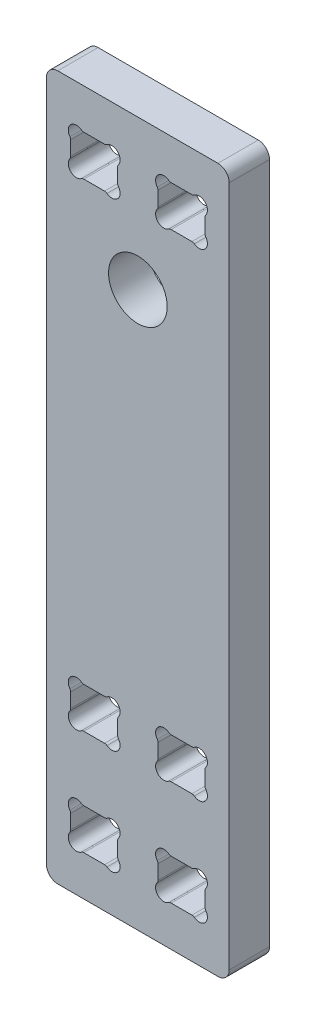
ISO-10303-21;
HEADER;
FILE_DESCRIPTION(('STEP AP214'),'2;1');
FILE_NAME('part.step','',(''),(''),'','','');
FILE_SCHEMA(('AUTOMOTIVE_DESIGN { 1 0 10303 214 1 1 1 1 }'));
ENDSEC;
DATA;
#1=APPLICATION_CONTEXT('core data for automotive mechanical design processes');
#2=APPLICATION_PROTOCOL_DEFINITION('international standard','automotive_design',2000,#1);
#3=PRODUCT_CONTEXT('',#1,'mechanical');
#4=PRODUCT('Part','Part','',(#3));
#5=PRODUCT_RELATED_PRODUCT_CATEGORY('part','',(#4));
#6=PRODUCT_DEFINITION_FORMATION('','',#4);
#7=PRODUCT_DEFINITION_CONTEXT('part definition',#1,'design');
#8=PRODUCT_DEFINITION('design','',#6,#7);
#9=PRODUCT_DEFINITION_SHAPE('','',#8);
#10=(LENGTH_UNIT() NAMED_UNIT(*) SI_UNIT(.MILLI.,.METRE.));
#11=(NAMED_UNIT(*) PLANE_ANGLE_UNIT() SI_UNIT($,.RADIAN.));
#12=(NAMED_UNIT(*) SI_UNIT($,.STERADIAN.) SOLID_ANGLE_UNIT());
#13=UNCERTAINTY_MEASURE_WITH_UNIT(LENGTH_MEASURE(1.E-05),#10,'distance_accuracy_value','');
#14=(GEOMETRIC_REPRESENTATION_CONTEXT(3) GLOBAL_UNCERTAINTY_ASSIGNED_CONTEXT((#13)) GLOBAL_UNIT_ASSIGNED_CONTEXT((#10,
#11,#12)) REPRESENTATION_CONTEXT('',''));
#15=CARTESIAN_POINT('',(0.,0.,0.));
#16=DIRECTION('',(0.,0.,1.));
#17=DIRECTION('',(1.,0.,0.));
#18=AXIS2_PLACEMENT_3D('',#15,#16,#17);
#19=CARTESIAN_POINT('',(56.6666666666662,125.60603170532,25.));
#20=DIRECTION('',(0.,0.,1.));
#21=DIRECTION('',(1.,0.,0.));
#22=AXIS2_PLACEMENT_3D('',#19,#20,#21);
#23=PLANE('',#22);
#24=CARTESIAN_POINT('',(56.6666666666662,125.60603170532,25.));
#25=DIRECTION('',(0.,0.,-1.));
#26=DIRECTION('',(1.,0.,0.));
#27=AXIS2_PLACEMENT_3D('',#24,#25,#26);
#28=CIRCLE('',#27,18.1776695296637);
#29=CARTESIAN_POINT('',(74.8443361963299,125.60603170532,25.));
#30=VERTEX_POINT('',#29);
#31=EDGE_CURVE('E1447',#30,#30,#28,.T.);
#32=ORIENTED_EDGE('',*,*,#31,.T.);
#33=EDGE_LOOP('',(#32));
#34=FACE_BOUND('',#33,.T.);
#35=DIRECTION('',(0.,-1.,0.));
#36=VECTOR('',#35,1.);
#37=CARTESIAN_POINT('',(0.,218.383701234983,25.));
#38=LINE('',#37,#36);
#39=CARTESIAN_POINT('',(0.,211.383701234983,25.));
#40=VERTEX_POINT('',#39);
#41=CARTESIAN_POINT('',(0.,-211.383701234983,25.));
#42=VERTEX_POINT('',#41);
#43=EDGE_CURVE('E1442',#40,#42,#38,.T.);
#44=ORIENTED_EDGE('',*,*,#43,.T.);
#45=CARTESIAN_POINT('',(7.00000000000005,-211.383701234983,25.));
#46=DIRECTION('',(0.,0.,1.));
#47=DIRECTION('',(1.,0.,0.));
#48=AXIS2_PLACEMENT_3D('',#45,#46,#47);
#49=CIRCLE('',#48,7.);
#50=CARTESIAN_POINT('',(7.00000000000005,-218.383701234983,25.));
#51=VERTEX_POINT('',#50);
#52=EDGE_CURVE('E41',#42,#51,#49,.T.);
#53=ORIENTED_EDGE('',*,*,#52,.T.);
#54=DIRECTION('',(1.,0.,0.));
#55=VECTOR('',#54,1.);
#56=CARTESIAN_POINT('',(0.,-218.383701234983,25.));
#57=LINE('',#56,#55);
#58=CARTESIAN_POINT('',(106.333333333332,-218.383701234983,25.));
#59=VERTEX_POINT('',#58);
#60=EDGE_CURVE('E1444',#51,#59,#57,.T.);
#61=ORIENTED_EDGE('',*,*,#60,.T.);
#62=CARTESIAN_POINT('',(106.333333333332,-211.383701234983,25.));
#63=DIRECTION('',(0.,0.,-1.));
#64=DIRECTION('',(-1.,0.,0.));
#65=AXIS2_PLACEMENT_3D('',#62,#63,#64);
#66=CIRCLE('',#65,7.);
#67=CARTESIAN_POINT('',(113.333333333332,-211.383701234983,25.));
#68=VERTEX_POINT('',#67);
#69=EDGE_CURVE('E1090',#68,#59,#66,.T.);
#70=ORIENTED_EDGE('',*,*,#69,.F.);
#71=DIRECTION('',(0.,-1.,0.));
#72=VECTOR('',#71,1.);
#73=CARTESIAN_POINT('',(113.333333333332,218.383701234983,25.));
#74=LINE('',#73,#72);
#75=CARTESIAN_POINT('',(113.333333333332,211.383701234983,25.));
#76=VERTEX_POINT('',#75);
#77=EDGE_CURVE('E1069',#76,#68,#74,.T.);
#78=ORIENTED_EDGE('',*,*,#77,.F.);
#79=CARTESIAN_POINT('',(106.333333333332,211.383701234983,25.));
#80=DIRECTION('',(0.,0.,-1.));
#81=DIRECTION('',(-1.,0.,0.));
#82=AXIS2_PLACEMENT_3D('',#79,#80,#81);
#83=CIRCLE('',#82,7.);
#84=CARTESIAN_POINT('',(106.333333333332,218.383701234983,25.));
#85=VERTEX_POINT('',#84);
#86=EDGE_CURVE('E1087',#85,#76,#83,.T.);
#87=ORIENTED_EDGE('',*,*,#86,.F.);
#88=DIRECTION('',(-1.,0.,0.));
#89=VECTOR('',#88,1.);
#90=CARTESIAN_POINT('',(56.6666666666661,218.383701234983,25.));
#91=LINE('',#90,#89);
#92=CARTESIAN_POINT('',(6.99999999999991,218.383701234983,25.));
#93=VERTEX_POINT('',#92);
#94=EDGE_CURVE('E1450',#85,#93,#91,.T.);
#95=ORIENTED_EDGE('',*,*,#94,.T.);
#96=CARTESIAN_POINT('',(6.99999999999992,211.383701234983,25.));
#97=DIRECTION('',(0.,0.,1.));
#98=DIRECTION('',(1.,0.,0.));
#99=AXIS2_PLACEMENT_3D('',#96,#97,#98);
#100=CIRCLE('',#99,7.);
#101=EDGE_CURVE('E1470',#93,#40,#100,.T.);
#102=ORIENTED_EDGE('',*,*,#101,.T.);
#103=EDGE_LOOP('',(#44,#53,#61,#70,#78,#87,#95,#102));
#104=FACE_BOUND('',#103,.T.);
#105=CARTESIAN_POINT('',(18.606244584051,-171.889945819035,25.));
#106=DIRECTION('',(0.,0.,1.));
#107=DIRECTION('',(1.,0.,0.));
#108=AXIS2_PLACEMENT_3D('',#105,#106,#107);
#109=CIRCLE('',#108,5.1);
#110=CARTESIAN_POINT('',(21.642620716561,-167.792334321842,25.));
#111=VERTEX_POINT('',#110);
#112=CARTESIAN_POINT('',(14.5086330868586,-174.926321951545,25.));
#113=VERTEX_POINT('',#112);
#114=EDGE_CURVE('E1329',#111,#113,#109,.T.);
#115=ORIENTED_EDGE('',*,*,#114,.F.);
#116=CARTESIAN_POINT('',(23.1310403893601,-165.783701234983,25.));
#117=DIRECTION('',(0.,0.,-1.));
#118=DIRECTION('',(1.,0.,0.));
#119=AXIS2_PLACEMENT_3D('',#116,#117,#118);
#120=CIRCLE('',#119,2.50000000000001);
#121=CARTESIAN_POINT('',(23.1310403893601,-168.283701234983,25.));
#122=VERTEX_POINT('',#121);
#123=EDGE_CURVE('E1327',#122,#111,#120,.T.);
#124=ORIENTED_EDGE('',*,*,#123,.F.);
#125=DIRECTION('',(-1.,0.,0.));
#126=VECTOR('',#125,1.);
#127=CARTESIAN_POINT('',(36.0356262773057,-168.283701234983,25.));
#128=LINE('',#127,#126);
#129=CARTESIAN_POINT('',(36.0356262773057,-168.283701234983,25.));
#130=VERTEX_POINT('',#129);
#131=EDGE_CURVE('E1359',#130,#122,#128,.T.);
#132=ORIENTED_EDGE('',*,*,#131,.F.);
#133=CARTESIAN_POINT('',(36.0356262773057,-165.783701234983,25.));
#134=DIRECTION('',(0.,0.,-1.));
#135=DIRECTION('',(-1.,0.,0.));
#136=AXIS2_PLACEMENT_3D('',#133,#134,#135);
#137=CIRCLE('',#136,2.50000000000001);
#138=CARTESIAN_POINT('',(37.5240459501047,-167.792334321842,25.));
#139=VERTEX_POINT('',#138);
#140=EDGE_CURVE('E1356',#139,#130,#137,.T.);
#141=ORIENTED_EDGE('',*,*,#140,.F.);
#142=CARTESIAN_POINT('',(40.5604220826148,-171.889945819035,25.));
#143=DIRECTION('',(0.,0.,1.));
#144=DIRECTION('',(-1.,0.,0.));
#145=AXIS2_PLACEMENT_3D('',#142,#143,#144);
#146=CIRCLE('',#145,5.1);
#147=CARTESIAN_POINT('',(44.6580335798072,-174.926321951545,25.));
#148=VERTEX_POINT('',#147);
#149=EDGE_CURVE('E1354',#148,#139,#146,.T.);
#150=ORIENTED_EDGE('',*,*,#149,.F.);
#151=CARTESIAN_POINT('',(46.6666666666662,-176.414741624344,25.));
#152=DIRECTION('',(0.,0.,-1.));
#153=DIRECTION('',(1.,0.,0.));
#154=AXIS2_PLACEMENT_3D('',#151,#152,#153);
#155=CIRCLE('',#154,2.50000000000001);
#156=CARTESIAN_POINT('',(44.1666666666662,-176.414741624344,25.));
#157=VERTEX_POINT('',#156);
#158=EDGE_CURVE('E1352',#157,#148,#155,.T.);
#159=ORIENTED_EDGE('',*,*,#158,.F.);
#160=DIRECTION('',(0.,1.,0.));
#161=VECTOR('',#160,1.);
#162=CARTESIAN_POINT('',(44.1666666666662,-176.414741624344,25.));
#163=LINE('',#162,#161);
#164=CARTESIAN_POINT('',(44.1666666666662,-185.352660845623,25.));
#165=VERTEX_POINT('',#164);
#166=EDGE_CURVE('E1350',#165,#157,#163,.T.);
#167=ORIENTED_EDGE('',*,*,#166,.F.);
#168=CARTESIAN_POINT('',(46.6666666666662,-185.352660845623,25.));
#169=DIRECTION('',(0.,0.,-1.));
#170=DIRECTION('',(-1.,0.,0.));
#171=AXIS2_PLACEMENT_3D('',#168,#169,#170);
#172=CIRCLE('',#171,2.50000000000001);
#173=CARTESIAN_POINT('',(44.6580335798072,-186.841080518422,25.));
#174=VERTEX_POINT('',#173);
#175=EDGE_CURVE('E1348',#174,#165,#172,.T.);
#176=ORIENTED_EDGE('',*,*,#175,.F.);
#177=CARTESIAN_POINT('',(40.5604220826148,-189.877456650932,25.));
#178=DIRECTION('',(0.,0.,1.));
#179=DIRECTION('',(1.,0.,0.));
#180=AXIS2_PLACEMENT_3D('',#177,#178,#179);
#181=CIRCLE('',#180,5.1);
#182=CARTESIAN_POINT('',(37.5240459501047,-193.975068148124,25.));
#183=VERTEX_POINT('',#182);
#184=EDGE_CURVE('E1346',#183,#174,#181,.T.);
#185=ORIENTED_EDGE('',*,*,#184,.F.);
#186=CARTESIAN_POINT('',(36.0356262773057,-195.983701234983,25.));
#187=DIRECTION('',(0.,0.,-1.));
#188=DIRECTION('',(1.,0.,0.));
#189=AXIS2_PLACEMENT_3D('',#186,#187,#188);
#190=CIRCLE('',#189,2.50000000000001);
#191=CARTESIAN_POINT('',(36.0356262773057,-193.483701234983,25.));
#192=VERTEX_POINT('',#191);
#193=EDGE_CURVE('E1344',#192,#183,#190,.T.);
#194=ORIENTED_EDGE('',*,*,#193,.F.);
#195=DIRECTION('',(1.,0.,0.));
#196=VECTOR('',#195,1.);
#197=CARTESIAN_POINT('',(36.0356262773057,-193.483701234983,25.));
#198=LINE('',#197,#196);
#199=CARTESIAN_POINT('',(23.1310403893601,-193.483701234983,25.));
#200=VERTEX_POINT('',#199);
#201=EDGE_CURVE('E1342',#200,#192,#198,.T.);
#202=ORIENTED_EDGE('',*,*,#201,.F.);
#203=CARTESIAN_POINT('',(23.1310403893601,-195.983701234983,25.));
#204=DIRECTION('',(0.,0.,-1.));
#205=DIRECTION('',(-1.,0.,0.));
#206=AXIS2_PLACEMENT_3D('',#203,#204,#205);
#207=CIRCLE('',#206,2.50000000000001);
#208=CARTESIAN_POINT('',(21.642620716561,-193.975068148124,25.));
#209=VERTEX_POINT('',#208);
#210=EDGE_CURVE('E1340',#209,#200,#207,.T.);
#211=ORIENTED_EDGE('',*,*,#210,.F.);
#212=CARTESIAN_POINT('',(18.606244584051,-189.877456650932,25.));
#213=DIRECTION('',(0.,0.,1.));
#214=DIRECTION('',(-1.,0.,0.));
#215=AXIS2_PLACEMENT_3D('',#212,#213,#214);
#216=CIRCLE('',#215,5.1);
#217=CARTESIAN_POINT('',(14.5086330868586,-186.841080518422,25.));
#218=VERTEX_POINT('',#217);
#219=EDGE_CURVE('E1338',#218,#209,#216,.T.);
#220=ORIENTED_EDGE('',*,*,#219,.F.);
#221=CARTESIAN_POINT('',(12.4999999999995,-185.352660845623,25.));
#222=DIRECTION('',(0.,0.,-1.));
#223=DIRECTION('',(1.,0.,0.));
#224=AXIS2_PLACEMENT_3D('',#221,#222,#223);
#225=CIRCLE('',#224,2.50000000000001);
#226=CARTESIAN_POINT('',(14.9999999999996,-185.352660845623,25.));
#227=VERTEX_POINT('',#226);
#228=EDGE_CURVE('E1336',#227,#218,#225,.T.);
#229=ORIENTED_EDGE('',*,*,#228,.F.);
#230=DIRECTION('',(0.,-1.,0.));
#231=VECTOR('',#230,1.);
#232=CARTESIAN_POINT('',(14.9999999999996,-176.414741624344,25.));
#233=LINE('',#232,#231);
#234=CARTESIAN_POINT('',(14.9999999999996,-176.414741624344,25.));
#235=VERTEX_POINT('',#234);
#236=EDGE_CURVE('E1334',#235,#227,#233,.T.);
#237=ORIENTED_EDGE('',*,*,#236,.F.);
#238=CARTESIAN_POINT('',(12.4999999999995,-176.414741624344,25.));
#239=DIRECTION('',(0.,0.,-1.));
#240=DIRECTION('',(-1.,0.,0.));
#241=AXIS2_PLACEMENT_3D('',#238,#239,#240);
#242=CIRCLE('',#241,2.50000000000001);
#243=EDGE_CURVE('E1332',#113,#235,#242,.T.);
#244=ORIENTED_EDGE('',*,*,#243,.F.);
#245=EDGE_LOOP('',(#115,#124,#132,#141,#150,#159,#167,#176,#185,#194,#202,#211,#220,#229,#237,#244));
#246=FACE_BOUND('',#245,.T.);
#247=CARTESIAN_POINT('',(36.0356262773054,195.983701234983,25.));
#248=DIRECTION('',(0.,0.,-1.));
#249=DIRECTION('',(-1.,0.,0.));
#250=AXIS2_PLACEMENT_3D('',#247,#248,#249);
#251=CIRCLE('',#250,2.50000000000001);
#252=CARTESIAN_POINT('',(37.5240459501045,193.975068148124,25.));
#253=VERTEX_POINT('',#252);
#254=CARTESIAN_POINT('',(36.0356262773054,193.483701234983,25.));
#255=VERTEX_POINT('',#254);
#256=EDGE_CURVE('E1214',#253,#255,#251,.T.);
#257=ORIENTED_EDGE('',*,*,#256,.F.);
#258=CARTESIAN_POINT('',(40.5604220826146,189.877456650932,25.));
#259=DIRECTION('',(0.,0.,1.));
#260=DIRECTION('',(-1.,0.,0.));
#261=AXIS2_PLACEMENT_3D('',#258,#259,#260);
#262=CIRCLE('',#261,5.1);
#263=CARTESIAN_POINT('',(44.658033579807,186.841080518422,25.));
#264=VERTEX_POINT('',#263);
#265=EDGE_CURVE('E1212',#264,#253,#262,.T.);
#266=ORIENTED_EDGE('',*,*,#265,.F.);
#267=CARTESIAN_POINT('',(46.666666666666,185.352660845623,25.));
#268=DIRECTION('',(0.,0.,-1.));
#269=DIRECTION('',(1.,0.,0.));
#270=AXIS2_PLACEMENT_3D('',#267,#268,#269);
#271=CIRCLE('',#270,2.5);
#272=CARTESIAN_POINT('',(44.166666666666,185.352660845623,25.));
#273=VERTEX_POINT('',#272);
#274=EDGE_CURVE('E1244',#273,#264,#271,.T.);
#275=ORIENTED_EDGE('',*,*,#274,.F.);
#276=DIRECTION('',(0.,1.,0.));
#277=VECTOR('',#276,1.);
#278=CARTESIAN_POINT('',(44.166666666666,176.414741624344,25.));
#279=LINE('',#278,#277);
#280=CARTESIAN_POINT('',(44.166666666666,176.414741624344,25.));
#281=VERTEX_POINT('',#280);
#282=EDGE_CURVE('E1241',#281,#273,#279,.T.);
#283=ORIENTED_EDGE('',*,*,#282,.F.);
#284=CARTESIAN_POINT('',(46.666666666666,176.414741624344,25.));
#285=DIRECTION('',(0.,0.,-1.));
#286=DIRECTION('',(-1.,0.,0.));
#287=AXIS2_PLACEMENT_3D('',#284,#285,#286);
#288=CIRCLE('',#287,2.50000000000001);
#289=CARTESIAN_POINT('',(44.658033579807,174.926321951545,25.));
#290=VERTEX_POINT('',#289);
#291=EDGE_CURVE('E1239',#290,#281,#288,.T.);
#292=ORIENTED_EDGE('',*,*,#291,.F.);
#293=CARTESIAN_POINT('',(40.5604220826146,171.889945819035,25.));
#294=DIRECTION('',(0.,0.,1.));
#295=DIRECTION('',(1.,0.,0.));
#296=AXIS2_PLACEMENT_3D('',#293,#294,#295);
#297=CIRCLE('',#296,5.1);
#298=CARTESIAN_POINT('',(37.5240459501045,167.792334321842,25.));
#299=VERTEX_POINT('',#298);
#300=EDGE_CURVE('E1237',#299,#290,#297,.T.);
#301=ORIENTED_EDGE('',*,*,#300,.F.);
#302=CARTESIAN_POINT('',(36.0356262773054,165.783701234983,25.));
#303=DIRECTION('',(0.,0.,-1.));
#304=DIRECTION('',(1.,0.,0.));
#305=AXIS2_PLACEMENT_3D('',#302,#303,#304);
#306=CIRCLE('',#305,2.50000000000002);
#307=CARTESIAN_POINT('',(36.0356262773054,168.283701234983,25.));
#308=VERTEX_POINT('',#307);
#309=EDGE_CURVE('E1235',#308,#299,#306,.T.);
#310=ORIENTED_EDGE('',*,*,#309,.F.);
#311=DIRECTION('',(1.,0.,0.));
#312=VECTOR('',#311,1.);
#313=CARTESIAN_POINT('',(36.0356262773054,168.283701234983,25.));
#314=LINE('',#313,#312);
#315=CARTESIAN_POINT('',(23.1310403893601,168.283701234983,25.));
#316=VERTEX_POINT('',#315);
#317=EDGE_CURVE('E1233',#316,#308,#314,.T.);
#318=ORIENTED_EDGE('',*,*,#317,.F.);
#319=CARTESIAN_POINT('',(23.1310403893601,165.783701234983,25.));
#320=DIRECTION('',(0.,0.,-1.));
#321=DIRECTION('',(-1.,0.,0.));
#322=AXIS2_PLACEMENT_3D('',#319,#320,#321);
#323=CIRCLE('',#322,2.50000000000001);
#324=CARTESIAN_POINT('',(21.642620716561,167.792334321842,25.));
#325=VERTEX_POINT('',#324);
#326=EDGE_CURVE('E1231',#325,#316,#323,.T.);
#327=ORIENTED_EDGE('',*,*,#326,.F.);
#328=CARTESIAN_POINT('',(18.606244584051,171.889945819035,25.));
#329=DIRECTION('',(0.,0.,1.));
#330=DIRECTION('',(-1.,0.,0.));
#331=AXIS2_PLACEMENT_3D('',#328,#329,#330);
#332=CIRCLE('',#331,5.1);
#333=CARTESIAN_POINT('',(14.5086330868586,174.926321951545,25.));
#334=VERTEX_POINT('',#333);
#335=EDGE_CURVE('E1229',#334,#325,#332,.T.);
#336=ORIENTED_EDGE('',*,*,#335,.F.);
#337=CARTESIAN_POINT('',(12.4999999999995,176.414741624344,25.));
#338=DIRECTION('',(0.,0.,-1.));
#339=DIRECTION('',(1.,0.,0.));
#340=AXIS2_PLACEMENT_3D('',#337,#338,#339);
#341=CIRCLE('',#340,2.50000000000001);
#342=CARTESIAN_POINT('',(14.9999999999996,176.414741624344,25.));
#343=VERTEX_POINT('',#342);
#344=EDGE_CURVE('E1227',#343,#334,#341,.T.);
#345=ORIENTED_EDGE('',*,*,#344,.F.);
#346=DIRECTION('',(0.,-1.,0.));
#347=VECTOR('',#346,1.);
#348=CARTESIAN_POINT('',(14.9999999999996,176.414741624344,25.));
#349=LINE('',#348,#347);
#350=CARTESIAN_POINT('',(14.9999999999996,185.352660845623,25.));
#351=VERTEX_POINT('',#350);
#352=EDGE_CURVE('E1225',#351,#343,#349,.T.);
#353=ORIENTED_EDGE('',*,*,#352,.F.);
#354=CARTESIAN_POINT('',(12.4999999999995,185.352660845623,25.));
#355=DIRECTION('',(0.,0.,-1.));
#356=DIRECTION('',(-1.,0.,0.));
#357=AXIS2_PLACEMENT_3D('',#354,#355,#356);
#358=CIRCLE('',#357,2.50000000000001);
#359=CARTESIAN_POINT('',(14.5086330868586,186.841080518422,25.));
#360=VERTEX_POINT('',#359);
#361=EDGE_CURVE('E1223',#360,#351,#358,.T.);
#362=ORIENTED_EDGE('',*,*,#361,.F.);
#363=CARTESIAN_POINT('',(18.606244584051,189.877456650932,25.));
#364=DIRECTION('',(0.,0.,1.));
#365=DIRECTION('',(1.,0.,0.));
#366=AXIS2_PLACEMENT_3D('',#363,#364,#365);
#367=CIRCLE('',#366,5.1);
#368=CARTESIAN_POINT('',(21.642620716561,193.975068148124,25.));
#369=VERTEX_POINT('',#368);
#370=EDGE_CURVE('E1221',#369,#360,#367,.T.);
#371=ORIENTED_EDGE('',*,*,#370,.F.);
#372=CARTESIAN_POINT('',(23.1310403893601,195.983701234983,25.));
#373=DIRECTION('',(0.,0.,-1.));
#374=DIRECTION('',(1.,0.,0.));
#375=AXIS2_PLACEMENT_3D('',#372,#373,#374);
#376=CIRCLE('',#375,2.50000000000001);
#377=CARTESIAN_POINT('',(23.1310403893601,193.483701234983,25.));
#378=VERTEX_POINT('',#377);
#379=EDGE_CURVE('E1219',#378,#369,#376,.T.);
#380=ORIENTED_EDGE('',*,*,#379,.F.);
#381=DIRECTION('',(-1.,0.,0.));
#382=VECTOR('',#381,1.);
#383=CARTESIAN_POINT('',(36.0356262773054,193.483701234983,25.));
#384=LINE('',#383,#382);
#385=EDGE_CURVE('E1217',#255,#378,#384,.T.);
#386=ORIENTED_EDGE('',*,*,#385,.F.);
#387=EDGE_LOOP('',(#257,#266,#275,#283,#292,#301,#310,#318,#327,#336,#345,#353,#362,#371,#380,#386));
#388=FACE_BOUND('',#387,.T.);
#389=CARTESIAN_POINT('',(46.6666666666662,-120.152660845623,25.));
#390=DIRECTION('',(0.,0.,-1.));
#391=DIRECTION('',(-1.,0.,0.));
#392=AXIS2_PLACEMENT_3D('',#389,#390,#391);
#393=CIRCLE('',#392,2.50000000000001);
#394=CARTESIAN_POINT('',(44.6580335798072,-121.641080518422,25.));
#395=VERTEX_POINT('',#394);
#396=CARTESIAN_POINT('',(44.1666666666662,-120.152660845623,25.));
#397=VERTEX_POINT('',#396);
#398=EDGE_CURVE('E1099',#395,#397,#393,.T.);
#399=ORIENTED_EDGE('',*,*,#398,.F.);
#400=CARTESIAN_POINT('',(40.5604220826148,-124.677456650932,25.));
#401=DIRECTION('',(0.,0.,1.));
#402=DIRECTION('',(1.,0.,0.));
#403=AXIS2_PLACEMENT_3D('',#400,#401,#402);
#404=CIRCLE('',#403,5.1);
#405=CARTESIAN_POINT('',(37.5240459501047,-128.775068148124,25.));
#406=VERTEX_POINT('',#405);
#407=EDGE_CURVE('E1097',#406,#395,#404,.T.);
#408=ORIENTED_EDGE('',*,*,#407,.F.);
#409=CARTESIAN_POINT('',(36.0356262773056,-130.783701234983,25.));
#410=DIRECTION('',(0.,0.,-1.));
#411=DIRECTION('',(1.,0.,0.));
#412=AXIS2_PLACEMENT_3D('',#409,#410,#411);
#413=CIRCLE('',#412,2.50000000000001);
#414=CARTESIAN_POINT('',(36.0356262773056,-128.283701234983,25.));
#415=VERTEX_POINT('',#414);
#416=EDGE_CURVE('E1129',#415,#406,#413,.T.);
#417=ORIENTED_EDGE('',*,*,#416,.F.);
#418=DIRECTION('',(1.,0.,0.));
#419=VECTOR('',#418,1.);
#420=CARTESIAN_POINT('',(36.0356262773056,-128.283701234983,25.));
#421=LINE('',#420,#419);
#422=CARTESIAN_POINT('',(23.1310403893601,-128.283701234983,25.));
#423=VERTEX_POINT('',#422);
#424=EDGE_CURVE('E1126',#423,#415,#421,.T.);
#425=ORIENTED_EDGE('',*,*,#424,.F.);
#426=CARTESIAN_POINT('',(23.1310403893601,-130.783701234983,25.));
#427=DIRECTION('',(0.,0.,-1.));
#428=DIRECTION('',(-1.,0.,0.));
#429=AXIS2_PLACEMENT_3D('',#426,#427,#428);
#430=CIRCLE('',#429,2.50000000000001);
#431=CARTESIAN_POINT('',(21.642620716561,-128.775068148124,25.));
#432=VERTEX_POINT('',#431);
#433=EDGE_CURVE('E1124',#432,#423,#430,.T.);
#434=ORIENTED_EDGE('',*,*,#433,.F.);
#435=CARTESIAN_POINT('',(18.606244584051,-124.677456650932,25.));
#436=DIRECTION('',(0.,0.,1.));
#437=DIRECTION('',(-1.,0.,0.));
#438=AXIS2_PLACEMENT_3D('',#435,#436,#437);
#439=CIRCLE('',#438,5.1);
#440=CARTESIAN_POINT('',(14.5086330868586,-121.641080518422,25.));
#441=VERTEX_POINT('',#440);
#442=EDGE_CURVE('E1122',#441,#432,#439,.T.);
#443=ORIENTED_EDGE('',*,*,#442,.F.);
#444=CARTESIAN_POINT('',(12.4999999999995,-120.152660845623,25.));
#445=DIRECTION('',(0.,0.,-1.));
#446=DIRECTION('',(1.,0.,0.));
#447=AXIS2_PLACEMENT_3D('',#444,#445,#446);
#448=CIRCLE('',#447,2.50000000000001);
#449=CARTESIAN_POINT('',(14.9999999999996,-120.152660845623,25.));
#450=VERTEX_POINT('',#449);
#451=EDGE_CURVE('E1120',#450,#441,#448,.T.);
#452=ORIENTED_EDGE('',*,*,#451,.F.);
#453=DIRECTION('',(0.,-1.,0.));
#454=VECTOR('',#453,1.);
#455=CARTESIAN_POINT('',(14.9999999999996,-120.152660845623,25.));
#456=LINE('',#455,#454);
#457=CARTESIAN_POINT('',(14.9999999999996,-111.214741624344,25.));
#458=VERTEX_POINT('',#457);
#459=EDGE_CURVE('E1118',#458,#450,#456,.T.);
#460=ORIENTED_EDGE('',*,*,#459,.F.);
#461=CARTESIAN_POINT('',(12.4999999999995,-111.214741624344,25.));
#462=DIRECTION('',(0.,0.,-1.));
#463=DIRECTION('',(-1.,0.,0.));
#464=AXIS2_PLACEMENT_3D('',#461,#462,#463);
#465=CIRCLE('',#464,2.50000000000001);
#466=CARTESIAN_POINT('',(14.5086330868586,-109.726321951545,25.));
#467=VERTEX_POINT('',#466);
#468=EDGE_CURVE('E1116',#467,#458,#465,.T.);
#469=ORIENTED_EDGE('',*,*,#468,.F.);
#470=CARTESIAN_POINT('',(18.606244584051,-106.689945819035,25.));
#471=DIRECTION('',(0.,0.,1.));
#472=DIRECTION('',(1.,0.,0.));
#473=AXIS2_PLACEMENT_3D('',#470,#471,#472);
#474=CIRCLE('',#473,5.1);
#475=CARTESIAN_POINT('',(21.642620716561,-102.592334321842,25.));
#476=VERTEX_POINT('',#475);
#477=EDGE_CURVE('E1114',#476,#467,#474,.T.);
#478=ORIENTED_EDGE('',*,*,#477,.F.);
#479=CARTESIAN_POINT('',(23.1310403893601,-100.583701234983,25.));
#480=DIRECTION('',(0.,0.,-1.));
#481=DIRECTION('',(1.,0.,0.));
#482=AXIS2_PLACEMENT_3D('',#479,#480,#481);
#483=CIRCLE('',#482,2.50000000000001);
#484=CARTESIAN_POINT('',(23.1310403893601,-103.083701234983,25.));
#485=VERTEX_POINT('',#484);
#486=EDGE_CURVE('E1112',#485,#476,#483,.T.);
#487=ORIENTED_EDGE('',*,*,#486,.F.);
#488=DIRECTION('',(-1.,0.,0.));
#489=VECTOR('',#488,1.);
#490=CARTESIAN_POINT('',(36.0356262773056,-103.083701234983,25.));
#491=LINE('',#490,#489);
#492=CARTESIAN_POINT('',(36.0356262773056,-103.083701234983,25.));
#493=VERTEX_POINT('',#492);
#494=EDGE_CURVE('E1110',#493,#485,#491,.T.);
#495=ORIENTED_EDGE('',*,*,#494,.F.);
#496=CARTESIAN_POINT('',(36.0356262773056,-100.583701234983,25.));
#497=DIRECTION('',(0.,0.,-1.));
#498=DIRECTION('',(-1.,0.,0.));
#499=AXIS2_PLACEMENT_3D('',#496,#497,#498);
#500=CIRCLE('',#499,2.50000000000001);
#501=CARTESIAN_POINT('',(37.5240459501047,-102.592334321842,25.));
#502=VERTEX_POINT('',#501);
#503=EDGE_CURVE('E1108',#502,#493,#500,.T.);
#504=ORIENTED_EDGE('',*,*,#503,.F.);
#505=CARTESIAN_POINT('',(40.5604220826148,-106.689945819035,25.));
#506=DIRECTION('',(0.,0.,1.));
#507=DIRECTION('',(-1.,0.,0.));
#508=AXIS2_PLACEMENT_3D('',#505,#506,#507);
#509=CIRCLE('',#508,5.1);
#510=CARTESIAN_POINT('',(44.6580335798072,-109.726321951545,25.));
#511=VERTEX_POINT('',#510);
#512=EDGE_CURVE('E1106',#511,#502,#509,.T.);
#513=ORIENTED_EDGE('',*,*,#512,.F.);
#514=CARTESIAN_POINT('',(46.6666666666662,-111.214741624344,25.));
#515=DIRECTION('',(0.,0.,-1.));
#516=DIRECTION('',(1.,0.,0.));
#517=AXIS2_PLACEMENT_3D('',#514,#515,#516);
#518=CIRCLE('',#517,2.5);
#519=CARTESIAN_POINT('',(44.1666666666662,-111.214741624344,25.));
#520=VERTEX_POINT('',#519);
#521=EDGE_CURVE('E1104',#520,#511,#518,.T.);
#522=ORIENTED_EDGE('',*,*,#521,.F.);
#523=DIRECTION('',(0.,1.,0.));
#524=VECTOR('',#523,1.);
#525=CARTESIAN_POINT('',(44.1666666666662,-120.152660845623,25.));
#526=LINE('',#525,#524);
#527=EDGE_CURVE('E1102',#397,#520,#526,.T.);
#528=ORIENTED_EDGE('',*,*,#527,.F.);
#529=EDGE_LOOP('',(#399,#408,#417,#425,#434,#443,#452,#460,#469,#478,#487,#495,#504,#513,#522,#528));
#530=FACE_BOUND('',#529,.T.);
#531=CARTESIAN_POINT('',(94.7270887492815,-171.889945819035,25.));
#532=DIRECTION('',(0.,0.,-1.));
#533=DIRECTION('',(-1.,0.,0.));
#534=AXIS2_PLACEMENT_3D('',#531,#532,#533);
#535=CIRCLE('',#534,5.1);
#536=CARTESIAN_POINT('',(91.6907126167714,-167.792334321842,25.));
#537=VERTEX_POINT('',#536);
#538=CARTESIAN_POINT('',(98.8247002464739,-174.926321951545,25.));
#539=VERTEX_POINT('',#538);
#540=EDGE_CURVE('E944',#537,#539,#535,.T.);
#541=ORIENTED_EDGE('',*,*,#540,.T.);
#542=CARTESIAN_POINT('',(100.833333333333,-176.414741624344,25.));
#543=DIRECTION('',(0.,0.,1.));
#544=DIRECTION('',(1.,0.,0.));
#545=AXIS2_PLACEMENT_3D('',#542,#543,#544);
#546=CIRCLE('',#545,2.50000000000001);
#547=CARTESIAN_POINT('',(98.3333333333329,-176.414741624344,25.));
#548=VERTEX_POINT('',#547);
#549=EDGE_CURVE('E948',#539,#548,#546,.T.);
#550=ORIENTED_EDGE('',*,*,#549,.T.);
#551=DIRECTION('',(0.,-1.,0.));
#552=VECTOR('',#551,1.);
#553=CARTESIAN_POINT('',(98.3333333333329,-176.414741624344,25.));
#554=LINE('',#553,#552);
#555=CARTESIAN_POINT('',(98.3333333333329,-185.352660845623,25.));
#556=VERTEX_POINT('',#555);
#557=EDGE_CURVE('E951',#548,#556,#554,.T.);
#558=ORIENTED_EDGE('',*,*,#557,.T.);
#559=CARTESIAN_POINT('',(100.833333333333,-185.352660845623,25.));
#560=DIRECTION('',(0.,0.,1.));
#561=DIRECTION('',(-1.,0.,0.));
#562=AXIS2_PLACEMENT_3D('',#559,#560,#561);
#563=CIRCLE('',#562,2.50000000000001);
#564=CARTESIAN_POINT('',(98.8247002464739,-186.841080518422,25.));
#565=VERTEX_POINT('',#564);
#566=EDGE_CURVE('E954',#556,#565,#563,.T.);
#567=ORIENTED_EDGE('',*,*,#566,.T.);
#568=CARTESIAN_POINT('',(94.7270887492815,-189.877456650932,25.));
#569=DIRECTION('',(0.,0.,-1.));
#570=DIRECTION('',(1.,0.,0.));
#571=AXIS2_PLACEMENT_3D('',#568,#569,#570);
#572=CIRCLE('',#571,5.1);
#573=CARTESIAN_POINT('',(91.6907126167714,-193.975068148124,25.));
#574=VERTEX_POINT('',#573);
#575=EDGE_CURVE('E957',#565,#574,#572,.T.);
#576=ORIENTED_EDGE('',*,*,#575,.T.);
#577=CARTESIAN_POINT('',(90.2022929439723,-195.983701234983,25.));
#578=DIRECTION('',(0.,0.,1.));
#579=DIRECTION('',(1.,0.,0.));
#580=AXIS2_PLACEMENT_3D('',#577,#578,#579);
#581=CIRCLE('',#580,2.50000000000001);
#582=CARTESIAN_POINT('',(90.2022929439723,-193.483701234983,25.));
#583=VERTEX_POINT('',#582);
#584=EDGE_CURVE('E960',#574,#583,#581,.T.);
#585=ORIENTED_EDGE('',*,*,#584,.T.);
#586=DIRECTION('',(-1.,0.,0.));
#587=VECTOR('',#586,1.);
#588=CARTESIAN_POINT('',(77.2977070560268,-193.483701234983,25.));
#589=LINE('',#588,#587);
#590=CARTESIAN_POINT('',(77.2977070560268,-193.483701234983,25.));
#591=VERTEX_POINT('',#590);
#592=EDGE_CURVE('E963',#583,#591,#589,.T.);
#593=ORIENTED_EDGE('',*,*,#592,.T.);
#594=CARTESIAN_POINT('',(77.2977070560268,-195.983701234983,25.));
#595=DIRECTION('',(0.,0.,1.));
#596=DIRECTION('',(-1.,0.,0.));
#597=AXIS2_PLACEMENT_3D('',#594,#595,#596);
#598=CIRCLE('',#597,2.50000000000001);
#599=CARTESIAN_POINT('',(75.8092873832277,-193.975068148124,25.));
#600=VERTEX_POINT('',#599);
#601=EDGE_CURVE('E966',#591,#600,#598,.T.);
#602=ORIENTED_EDGE('',*,*,#601,.T.);
#603=CARTESIAN_POINT('',(72.7729112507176,-189.877456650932,25.));
#604=DIRECTION('',(0.,0.,-1.));
#605=DIRECTION('',(-1.,0.,0.));
#606=AXIS2_PLACEMENT_3D('',#603,#604,#605);
#607=CIRCLE('',#606,5.1);
#608=CARTESIAN_POINT('',(68.6752997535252,-186.841080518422,25.));
#609=VERTEX_POINT('',#608);
#610=EDGE_CURVE('E969',#600,#609,#607,.T.);
#611=ORIENTED_EDGE('',*,*,#610,.T.);
#612=CARTESIAN_POINT('',(66.6666666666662,-185.352660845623,25.));
#613=DIRECTION('',(0.,0.,1.));
#614=DIRECTION('',(1.,0.,0.));
#615=AXIS2_PLACEMENT_3D('',#612,#613,#614);
#616=CIRCLE('',#615,2.50000000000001);
#617=CARTESIAN_POINT('',(69.1666666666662,-185.352660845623,25.));
#618=VERTEX_POINT('',#617);
#619=EDGE_CURVE('E972',#609,#618,#616,.T.);
#620=ORIENTED_EDGE('',*,*,#619,.T.);
#621=DIRECTION('',(0.,1.,0.));
#622=VECTOR('',#621,1.);
#623=CARTESIAN_POINT('',(69.1666666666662,-176.414741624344,25.));
#624=LINE('',#623,#622);
#625=CARTESIAN_POINT('',(69.1666666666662,-176.414741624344,25.));
#626=VERTEX_POINT('',#625);
#627=EDGE_CURVE('E975',#618,#626,#624,.T.);
#628=ORIENTED_EDGE('',*,*,#627,.T.);
#629=CARTESIAN_POINT('',(66.6666666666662,-176.414741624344,25.));
#630=DIRECTION('',(0.,0.,1.));
#631=DIRECTION('',(-1.,0.,0.));
#632=AXIS2_PLACEMENT_3D('',#629,#630,#631);
#633=CIRCLE('',#632,2.50000000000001);
#634=CARTESIAN_POINT('',(68.6752997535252,-174.926321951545,25.));
#635=VERTEX_POINT('',#634);
#636=EDGE_CURVE('E978',#626,#635,#633,.T.);
#637=ORIENTED_EDGE('',*,*,#636,.T.);
#638=CARTESIAN_POINT('',(72.7729112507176,-171.889945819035,25.));
#639=DIRECTION('',(0.,0.,-1.));
#640=DIRECTION('',(1.,0.,0.));
#641=AXIS2_PLACEMENT_3D('',#638,#639,#640);
#642=CIRCLE('',#641,5.1);
#643=CARTESIAN_POINT('',(75.8092873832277,-167.792334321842,25.));
#644=VERTEX_POINT('',#643);
#645=EDGE_CURVE('E981',#635,#644,#642,.T.);
#646=ORIENTED_EDGE('',*,*,#645,.T.);
#647=CARTESIAN_POINT('',(77.2977070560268,-165.783701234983,25.));
#648=DIRECTION('',(0.,0.,1.));
#649=DIRECTION('',(1.,0.,0.));
#650=AXIS2_PLACEMENT_3D('',#647,#648,#649);
#651=CIRCLE('',#650,2.50000000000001);
#652=CARTESIAN_POINT('',(77.2977070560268,-168.283701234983,25.));
#653=VERTEX_POINT('',#652);
#654=EDGE_CURVE('E984',#644,#653,#651,.T.);
#655=ORIENTED_EDGE('',*,*,#654,.T.);
#656=DIRECTION('',(1.,0.,0.));
#657=VECTOR('',#656,1.);
#658=CARTESIAN_POINT('',(77.2977070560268,-168.283701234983,25.));
#659=LINE('',#658,#657);
#660=CARTESIAN_POINT('',(90.2022929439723,-168.283701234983,25.));
#661=VERTEX_POINT('',#660);
#662=EDGE_CURVE('E987',#653,#661,#659,.T.);
#663=ORIENTED_EDGE('',*,*,#662,.T.);
#664=CARTESIAN_POINT('',(90.2022929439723,-165.783701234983,25.));
#665=DIRECTION('',(0.,0.,1.));
#666=DIRECTION('',(-1.,0.,0.));
#667=AXIS2_PLACEMENT_3D('',#664,#665,#666);
#668=CIRCLE('',#667,2.50000000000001);
#669=EDGE_CURVE('E941',#661,#537,#668,.T.);
#670=ORIENTED_EDGE('',*,*,#669,.T.);
#671=EDGE_LOOP('',(#541,#550,#558,#567,#576,#585,#593,#602,#611,#620,#628,#637,#646,#655,#663,#670));
#672=FACE_BOUND('',#671,.T.);
#673=CARTESIAN_POINT('',(77.2977070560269,195.983701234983,25.));
#674=DIRECTION('',(0.,0.,1.));
#675=DIRECTION('',(1.,0.,0.));
#676=AXIS2_PLACEMENT_3D('',#673,#674,#675);
#677=CIRCLE('',#676,2.50000000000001);
#678=CARTESIAN_POINT('',(75.8092873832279,193.975068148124,25.));
#679=VERTEX_POINT('',#678);
#680=CARTESIAN_POINT('',(77.2977070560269,193.483701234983,25.));
#681=VERTEX_POINT('',#680);
#682=EDGE_CURVE('E816',#679,#681,#677,.T.);
#683=ORIENTED_EDGE('',*,*,#682,.T.);
#684=DIRECTION('',(1.,0.,0.));
#685=VECTOR('',#684,1.);
#686=CARTESIAN_POINT('',(77.2977070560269,193.483701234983,25.));
#687=LINE('',#686,#685);
#688=CARTESIAN_POINT('',(90.2022929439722,193.483701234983,25.));
#689=VERTEX_POINT('',#688);
#690=EDGE_CURVE('E820',#681,#689,#687,.T.);
#691=ORIENTED_EDGE('',*,*,#690,.T.);
#692=CARTESIAN_POINT('',(90.2022929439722,195.983701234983,25.));
#693=DIRECTION('',(0.,0.,1.));
#694=DIRECTION('',(-1.,0.,0.));
#695=AXIS2_PLACEMENT_3D('',#692,#693,#694);
#696=CIRCLE('',#695,2.50000000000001);
#697=CARTESIAN_POINT('',(91.6907126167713,193.975068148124,25.));
#698=VERTEX_POINT('',#697);
#699=EDGE_CURVE('E823',#689,#698,#696,.T.);
#700=ORIENTED_EDGE('',*,*,#699,.T.);
#701=CARTESIAN_POINT('',(94.7270887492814,189.877456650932,25.));
#702=DIRECTION('',(0.,0.,-1.));
#703=DIRECTION('',(-1.,0.,0.));
#704=AXIS2_PLACEMENT_3D('',#701,#702,#703);
#705=CIRCLE('',#704,5.1);
#706=CARTESIAN_POINT('',(98.8247002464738,186.841080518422,25.));
#707=VERTEX_POINT('',#706);
#708=EDGE_CURVE('E826',#698,#707,#705,.T.);
#709=ORIENTED_EDGE('',*,*,#708,.T.);
#710=CARTESIAN_POINT('',(100.833333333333,185.352660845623,25.));
#711=DIRECTION('',(0.,0.,1.));
#712=DIRECTION('',(1.,0.,0.));
#713=AXIS2_PLACEMENT_3D('',#710,#711,#712);
#714=CIRCLE('',#713,2.50000000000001);
#715=CARTESIAN_POINT('',(98.3333333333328,185.352660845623,25.));
#716=VERTEX_POINT('',#715);
#717=EDGE_CURVE('E829',#707,#716,#714,.T.);
#718=ORIENTED_EDGE('',*,*,#717,.T.);
#719=DIRECTION('',(0.,-1.,0.));
#720=VECTOR('',#719,1.);
#721=CARTESIAN_POINT('',(98.3333333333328,176.414741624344,25.));
#722=LINE('',#721,#720);
#723=CARTESIAN_POINT('',(98.3333333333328,176.414741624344,25.));
#724=VERTEX_POINT('',#723);
#725=EDGE_CURVE('E832',#716,#724,#722,.T.);
#726=ORIENTED_EDGE('',*,*,#725,.T.);
#727=CARTESIAN_POINT('',(100.833333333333,176.414741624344,25.));
#728=DIRECTION('',(0.,0.,1.));
#729=DIRECTION('',(-1.,0.,0.));
#730=AXIS2_PLACEMENT_3D('',#727,#728,#729);
#731=CIRCLE('',#730,2.50000000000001);
#732=CARTESIAN_POINT('',(98.8247002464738,174.926321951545,25.));
#733=VERTEX_POINT('',#732);
#734=EDGE_CURVE('E835',#724,#733,#731,.T.);
#735=ORIENTED_EDGE('',*,*,#734,.T.);
#736=CARTESIAN_POINT('',(94.7270887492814,171.889945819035,25.));
#737=DIRECTION('',(0.,0.,-1.));
#738=DIRECTION('',(1.,0.,0.));
#739=AXIS2_PLACEMENT_3D('',#736,#737,#738);
#740=CIRCLE('',#739,5.1);
#741=CARTESIAN_POINT('',(91.6907126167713,167.792334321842,25.));
#742=VERTEX_POINT('',#741);
#743=EDGE_CURVE('E838',#733,#742,#740,.T.);
#744=ORIENTED_EDGE('',*,*,#743,.T.);
#745=CARTESIAN_POINT('',(90.2022929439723,165.783701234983,25.));
#746=DIRECTION('',(0.,0.,1.));
#747=DIRECTION('',(1.,0.,0.));
#748=AXIS2_PLACEMENT_3D('',#745,#746,#747);
#749=CIRCLE('',#748,2.50000000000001);
#750=CARTESIAN_POINT('',(90.2022929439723,168.283701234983,25.));
#751=VERTEX_POINT('',#750);
#752=EDGE_CURVE('E841',#742,#751,#749,.T.);
#753=ORIENTED_EDGE('',*,*,#752,.T.);
#754=DIRECTION('',(-1.,0.,0.));
#755=VECTOR('',#754,1.);
#756=CARTESIAN_POINT('',(77.2977070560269,168.283701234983,25.));
#757=LINE('',#756,#755);
#758=CARTESIAN_POINT('',(77.2977070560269,168.283701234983,25.));
#759=VERTEX_POINT('',#758);
#760=EDGE_CURVE('E844',#751,#759,#757,.T.);
#761=ORIENTED_EDGE('',*,*,#760,.T.);
#762=CARTESIAN_POINT('',(77.2977070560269,165.783701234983,25.));
#763=DIRECTION('',(0.,0.,1.));
#764=DIRECTION('',(-1.,0.,0.));
#765=AXIS2_PLACEMENT_3D('',#762,#763,#764);
#766=CIRCLE('',#765,2.50000000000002);
#767=CARTESIAN_POINT('',(75.8092873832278,167.792334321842,25.));
#768=VERTEX_POINT('',#767);
#769=EDGE_CURVE('E847',#759,#768,#766,.T.);
#770=ORIENTED_EDGE('',*,*,#769,.T.);
#771=CARTESIAN_POINT('',(72.7729112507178,171.889945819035,25.));
#772=DIRECTION('',(0.,0.,-1.));
#773=DIRECTION('',(-1.,0.,0.));
#774=AXIS2_PLACEMENT_3D('',#771,#772,#773);
#775=CIRCLE('',#774,5.1);
#776=CARTESIAN_POINT('',(68.6752997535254,174.926321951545,25.));
#777=VERTEX_POINT('',#776);
#778=EDGE_CURVE('E850',#768,#777,#775,.T.);
#779=ORIENTED_EDGE('',*,*,#778,.T.);
#780=CARTESIAN_POINT('',(66.6666666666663,176.414741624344,25.));
#781=DIRECTION('',(0.,0.,1.));
#782=DIRECTION('',(1.,0.,0.));
#783=AXIS2_PLACEMENT_3D('',#780,#781,#782);
#784=CIRCLE('',#783,2.50000000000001);
#785=CARTESIAN_POINT('',(69.1666666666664,176.414741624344,25.));
#786=VERTEX_POINT('',#785);
#787=EDGE_CURVE('E853',#777,#786,#784,.T.);
#788=ORIENTED_EDGE('',*,*,#787,.T.);
#789=DIRECTION('',(0.,1.,0.));
#790=VECTOR('',#789,1.);
#791=CARTESIAN_POINT('',(69.1666666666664,176.414741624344,25.));
#792=LINE('',#791,#790);
#793=CARTESIAN_POINT('',(69.1666666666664,185.352660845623,25.));
#794=VERTEX_POINT('',#793);
#795=EDGE_CURVE('E856',#786,#794,#792,.T.);
#796=ORIENTED_EDGE('',*,*,#795,.T.);
#797=CARTESIAN_POINT('',(66.6666666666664,185.352660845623,25.));
#798=DIRECTION('',(0.,0.,1.));
#799=DIRECTION('',(-1.,0.,0.));
#800=AXIS2_PLACEMENT_3D('',#797,#798,#799);
#801=CIRCLE('',#800,2.5);
#802=CARTESIAN_POINT('',(68.6752997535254,186.841080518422,25.));
#803=VERTEX_POINT('',#802);
#804=EDGE_CURVE('E859',#794,#803,#801,.T.);
#805=ORIENTED_EDGE('',*,*,#804,.T.);
#806=CARTESIAN_POINT('',(72.7729112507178,189.877456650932,25.));
#807=DIRECTION('',(0.,0.,-1.));
#808=DIRECTION('',(1.,0.,0.));
#809=AXIS2_PLACEMENT_3D('',#806,#807,#808);
#810=CIRCLE('',#809,5.1);
#811=EDGE_CURVE('E813',#803,#679,#810,.T.);
#812=ORIENTED_EDGE('',*,*,#811,.T.);
#813=EDGE_LOOP('',(#683,#691,#700,#709,#718,#726,#735,#744,#753,#761,#770,#779,#788,#796,#805,#812));
#814=FACE_BOUND('',#813,.T.);
#815=CARTESIAN_POINT('',(66.6666666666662,-120.152660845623,25.));
#816=DIRECTION('',(0.,0.,1.));
#817=DIRECTION('',(1.,0.,0.));
#818=AXIS2_PLACEMENT_3D('',#815,#816,#817);
#819=CIRCLE('',#818,2.50000000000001);
#820=CARTESIAN_POINT('',(68.6752997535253,-121.641080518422,25.));
#821=VERTEX_POINT('',#820);
#822=CARTESIAN_POINT('',(69.1666666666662,-120.152660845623,25.));
#823=VERTEX_POINT('',#822);
#824=EDGE_CURVE('E692',#821,#823,#819,.T.);
#825=ORIENTED_EDGE('',*,*,#824,.T.);
#826=DIRECTION('',(0.,1.,0.));
#827=VECTOR('',#826,1.);
#828=CARTESIAN_POINT('',(69.1666666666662,-120.152660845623,25.));
#829=LINE('',#828,#827);
#830=CARTESIAN_POINT('',(69.1666666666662,-111.214741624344,25.));
#831=VERTEX_POINT('',#830);
#832=EDGE_CURVE('E700',#823,#831,#829,.T.);
#833=ORIENTED_EDGE('',*,*,#832,.T.);
#834=CARTESIAN_POINT('',(66.6666666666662,-111.214741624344,25.));
#835=DIRECTION('',(0.,0.,1.));
#836=DIRECTION('',(-1.,0.,0.));
#837=AXIS2_PLACEMENT_3D('',#834,#835,#836);
#838=CIRCLE('',#837,2.5);
#839=CARTESIAN_POINT('',(68.6752997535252,-109.726321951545,25.));
#840=VERTEX_POINT('',#839);
#841=EDGE_CURVE('E702',#831,#840,#838,.T.);
#842=ORIENTED_EDGE('',*,*,#841,.T.);
#843=CARTESIAN_POINT('',(72.7729112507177,-106.689945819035,25.));
#844=DIRECTION('',(0.,0.,-1.));
#845=DIRECTION('',(1.,0.,0.));
#846=AXIS2_PLACEMENT_3D('',#843,#844,#845);
#847=CIRCLE('',#846,5.1);
#848=CARTESIAN_POINT('',(75.8092873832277,-102.592334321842,25.));
#849=VERTEX_POINT('',#848);
#850=EDGE_CURVE('E707',#840,#849,#847,.T.);
#851=ORIENTED_EDGE('',*,*,#850,.T.);
#852=CARTESIAN_POINT('',(77.2977070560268,-100.583701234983,25.));
#853=DIRECTION('',(0.,0.,1.));
#854=DIRECTION('',(1.,0.,0.));
#855=AXIS2_PLACEMENT_3D('',#852,#853,#854);
#856=CIRCLE('',#855,2.50000000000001);
#857=CARTESIAN_POINT('',(77.2977070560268,-103.083701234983,25.));
#858=VERTEX_POINT('',#857);
#859=EDGE_CURVE('E710',#849,#858,#856,.T.);
#860=ORIENTED_EDGE('',*,*,#859,.T.);
#861=DIRECTION('',(1.,0.,0.));
#862=VECTOR('',#861,1.);
#863=CARTESIAN_POINT('',(77.2977070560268,-103.083701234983,25.));
#864=LINE('',#863,#862);
#865=CARTESIAN_POINT('',(90.2022929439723,-103.083701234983,25.));
#866=VERTEX_POINT('',#865);
#867=EDGE_CURVE('E713',#858,#866,#864,.T.);
#868=ORIENTED_EDGE('',*,*,#867,.T.);
#869=CARTESIAN_POINT('',(90.2022929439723,-100.583701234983,25.));
#870=DIRECTION('',(0.,0.,1.));
#871=DIRECTION('',(-1.,0.,0.));
#872=AXIS2_PLACEMENT_3D('',#869,#870,#871);
#873=CIRCLE('',#872,2.50000000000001);
#874=CARTESIAN_POINT('',(91.6907126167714,-102.592334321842,25.));
#875=VERTEX_POINT('',#874);
#876=EDGE_CURVE('E716',#866,#875,#873,.T.);
#877=ORIENTED_EDGE('',*,*,#876,.T.);
#878=CARTESIAN_POINT('',(94.7270887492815,-106.689945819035,25.));
#879=DIRECTION('',(0.,0.,-1.));
#880=DIRECTION('',(-1.,0.,0.));
#881=AXIS2_PLACEMENT_3D('',#878,#879,#880);
#882=CIRCLE('',#881,5.1);
#883=CARTESIAN_POINT('',(98.8247002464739,-109.726321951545,25.));
#884=VERTEX_POINT('',#883);
#885=EDGE_CURVE('E719',#875,#884,#882,.T.);
#886=ORIENTED_EDGE('',*,*,#885,.T.);
#887=CARTESIAN_POINT('',(100.833333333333,-111.214741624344,25.));
#888=DIRECTION('',(0.,0.,1.));
#889=DIRECTION('',(1.,0.,0.));
#890=AXIS2_PLACEMENT_3D('',#887,#888,#889);
#891=CIRCLE('',#890,2.50000000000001);
#892=CARTESIAN_POINT('',(98.3333333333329,-111.214741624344,25.));
#893=VERTEX_POINT('',#892);
#894=EDGE_CURVE('E722',#884,#893,#891,.T.);
#895=ORIENTED_EDGE('',*,*,#894,.T.);
#896=DIRECTION('',(0.,-1.,0.));
#897=VECTOR('',#896,1.);
#898=CARTESIAN_POINT('',(98.3333333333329,-120.152660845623,25.));
#899=LINE('',#898,#897);
#900=CARTESIAN_POINT('',(98.3333333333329,-120.152660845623,25.));
#901=VERTEX_POINT('',#900);
#902=EDGE_CURVE('E725',#893,#901,#899,.T.);
#903=ORIENTED_EDGE('',*,*,#902,.T.);
#904=CARTESIAN_POINT('',(100.833333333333,-120.152660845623,25.));
#905=DIRECTION('',(0.,0.,1.));
#906=DIRECTION('',(-1.,0.,0.));
#907=AXIS2_PLACEMENT_3D('',#904,#905,#906);
#908=CIRCLE('',#907,2.50000000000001);
#909=CARTESIAN_POINT('',(98.8247002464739,-121.641080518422,25.));
#910=VERTEX_POINT('',#909);
#911=EDGE_CURVE('E728',#901,#910,#908,.T.);
#912=ORIENTED_EDGE('',*,*,#911,.T.);
#913=CARTESIAN_POINT('',(94.7270887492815,-124.677456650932,25.));
#914=DIRECTION('',(0.,0.,-1.));
#915=DIRECTION('',(1.,0.,0.));
#916=AXIS2_PLACEMENT_3D('',#913,#914,#915);
#917=CIRCLE('',#916,5.1);
#918=CARTESIAN_POINT('',(91.6907126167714,-128.775068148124,25.));
#919=VERTEX_POINT('',#918);
#920=EDGE_CURVE('E731',#910,#919,#917,.T.);
#921=ORIENTED_EDGE('',*,*,#920,.T.);
#922=CARTESIAN_POINT('',(90.2022929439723,-130.783701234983,25.));
#923=DIRECTION('',(0.,0.,1.));
#924=DIRECTION('',(1.,0.,0.));
#925=AXIS2_PLACEMENT_3D('',#922,#923,#924);
#926=CIRCLE('',#925,2.50000000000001);
#927=CARTESIAN_POINT('',(90.2022929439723,-128.283701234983,25.));
#928=VERTEX_POINT('',#927);
#929=EDGE_CURVE('E734',#919,#928,#926,.T.);
#930=ORIENTED_EDGE('',*,*,#929,.T.);
#931=DIRECTION('',(-1.,0.,0.));
#932=VECTOR('',#931,1.);
#933=CARTESIAN_POINT('',(77.2977070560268,-128.283701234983,25.));
#934=LINE('',#933,#932);
#935=CARTESIAN_POINT('',(77.2977070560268,-128.283701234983,25.));
#936=VERTEX_POINT('',#935);
#937=EDGE_CURVE('E737',#928,#936,#934,.T.);
#938=ORIENTED_EDGE('',*,*,#937,.T.);
#939=CARTESIAN_POINT('',(77.2977070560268,-130.783701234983,25.));
#940=DIRECTION('',(0.,0.,1.));
#941=DIRECTION('',(-1.,0.,0.));
#942=AXIS2_PLACEMENT_3D('',#939,#940,#941);
#943=CIRCLE('',#942,2.50000000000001);
#944=CARTESIAN_POINT('',(75.8092873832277,-128.775068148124,25.));
#945=VERTEX_POINT('',#944);
#946=EDGE_CURVE('E695',#936,#945,#943,.T.);
#947=ORIENTED_EDGE('',*,*,#946,.T.);
#948=CARTESIAN_POINT('',(72.7729112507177,-124.677456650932,25.));
#949=DIRECTION('',(0.,0.,-1.));
#950=DIRECTION('',(-1.,0.,0.));
#951=AXIS2_PLACEMENT_3D('',#948,#949,#950);
#952=CIRCLE('',#951,5.1);
#953=EDGE_CURVE('E678',#945,#821,#952,.T.);
#954=ORIENTED_EDGE('',*,*,#953,.T.);
#955=EDGE_LOOP('',(#825,#833,#842,#851,#860,#868,#877,#886,#895,#903,#912,#921,#930,#938,#947,#954));
#956=FACE_BOUND('',#955,.T.);
#957=ADVANCED_FACE('F33',(#34,#104,#246,#388,#530,#672,#814,#956),#23,.T.);
#958=CARTESIAN_POINT('',(56.6666666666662,125.60603170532,0.));
#959=DIRECTION('',(0.,0.,1.));
#960=DIRECTION('',(1.,0.,0.));
#961=AXIS2_PLACEMENT_3D('',#958,#959,#960);
#962=PLANE('',#961);
#963=CARTESIAN_POINT('',(56.6666666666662,125.60603170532,0.));
#964=DIRECTION('',(0.,0.,-1.));
#965=DIRECTION('',(1.,0.,0.));
#966=AXIS2_PLACEMENT_3D('',#963,#964,#965);
#967=CIRCLE('',#966,18.1776695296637);
#968=CARTESIAN_POINT('',(74.8443361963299,125.60603170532,0.));
#969=VERTEX_POINT('',#968);
#970=EDGE_CURVE('E1456',#969,#969,#967,.T.);
#971=ORIENTED_EDGE('',*,*,#970,.F.);
#972=EDGE_LOOP('',(#971));
#973=FACE_BOUND('',#972,.T.);
#974=CARTESIAN_POINT('',(40.5604220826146,189.877456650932,0.));
#975=DIRECTION('',(0.,0.,1.));
#976=DIRECTION('',(-1.,0.,0.));
#977=AXIS2_PLACEMENT_3D('',#974,#975,#976);
#978=CIRCLE('',#977,5.1);
#979=CARTESIAN_POINT('',(44.658033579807,186.841080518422,0.));
#980=VERTEX_POINT('',#979);
#981=CARTESIAN_POINT('',(37.5240459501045,193.975068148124,0.));
#982=VERTEX_POINT('',#981);
#983=EDGE_CURVE('E1211',#980,#982,#978,.T.);
#984=ORIENTED_EDGE('',*,*,#983,.T.);
#985=CARTESIAN_POINT('',(36.0356262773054,195.983701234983,0.));
#986=DIRECTION('',(0.,0.,-1.));
#987=DIRECTION('',(-1.,0.,0.));
#988=AXIS2_PLACEMENT_3D('',#985,#986,#987);
#989=CIRCLE('',#988,2.50000000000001);
#990=CARTESIAN_POINT('',(36.0356262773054,193.483701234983,0.));
#991=VERTEX_POINT('',#990);
#992=EDGE_CURVE('E1249',#982,#991,#989,.T.);
#993=ORIENTED_EDGE('',*,*,#992,.T.);
#994=DIRECTION('',(-1.,0.,0.));
#995=VECTOR('',#994,1.);
#996=CARTESIAN_POINT('',(36.0356262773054,193.483701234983,0.));
#997=LINE('',#996,#995);
#998=CARTESIAN_POINT('',(23.1310403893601,193.483701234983,0.));
#999=VERTEX_POINT('',#998);
#1000=EDGE_CURVE('E1252',#991,#999,#997,.T.);
#1001=ORIENTED_EDGE('',*,*,#1000,.T.);
#1002=CARTESIAN_POINT('',(23.1310403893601,195.983701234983,0.));
#1003=DIRECTION('',(0.,0.,-1.));
#1004=DIRECTION('',(1.,0.,0.));
#1005=AXIS2_PLACEMENT_3D('',#1002,#1003,#1004);
#1006=CIRCLE('',#1005,2.50000000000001);
#1007=CARTESIAN_POINT('',(21.642620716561,193.975068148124,0.));
#1008=VERTEX_POINT('',#1007);
#1009=EDGE_CURVE('E1255',#999,#1008,#1006,.T.);
#1010=ORIENTED_EDGE('',*,*,#1009,.T.);
#1011=CARTESIAN_POINT('',(18.606244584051,189.877456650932,0.));
#1012=DIRECTION('',(0.,0.,1.));
#1013=DIRECTION('',(1.,0.,0.));
#1014=AXIS2_PLACEMENT_3D('',#1011,#1012,#1013);
#1015=CIRCLE('',#1014,5.1);
#1016=CARTESIAN_POINT('',(14.5086330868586,186.841080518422,0.));
#1017=VERTEX_POINT('',#1016);
#1018=EDGE_CURVE('E1258',#1008,#1017,#1015,.T.);
#1019=ORIENTED_EDGE('',*,*,#1018,.T.);
#1020=CARTESIAN_POINT('',(12.4999999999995,185.352660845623,0.));
#1021=DIRECTION('',(0.,0.,-1.));
#1022=DIRECTION('',(-1.,0.,0.));
#1023=AXIS2_PLACEMENT_3D('',#1020,#1021,#1022);
#1024=CIRCLE('',#1023,2.50000000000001);
#1025=CARTESIAN_POINT('',(14.9999999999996,185.352660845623,0.));
#1026=VERTEX_POINT('',#1025);
#1027=EDGE_CURVE('E1261',#1017,#1026,#1024,.T.);
#1028=ORIENTED_EDGE('',*,*,#1027,.T.);
#1029=DIRECTION('',(0.,-1.,0.));
#1030=VECTOR('',#1029,1.);
#1031=CARTESIAN_POINT('',(14.9999999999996,176.414741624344,0.));
#1032=LINE('',#1031,#1030);
#1033=CARTESIAN_POINT('',(14.9999999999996,176.414741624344,0.));
#1034=VERTEX_POINT('',#1033);
#1035=EDGE_CURVE('E1264',#1026,#1034,#1032,.T.);
#1036=ORIENTED_EDGE('',*,*,#1035,.T.);
#1037=CARTESIAN_POINT('',(12.4999999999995,176.414741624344,0.));
#1038=DIRECTION('',(0.,0.,-1.));
#1039=DIRECTION('',(1.,0.,0.));
#1040=AXIS2_PLACEMENT_3D('',#1037,#1038,#1039);
#1041=CIRCLE('',#1040,2.50000000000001);
#1042=CARTESIAN_POINT('',(14.5086330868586,174.926321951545,0.));
#1043=VERTEX_POINT('',#1042);
#1044=EDGE_CURVE('E1267',#1034,#1043,#1041,.T.);
#1045=ORIENTED_EDGE('',*,*,#1044,.T.);
#1046=CARTESIAN_POINT('',(18.606244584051,171.889945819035,0.));
#1047=DIRECTION('',(0.,0.,1.));
#1048=DIRECTION('',(-1.,0.,0.));
#1049=AXIS2_PLACEMENT_3D('',#1046,#1047,#1048);
#1050=CIRCLE('',#1049,5.1);
#1051=CARTESIAN_POINT('',(21.642620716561,167.792334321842,0.));
#1052=VERTEX_POINT('',#1051);
#1053=EDGE_CURVE('E1270',#1043,#1052,#1050,.T.);
#1054=ORIENTED_EDGE('',*,*,#1053,.T.);
#1055=CARTESIAN_POINT('',(23.1310403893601,165.783701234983,0.));
#1056=DIRECTION('',(0.,0.,-1.));
#1057=DIRECTION('',(-1.,0.,0.));
#1058=AXIS2_PLACEMENT_3D('',#1055,#1056,#1057);
#1059=CIRCLE('',#1058,2.50000000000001);
#1060=CARTESIAN_POINT('',(23.1310403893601,168.283701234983,0.));
#1061=VERTEX_POINT('',#1060);
#1062=EDGE_CURVE('E1273',#1052,#1061,#1059,.T.);
#1063=ORIENTED_EDGE('',*,*,#1062,.T.);
#1064=DIRECTION('',(1.,0.,0.));
#1065=VECTOR('',#1064,1.);
#1066=CARTESIAN_POINT('',(36.0356262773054,168.283701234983,0.));
#1067=LINE('',#1066,#1065);
#1068=CARTESIAN_POINT('',(36.0356262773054,168.283701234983,0.));
#1069=VERTEX_POINT('',#1068);
#1070=EDGE_CURVE('E1276',#1061,#1069,#1067,.T.);
#1071=ORIENTED_EDGE('',*,*,#1070,.T.);
#1072=CARTESIAN_POINT('',(36.0356262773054,165.783701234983,0.));
#1073=DIRECTION('',(0.,0.,-1.));
#1074=DIRECTION('',(1.,0.,0.));
#1075=AXIS2_PLACEMENT_3D('',#1072,#1073,#1074);
#1076=CIRCLE('',#1075,2.50000000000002);
#1077=CARTESIAN_POINT('',(37.5240459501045,167.792334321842,0.));
#1078=VERTEX_POINT('',#1077);
#1079=EDGE_CURVE('E1279',#1069,#1078,#1076,.T.);
#1080=ORIENTED_EDGE('',*,*,#1079,.T.);
#1081=CARTESIAN_POINT('',(40.5604220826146,171.889945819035,0.));
#1082=DIRECTION('',(0.,0.,1.));
#1083=DIRECTION('',(1.,0.,0.));
#1084=AXIS2_PLACEMENT_3D('',#1081,#1082,#1083);
#1085=CIRCLE('',#1084,5.1);
#1086=CARTESIAN_POINT('',(44.658033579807,174.926321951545,0.));
#1087=VERTEX_POINT('',#1086);
#1088=EDGE_CURVE('E1282',#1078,#1087,#1085,.T.);
#1089=ORIENTED_EDGE('',*,*,#1088,.T.);
#1090=CARTESIAN_POINT('',(46.666666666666,176.414741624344,0.));
#1091=DIRECTION('',(0.,0.,-1.));
#1092=DIRECTION('',(-1.,0.,0.));
#1093=AXIS2_PLACEMENT_3D('',#1090,#1091,#1092);
#1094=CIRCLE('',#1093,2.50000000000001);
#1095=CARTESIAN_POINT('',(44.166666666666,176.414741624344,0.));
#1096=VERTEX_POINT('',#1095);
#1097=EDGE_CURVE('E1285',#1087,#1096,#1094,.T.);
#1098=ORIENTED_EDGE('',*,*,#1097,.T.);
#1099=DIRECTION('',(0.,1.,0.));
#1100=VECTOR('',#1099,1.);
#1101=CARTESIAN_POINT('',(44.166666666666,176.414741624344,0.));
#1102=LINE('',#1101,#1100);
#1103=CARTESIAN_POINT('',(44.166666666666,185.352660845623,0.));
#1104=VERTEX_POINT('',#1103);
#1105=EDGE_CURVE('E1288',#1096,#1104,#1102,.T.);
#1106=ORIENTED_EDGE('',*,*,#1105,.T.);
#1107=CARTESIAN_POINT('',(46.666666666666,185.352660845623,0.));
#1108=DIRECTION('',(0.,0.,-1.));
#1109=DIRECTION('',(1.,0.,0.));
#1110=AXIS2_PLACEMENT_3D('',#1107,#1108,#1109);
#1111=CIRCLE('',#1110,2.5);
#1112=EDGE_CURVE('E1215',#1104,#980,#1111,.T.);
#1113=ORIENTED_EDGE('',*,*,#1112,.T.);
#1114=EDGE_LOOP('',(#984,#993,#1001,#1010,#1019,#1028,#1036,#1045,#1054,#1063,#1071,#1080,#1089,
#1098,#1106,#1113));
#1115=FACE_BOUND('',#1114,.T.);
#1116=DIRECTION('',(1.,0.,0.));
#1117=VECTOR('',#1116,1.);
#1118=CARTESIAN_POINT('',(0.,-218.383701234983,0.));
#1119=LINE('',#1118,#1117);
#1120=CARTESIAN_POINT('',(7.00000000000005,-218.383701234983,0.));
#1121=VERTEX_POINT('',#1120);
#1122=CARTESIAN_POINT('',(106.333333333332,-218.383701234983,0.));
#1123=VERTEX_POINT('',#1122);
#1124=EDGE_CURVE('E1454',#1121,#1123,#1119,.T.);
#1125=ORIENTED_EDGE('',*,*,#1124,.F.);
#1126=CARTESIAN_POINT('',(7.00000000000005,-211.383701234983,0.));
#1127=DIRECTION('',(0.,0.,1.));
#1128=DIRECTION('',(1.,0.,0.));
#1129=AXIS2_PLACEMENT_3D('',#1126,#1127,#1128);
#1130=CIRCLE('',#1129,7.);
#1131=CARTESIAN_POINT('',(0.,-211.383701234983,0.));
#1132=VERTEX_POINT('',#1131);
#1133=EDGE_CURVE('E1464',#1121,#1132,#1130,.F.);
#1134=ORIENTED_EDGE('',*,*,#1133,.T.);
#1135=DIRECTION('',(0.,-1.,0.));
#1136=VECTOR('',#1135,1.);
#1137=CARTESIAN_POINT('',(0.,218.383701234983,0.));
#1138=LINE('',#1137,#1136);
#1139=CARTESIAN_POINT('',(0.,211.383701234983,0.));
#1140=VERTEX_POINT('',#1139);
#1141=EDGE_CURVE('E1441',#1140,#1132,#1138,.T.);
#1142=ORIENTED_EDGE('',*,*,#1141,.F.);
#1143=CARTESIAN_POINT('',(6.99999999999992,211.383701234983,0.));
#1144=DIRECTION('',(0.,0.,1.));
#1145=DIRECTION('',(1.,0.,0.));
#1146=AXIS2_PLACEMENT_3D('',#1143,#1144,#1145);
#1147=CIRCLE('',#1146,7.);
#1148=CARTESIAN_POINT('',(6.99999999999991,218.383701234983,0.));
#1149=VERTEX_POINT('',#1148);
#1150=EDGE_CURVE('E1462',#1140,#1149,#1147,.F.);
#1151=ORIENTED_EDGE('',*,*,#1150,.T.);
#1152=DIRECTION('',(-1.,0.,0.));
#1153=VECTOR('',#1152,1.);
#1154=CARTESIAN_POINT('',(56.6666666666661,218.383701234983,0.));
#1155=LINE('',#1154,#1153);
#1156=CARTESIAN_POINT('',(106.333333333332,218.383701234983,0.));
#1157=VERTEX_POINT('',#1156);
#1158=EDGE_CURVE('E1445',#1157,#1149,#1155,.T.);
#1159=ORIENTED_EDGE('',*,*,#1158,.F.);
#1160=CARTESIAN_POINT('',(106.333333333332,211.383701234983,0.));
#1161=DIRECTION('',(0.,0.,-1.));
#1162=DIRECTION('',(-1.,0.,0.));
#1163=AXIS2_PLACEMENT_3D('',#1160,#1161,#1162);
#1164=CIRCLE('',#1163,7.);
#1165=CARTESIAN_POINT('',(113.333333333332,211.383701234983,0.));
#1166=VERTEX_POINT('',#1165);
#1167=EDGE_CURVE('E1077',#1166,#1157,#1164,.F.);
#1168=ORIENTED_EDGE('',*,*,#1167,.F.);
#1169=DIRECTION('',(0.,-1.,0.));
#1170=VECTOR('',#1169,1.);
#1171=CARTESIAN_POINT('',(113.333333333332,218.383701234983,0.));
#1172=LINE('',#1171,#1170);
#1173=CARTESIAN_POINT('',(113.333333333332,-211.383701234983,0.));
#1174=VERTEX_POINT('',#1173);
#1175=EDGE_CURVE('E1068',#1166,#1174,#1172,.T.);
#1176=ORIENTED_EDGE('',*,*,#1175,.T.);
#1177=CARTESIAN_POINT('',(106.333333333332,-211.383701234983,0.));
#1178=DIRECTION('',(0.,0.,-1.));
#1179=DIRECTION('',(-1.,0.,0.));
#1180=AXIS2_PLACEMENT_3D('',#1177,#1178,#1179);
#1181=CIRCLE('',#1180,7.);
#1182=EDGE_CURVE('E1080',#1123,#1174,#1181,.F.);
#1183=ORIENTED_EDGE('',*,*,#1182,.F.);
#1184=EDGE_LOOP('',(#1125,#1134,#1142,#1151,#1159,#1168,#1176,#1183));
#1185=FACE_BOUND('',#1184,.T.);
#1186=CARTESIAN_POINT('',(23.1310403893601,-165.783701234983,0.));
#1187=DIRECTION('',(0.,0.,-1.));
#1188=DIRECTION('',(1.,0.,0.));
#1189=AXIS2_PLACEMENT_3D('',#1186,#1187,#1188);
#1190=CIRCLE('',#1189,2.50000000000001);
#1191=CARTESIAN_POINT('',(23.1310403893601,-168.283701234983,0.));
#1192=VERTEX_POINT('',#1191);
#1193=CARTESIAN_POINT('',(21.642620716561,-167.792334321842,0.));
#1194=VERTEX_POINT('',#1193);
#1195=EDGE_CURVE('E1326',#1192,#1194,#1190,.T.);
#1196=ORIENTED_EDGE('',*,*,#1195,.T.);
#1197=CARTESIAN_POINT('',(18.606244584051,-171.889945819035,0.));
#1198=DIRECTION('',(0.,0.,1.));
#1199=DIRECTION('',(1.,0.,0.));
#1200=AXIS2_PLACEMENT_3D('',#1197,#1198,#1199);
#1201=CIRCLE('',#1200,5.1);
#1202=CARTESIAN_POINT('',(14.5086330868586,-174.926321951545,0.));
#1203=VERTEX_POINT('',#1202);
#1204=EDGE_CURVE('E1364',#1194,#1203,#1201,.T.);
#1205=ORIENTED_EDGE('',*,*,#1204,.T.);
#1206=CARTESIAN_POINT('',(12.4999999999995,-176.414741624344,0.));
#1207=DIRECTION('',(0.,0.,-1.));
#1208=DIRECTION('',(-1.,0.,0.));
#1209=AXIS2_PLACEMENT_3D('',#1206,#1207,#1208);
#1210=CIRCLE('',#1209,2.50000000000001);
#1211=CARTESIAN_POINT('',(14.9999999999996,-176.414741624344,0.));
#1212=VERTEX_POINT('',#1211);
#1213=EDGE_CURVE('E1367',#1203,#1212,#1210,.T.);
#1214=ORIENTED_EDGE('',*,*,#1213,.T.);
#1215=DIRECTION('',(0.,-1.,0.));
#1216=VECTOR('',#1215,1.);
#1217=CARTESIAN_POINT('',(14.9999999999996,-176.414741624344,0.));
#1218=LINE('',#1217,#1216);
#1219=CARTESIAN_POINT('',(14.9999999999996,-185.352660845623,0.));
#1220=VERTEX_POINT('',#1219);
#1221=EDGE_CURVE('E1370',#1212,#1220,#1218,.T.);
#1222=ORIENTED_EDGE('',*,*,#1221,.T.);
#1223=CARTESIAN_POINT('',(12.4999999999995,-185.352660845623,0.));
#1224=DIRECTION('',(0.,0.,-1.));
#1225=DIRECTION('',(1.,0.,0.));
#1226=AXIS2_PLACEMENT_3D('',#1223,#1224,#1225);
#1227=CIRCLE('',#1226,2.50000000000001);
#1228=CARTESIAN_POINT('',(14.5086330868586,-186.841080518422,0.));
#1229=VERTEX_POINT('',#1228);
#1230=EDGE_CURVE('E1373',#1220,#1229,#1227,.T.);
#1231=ORIENTED_EDGE('',*,*,#1230,.T.);
#1232=CARTESIAN_POINT('',(18.606244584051,-189.877456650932,0.));
#1233=DIRECTION('',(0.,0.,1.));
#1234=DIRECTION('',(-1.,0.,0.));
#1235=AXIS2_PLACEMENT_3D('',#1232,#1233,#1234);
#1236=CIRCLE('',#1235,5.1);
#1237=CARTESIAN_POINT('',(21.642620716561,-193.975068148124,0.));
#1238=VERTEX_POINT('',#1237);
#1239=EDGE_CURVE('E1376',#1229,#1238,#1236,.T.);
#1240=ORIENTED_EDGE('',*,*,#1239,.T.);
#1241=CARTESIAN_POINT('',(23.1310403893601,-195.983701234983,0.));
#1242=DIRECTION('',(0.,0.,-1.));
#1243=DIRECTION('',(-1.,0.,0.));
#1244=AXIS2_PLACEMENT_3D('',#1241,#1242,#1243);
#1245=CIRCLE('',#1244,2.50000000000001);
#1246=CARTESIAN_POINT('',(23.1310403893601,-193.483701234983,0.));
#1247=VERTEX_POINT('',#1246);
#1248=EDGE_CURVE('E1379',#1238,#1247,#1245,.T.);
#1249=ORIENTED_EDGE('',*,*,#1248,.T.);
#1250=DIRECTION('',(1.,0.,0.));
#1251=VECTOR('',#1250,1.);
#1252=CARTESIAN_POINT('',(36.0356262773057,-193.483701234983,0.));
#1253=LINE('',#1252,#1251);
#1254=CARTESIAN_POINT('',(36.0356262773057,-193.483701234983,0.));
#1255=VERTEX_POINT('',#1254);
#1256=EDGE_CURVE('E1382',#1247,#1255,#1253,.T.);
#1257=ORIENTED_EDGE('',*,*,#1256,.T.);
#1258=CARTESIAN_POINT('',(36.0356262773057,-195.983701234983,0.));
#1259=DIRECTION('',(0.,0.,-1.));
#1260=DIRECTION('',(1.,0.,0.));
#1261=AXIS2_PLACEMENT_3D('',#1258,#1259,#1260);
#1262=CIRCLE('',#1261,2.50000000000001);
#1263=CARTESIAN_POINT('',(37.5240459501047,-193.975068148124,0.));
#1264=VERTEX_POINT('',#1263);
#1265=EDGE_CURVE('E1385',#1255,#1264,#1262,.T.);
#1266=ORIENTED_EDGE('',*,*,#1265,.T.);
#1267=CARTESIAN_POINT('',(40.5604220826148,-189.877456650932,0.));
#1268=DIRECTION('',(0.,0.,1.));
#1269=DIRECTION('',(1.,0.,0.));
#1270=AXIS2_PLACEMENT_3D('',#1267,#1268,#1269);
#1271=CIRCLE('',#1270,5.1);
#1272=CARTESIAN_POINT('',(44.6580335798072,-186.841080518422,0.));
#1273=VERTEX_POINT('',#1272);
#1274=EDGE_CURVE('E1388',#1264,#1273,#1271,.T.);
#1275=ORIENTED_EDGE('',*,*,#1274,.T.);
#1276=CARTESIAN_POINT('',(46.6666666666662,-185.352660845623,0.));
#1277=DIRECTION('',(0.,0.,-1.));
#1278=DIRECTION('',(-1.,0.,0.));
#1279=AXIS2_PLACEMENT_3D('',#1276,#1277,#1278);
#1280=CIRCLE('',#1279,2.50000000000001);
#1281=CARTESIAN_POINT('',(44.1666666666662,-185.352660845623,0.));
#1282=VERTEX_POINT('',#1281);
#1283=EDGE_CURVE('E1391',#1273,#1282,#1280,.T.);
#1284=ORIENTED_EDGE('',*,*,#1283,.T.);
#1285=DIRECTION('',(0.,1.,0.));
#1286=VECTOR('',#1285,1.);
#1287=CARTESIAN_POINT('',(44.1666666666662,-176.414741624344,0.));
#1288=LINE('',#1287,#1286);
#1289=CARTESIAN_POINT('',(44.1666666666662,-176.414741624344,0.));
#1290=VERTEX_POINT('',#1289);
#1291=EDGE_CURVE('E1394',#1282,#1290,#1288,.T.);
#1292=ORIENTED_EDGE('',*,*,#1291,.T.);
#1293=CARTESIAN_POINT('',(46.6666666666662,-176.414741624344,0.));
#1294=DIRECTION('',(0.,0.,-1.));
#1295=DIRECTION('',(1.,0.,0.));
#1296=AXIS2_PLACEMENT_3D('',#1293,#1294,#1295);
#1297=CIRCLE('',#1296,2.50000000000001);
#1298=CARTESIAN_POINT('',(44.6580335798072,-174.926321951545,0.));
#1299=VERTEX_POINT('',#1298);
#1300=EDGE_CURVE('E1397',#1290,#1299,#1297,.T.);
#1301=ORIENTED_EDGE('',*,*,#1300,.T.);
#1302=CARTESIAN_POINT('',(40.5604220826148,-171.889945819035,0.));
#1303=DIRECTION('',(0.,0.,1.));
#1304=DIRECTION('',(-1.,0.,0.));
#1305=AXIS2_PLACEMENT_3D('',#1302,#1303,#1304);
#1306=CIRCLE('',#1305,5.1);
#1307=CARTESIAN_POINT('',(37.5240459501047,-167.792334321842,0.));
#1308=VERTEX_POINT('',#1307);
#1309=EDGE_CURVE('E1400',#1299,#1308,#1306,.T.);
#1310=ORIENTED_EDGE('',*,*,#1309,.T.);
#1311=CARTESIAN_POINT('',(36.0356262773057,-165.783701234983,0.));
#1312=DIRECTION('',(0.,0.,-1.));
#1313=DIRECTION('',(-1.,0.,0.));
#1314=AXIS2_PLACEMENT_3D('',#1311,#1312,#1313);
#1315=CIRCLE('',#1314,2.50000000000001);
#1316=CARTESIAN_POINT('',(36.0356262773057,-168.283701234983,0.));
#1317=VERTEX_POINT('',#1316);
#1318=EDGE_CURVE('E1403',#1308,#1317,#1315,.T.);
#1319=ORIENTED_EDGE('',*,*,#1318,.T.);
#1320=DIRECTION('',(-1.,0.,0.));
#1321=VECTOR('',#1320,1.);
#1322=CARTESIAN_POINT('',(36.0356262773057,-168.283701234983,0.));
#1323=LINE('',#1322,#1321);
#1324=EDGE_CURVE('E1330',#1317,#1192,#1323,.T.);
#1325=ORIENTED_EDGE('',*,*,#1324,.T.);
#1326=EDGE_LOOP('',(#1196,#1205,#1214,#1222,#1231,#1240,#1249,#1257,#1266,#1275,#1284,#1292,
#1301,#1310,#1319,#1325));
#1327=FACE_BOUND('',#1326,.T.);
#1328=CARTESIAN_POINT('',(40.5604220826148,-124.677456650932,0.));
#1329=DIRECTION('',(0.,0.,1.));
#1330=DIRECTION('',(1.,0.,0.));
#1331=AXIS2_PLACEMENT_3D('',#1328,#1329,#1330);
#1332=CIRCLE('',#1331,5.1);
#1333=CARTESIAN_POINT('',(37.5240459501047,-128.775068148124,0.));
#1334=VERTEX_POINT('',#1333);
#1335=CARTESIAN_POINT('',(44.6580335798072,-121.641080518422,0.));
#1336=VERTEX_POINT('',#1335);
#1337=EDGE_CURVE('E1096',#1334,#1336,#1332,.T.);
#1338=ORIENTED_EDGE('',*,*,#1337,.T.);
#1339=CARTESIAN_POINT('',(46.6666666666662,-120.152660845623,0.));
#1340=DIRECTION('',(0.,0.,-1.));
#1341=DIRECTION('',(-1.,0.,0.));
#1342=AXIS2_PLACEMENT_3D('',#1339,#1340,#1341);
#1343=CIRCLE('',#1342,2.50000000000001);
#1344=CARTESIAN_POINT('',(44.1666666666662,-120.152660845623,0.));
#1345=VERTEX_POINT('',#1344);
#1346=EDGE_CURVE('E1134',#1336,#1345,#1343,.T.);
#1347=ORIENTED_EDGE('',*,*,#1346,.T.);
#1348=DIRECTION('',(0.,1.,0.));
#1349=VECTOR('',#1348,1.);
#1350=CARTESIAN_POINT('',(44.1666666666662,-120.152660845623,0.));
#1351=LINE('',#1350,#1349);
#1352=CARTESIAN_POINT('',(44.1666666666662,-111.214741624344,0.));
#1353=VERTEX_POINT('',#1352);
#1354=EDGE_CURVE('E1137',#1345,#1353,#1351,.T.);
#1355=ORIENTED_EDGE('',*,*,#1354,.T.);
#1356=CARTESIAN_POINT('',(46.6666666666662,-111.214741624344,0.));
#1357=DIRECTION('',(0.,0.,-1.));
#1358=DIRECTION('',(1.,0.,0.));
#1359=AXIS2_PLACEMENT_3D('',#1356,#1357,#1358);
#1360=CIRCLE('',#1359,2.5);
#1361=CARTESIAN_POINT('',(44.6580335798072,-109.726321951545,0.));
#1362=VERTEX_POINT('',#1361);
#1363=EDGE_CURVE('E1140',#1353,#1362,#1360,.T.);
#1364=ORIENTED_EDGE('',*,*,#1363,.T.);
#1365=CARTESIAN_POINT('',(40.5604220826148,-106.689945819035,0.));
#1366=DIRECTION('',(0.,0.,1.));
#1367=DIRECTION('',(-1.,0.,0.));
#1368=AXIS2_PLACEMENT_3D('',#1365,#1366,#1367);
#1369=CIRCLE('',#1368,5.1);
#1370=CARTESIAN_POINT('',(37.5240459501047,-102.592334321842,0.));
#1371=VERTEX_POINT('',#1370);
#1372=EDGE_CURVE('E1143',#1362,#1371,#1369,.T.);
#1373=ORIENTED_EDGE('',*,*,#1372,.T.);
#1374=CARTESIAN_POINT('',(36.0356262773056,-100.583701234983,0.));
#1375=DIRECTION('',(0.,0.,-1.));
#1376=DIRECTION('',(-1.,0.,0.));
#1377=AXIS2_PLACEMENT_3D('',#1374,#1375,#1376);
#1378=CIRCLE('',#1377,2.50000000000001);
#1379=CARTESIAN_POINT('',(36.0356262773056,-103.083701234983,0.));
#1380=VERTEX_POINT('',#1379);
#1381=EDGE_CURVE('E1146',#1371,#1380,#1378,.T.);
#1382=ORIENTED_EDGE('',*,*,#1381,.T.);
#1383=DIRECTION('',(-1.,0.,0.));
#1384=VECTOR('',#1383,1.);
#1385=CARTESIAN_POINT('',(36.0356262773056,-103.083701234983,0.));
#1386=LINE('',#1385,#1384);
#1387=CARTESIAN_POINT('',(23.1310403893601,-103.083701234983,0.));
#1388=VERTEX_POINT('',#1387);
#1389=EDGE_CURVE('E1149',#1380,#1388,#1386,.T.);
#1390=ORIENTED_EDGE('',*,*,#1389,.T.);
#1391=CARTESIAN_POINT('',(23.1310403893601,-100.583701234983,0.));
#1392=DIRECTION('',(0.,0.,-1.));
#1393=DIRECTION('',(1.,0.,0.));
#1394=AXIS2_PLACEMENT_3D('',#1391,#1392,#1393);
#1395=CIRCLE('',#1394,2.50000000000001);
#1396=CARTESIAN_POINT('',(21.642620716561,-102.592334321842,0.));
#1397=VERTEX_POINT('',#1396);
#1398=EDGE_CURVE('E1152',#1388,#1397,#1395,.T.);
#1399=ORIENTED_EDGE('',*,*,#1398,.T.);
#1400=CARTESIAN_POINT('',(18.606244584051,-106.689945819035,0.));
#1401=DIRECTION('',(0.,0.,1.));
#1402=DIRECTION('',(1.,0.,0.));
#1403=AXIS2_PLACEMENT_3D('',#1400,#1401,#1402);
#1404=CIRCLE('',#1403,5.1);
#1405=CARTESIAN_POINT('',(14.5086330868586,-109.726321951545,0.));
#1406=VERTEX_POINT('',#1405);
#1407=EDGE_CURVE('E1155',#1397,#1406,#1404,.T.);
#1408=ORIENTED_EDGE('',*,*,#1407,.T.);
#1409=CARTESIAN_POINT('',(12.4999999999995,-111.214741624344,0.));
#1410=DIRECTION('',(0.,0.,-1.));
#1411=DIRECTION('',(-1.,0.,0.));
#1412=AXIS2_PLACEMENT_3D('',#1409,#1410,#1411);
#1413=CIRCLE('',#1412,2.50000000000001);
#1414=CARTESIAN_POINT('',(14.9999999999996,-111.214741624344,0.));
#1415=VERTEX_POINT('',#1414);
#1416=EDGE_CURVE('E1158',#1406,#1415,#1413,.T.);
#1417=ORIENTED_EDGE('',*,*,#1416,.T.);
#1418=DIRECTION('',(0.,-1.,0.));
#1419=VECTOR('',#1418,1.);
#1420=CARTESIAN_POINT('',(14.9999999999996,-120.152660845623,0.));
#1421=LINE('',#1420,#1419);
#1422=CARTESIAN_POINT('',(14.9999999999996,-120.152660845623,0.));
#1423=VERTEX_POINT('',#1422);
#1424=EDGE_CURVE('E1161',#1415,#1423,#1421,.T.);
#1425=ORIENTED_EDGE('',*,*,#1424,.T.);
#1426=CARTESIAN_POINT('',(12.4999999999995,-120.152660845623,0.));
#1427=DIRECTION('',(0.,0.,-1.));
#1428=DIRECTION('',(1.,0.,0.));
#1429=AXIS2_PLACEMENT_3D('',#1426,#1427,#1428);
#1430=CIRCLE('',#1429,2.50000000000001);
#1431=CARTESIAN_POINT('',(14.5086330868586,-121.641080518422,0.));
#1432=VERTEX_POINT('',#1431);
#1433=EDGE_CURVE('E1164',#1423,#1432,#1430,.T.);
#1434=ORIENTED_EDGE('',*,*,#1433,.T.);
#1435=CARTESIAN_POINT('',(18.606244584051,-124.677456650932,0.));
#1436=DIRECTION('',(0.,0.,1.));
#1437=DIRECTION('',(-1.,0.,0.));
#1438=AXIS2_PLACEMENT_3D('',#1435,#1436,#1437);
#1439=CIRCLE('',#1438,5.1);
#1440=CARTESIAN_POINT('',(21.642620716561,-128.775068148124,0.));
#1441=VERTEX_POINT('',#1440);
#1442=EDGE_CURVE('E1167',#1432,#1441,#1439,.T.);
#1443=ORIENTED_EDGE('',*,*,#1442,.T.);
#1444=CARTESIAN_POINT('',(23.1310403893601,-130.783701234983,0.));
#1445=DIRECTION('',(0.,0.,-1.));
#1446=DIRECTION('',(-1.,0.,0.));
#1447=AXIS2_PLACEMENT_3D('',#1444,#1445,#1446);
#1448=CIRCLE('',#1447,2.50000000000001);
#1449=CARTESIAN_POINT('',(23.1310403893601,-128.283701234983,0.));
#1450=VERTEX_POINT('',#1449);
#1451=EDGE_CURVE('E1170',#1441,#1450,#1448,.T.);
#1452=ORIENTED_EDGE('',*,*,#1451,.T.);
#1453=DIRECTION('',(1.,0.,0.));
#1454=VECTOR('',#1453,1.);
#1455=CARTESIAN_POINT('',(36.0356262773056,-128.283701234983,0.));
#1456=LINE('',#1455,#1454);
#1457=CARTESIAN_POINT('',(36.0356262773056,-128.283701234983,0.));
#1458=VERTEX_POINT('',#1457);
#1459=EDGE_CURVE('E1173',#1450,#1458,#1456,.T.);
#1460=ORIENTED_EDGE('',*,*,#1459,.T.);
#1461=CARTESIAN_POINT('',(36.0356262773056,-130.783701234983,0.));
#1462=DIRECTION('',(0.,0.,-1.));
#1463=DIRECTION('',(1.,0.,0.));
#1464=AXIS2_PLACEMENT_3D('',#1461,#1462,#1463);
#1465=CIRCLE('',#1464,2.50000000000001);
#1466=EDGE_CURVE('E1100',#1458,#1334,#1465,.T.);
#1467=ORIENTED_EDGE('',*,*,#1466,.T.);
#1468=EDGE_LOOP('',(#1338,#1347,#1355,#1364,#1373,#1382,#1390,#1399,#1408,#1417,#1425,#1434,
#1443,#1452,#1460,#1467));
#1469=FACE_BOUND('',#1468,.T.);
#1470=CARTESIAN_POINT('',(72.7729112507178,189.877456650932,0.));
#1471=DIRECTION('',(0.,0.,-1.));
#1472=DIRECTION('',(1.,0.,0.));
#1473=AXIS2_PLACEMENT_3D('',#1470,#1471,#1472);
#1474=CIRCLE('',#1473,5.1);
#1475=CARTESIAN_POINT('',(68.6752997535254,186.841080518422,0.));
#1476=VERTEX_POINT('',#1475);
#1477=CARTESIAN_POINT('',(75.8092873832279,193.975068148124,0.));
#1478=VERTEX_POINT('',#1477);
#1479=EDGE_CURVE('E686',#1476,#1478,#1474,.T.);
#1480=ORIENTED_EDGE('',*,*,#1479,.F.);
#1481=CARTESIAN_POINT('',(66.6666666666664,185.352660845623,0.));
#1482=DIRECTION('',(0.,0.,1.));
#1483=DIRECTION('',(-1.,0.,0.));
#1484=AXIS2_PLACEMENT_3D('',#1481,#1482,#1483);
#1485=CIRCLE('',#1484,2.5);
#1486=CARTESIAN_POINT('',(69.1666666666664,185.352660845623,0.));
#1487=VERTEX_POINT('',#1486);
#1488=EDGE_CURVE('E817',#1487,#1476,#1485,.T.);
#1489=ORIENTED_EDGE('',*,*,#1488,.F.);
#1490=DIRECTION('',(0.,1.,0.));
#1491=VECTOR('',#1490,1.);
#1492=CARTESIAN_POINT('',(69.1666666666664,176.414741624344,0.));
#1493=LINE('',#1492,#1491);
#1494=CARTESIAN_POINT('',(69.1666666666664,176.414741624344,0.));
#1495=VERTEX_POINT('',#1494);
#1496=EDGE_CURVE('E904',#1495,#1487,#1493,.T.);
#1497=ORIENTED_EDGE('',*,*,#1496,.F.);
#1498=CARTESIAN_POINT('',(66.6666666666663,176.414741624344,0.));
#1499=DIRECTION('',(0.,0.,1.));
#1500=DIRECTION('',(1.,0.,0.));
#1501=AXIS2_PLACEMENT_3D('',#1498,#1499,#1500);
#1502=CIRCLE('',#1501,2.50000000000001);
#1503=CARTESIAN_POINT('',(68.6752997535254,174.926321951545,0.));
#1504=VERTEX_POINT('',#1503);
#1505=EDGE_CURVE('E901',#1504,#1495,#1502,.T.);
#1506=ORIENTED_EDGE('',*,*,#1505,.F.);
#1507=CARTESIAN_POINT('',(72.7729112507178,171.889945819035,0.));
#1508=DIRECTION('',(0.,0.,-1.));
#1509=DIRECTION('',(-1.,0.,0.));
#1510=AXIS2_PLACEMENT_3D('',#1507,#1508,#1509);
#1511=CIRCLE('',#1510,5.1);
#1512=CARTESIAN_POINT('',(75.8092873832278,167.792334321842,0.));
#1513=VERTEX_POINT('',#1512);
#1514=EDGE_CURVE('E898',#1513,#1504,#1511,.T.);
#1515=ORIENTED_EDGE('',*,*,#1514,.F.);
#1516=CARTESIAN_POINT('',(77.2977070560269,165.783701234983,0.));
#1517=DIRECTION('',(0.,0.,1.));
#1518=DIRECTION('',(-1.,0.,0.));
#1519=AXIS2_PLACEMENT_3D('',#1516,#1517,#1518);
#1520=CIRCLE('',#1519,2.50000000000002);
#1521=CARTESIAN_POINT('',(77.2977070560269,168.283701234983,0.));
#1522=VERTEX_POINT('',#1521);
#1523=EDGE_CURVE('E895',#1522,#1513,#1520,.T.);
#1524=ORIENTED_EDGE('',*,*,#1523,.F.);
#1525=DIRECTION('',(-1.,0.,0.));
#1526=VECTOR('',#1525,1.);
#1527=CARTESIAN_POINT('',(77.2977070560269,168.283701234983,0.));
#1528=LINE('',#1527,#1526);
#1529=CARTESIAN_POINT('',(90.2022929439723,168.283701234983,0.));
#1530=VERTEX_POINT('',#1529);
#1531=EDGE_CURVE('E892',#1530,#1522,#1528,.T.);
#1532=ORIENTED_EDGE('',*,*,#1531,.F.);
#1533=CARTESIAN_POINT('',(90.2022929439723,165.783701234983,0.));
#1534=DIRECTION('',(0.,0.,1.));
#1535=DIRECTION('',(1.,0.,0.));
#1536=AXIS2_PLACEMENT_3D('',#1533,#1534,#1535);
#1537=CIRCLE('',#1536,2.50000000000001);
#1538=CARTESIAN_POINT('',(91.6907126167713,167.792334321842,0.));
#1539=VERTEX_POINT('',#1538);
#1540=EDGE_CURVE('E889',#1539,#1530,#1537,.T.);
#1541=ORIENTED_EDGE('',*,*,#1540,.F.);
#1542=CARTESIAN_POINT('',(94.7270887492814,171.889945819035,0.));
#1543=DIRECTION('',(0.,0.,-1.));
#1544=DIRECTION('',(1.,0.,0.));
#1545=AXIS2_PLACEMENT_3D('',#1542,#1543,#1544);
#1546=CIRCLE('',#1545,5.1);
#1547=CARTESIAN_POINT('',(98.8247002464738,174.926321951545,0.));
#1548=VERTEX_POINT('',#1547);
#1549=EDGE_CURVE('E886',#1548,#1539,#1546,.T.);
#1550=ORIENTED_EDGE('',*,*,#1549,.F.);
#1551=CARTESIAN_POINT('',(100.833333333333,176.414741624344,0.));
#1552=DIRECTION('',(0.,0.,1.));
#1553=DIRECTION('',(-1.,0.,0.));
#1554=AXIS2_PLACEMENT_3D('',#1551,#1552,#1553);
#1555=CIRCLE('',#1554,2.50000000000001);
#1556=CARTESIAN_POINT('',(98.3333333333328,176.414741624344,0.));
#1557=VERTEX_POINT('',#1556);
#1558=EDGE_CURVE('E883',#1557,#1548,#1555,.T.);
#1559=ORIENTED_EDGE('',*,*,#1558,.F.);
#1560=DIRECTION('',(0.,-1.,0.));
#1561=VECTOR('',#1560,1.);
#1562=CARTESIAN_POINT('',(98.3333333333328,176.414741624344,0.));
#1563=LINE('',#1562,#1561);
#1564=CARTESIAN_POINT('',(98.3333333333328,185.352660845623,0.));
#1565=VERTEX_POINT('',#1564);
#1566=EDGE_CURVE('E880',#1565,#1557,#1563,.T.);
#1567=ORIENTED_EDGE('',*,*,#1566,.F.);
#1568=CARTESIAN_POINT('',(100.833333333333,185.352660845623,0.));
#1569=DIRECTION('',(0.,0.,1.));
#1570=DIRECTION('',(1.,0.,0.));
#1571=AXIS2_PLACEMENT_3D('',#1568,#1569,#1570);
#1572=CIRCLE('',#1571,2.50000000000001);
#1573=CARTESIAN_POINT('',(98.8247002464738,186.841080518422,0.));
#1574=VERTEX_POINT('',#1573);
#1575=EDGE_CURVE('E877',#1574,#1565,#1572,.T.);
#1576=ORIENTED_EDGE('',*,*,#1575,.F.);
#1577=CARTESIAN_POINT('',(94.7270887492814,189.877456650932,0.));
#1578=DIRECTION('',(0.,0.,-1.));
#1579=DIRECTION('',(-1.,0.,0.));
#1580=AXIS2_PLACEMENT_3D('',#1577,#1578,#1579);
#1581=CIRCLE('',#1580,5.1);
#1582=CARTESIAN_POINT('',(91.6907126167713,193.975068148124,0.));
#1583=VERTEX_POINT('',#1582);
#1584=EDGE_CURVE('E874',#1583,#1574,#1581,.T.);
#1585=ORIENTED_EDGE('',*,*,#1584,.F.);
#1586=CARTESIAN_POINT('',(90.2022929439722,195.983701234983,0.));
#1587=DIRECTION('',(0.,0.,1.));
#1588=DIRECTION('',(-1.,0.,0.));
#1589=AXIS2_PLACEMENT_3D('',#1586,#1587,#1588);
#1590=CIRCLE('',#1589,2.50000000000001);
#1591=CARTESIAN_POINT('',(90.2022929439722,193.483701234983,0.));
#1592=VERTEX_POINT('',#1591);
#1593=EDGE_CURVE('E871',#1592,#1583,#1590,.T.);
#1594=ORIENTED_EDGE('',*,*,#1593,.F.);
#1595=DIRECTION('',(1.,0.,0.));
#1596=VECTOR('',#1595,1.);
#1597=CARTESIAN_POINT('',(77.2977070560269,193.483701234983,0.));
#1598=LINE('',#1597,#1596);
#1599=CARTESIAN_POINT('',(77.2977070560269,193.483701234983,0.));
#1600=VERTEX_POINT('',#1599);
#1601=EDGE_CURVE('E868',#1600,#1592,#1598,.T.);
#1602=ORIENTED_EDGE('',*,*,#1601,.F.);
#1603=CARTESIAN_POINT('',(77.2977070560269,195.983701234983,0.));
#1604=DIRECTION('',(0.,0.,1.));
#1605=DIRECTION('',(1.,0.,0.));
#1606=AXIS2_PLACEMENT_3D('',#1603,#1604,#1605);
#1607=CIRCLE('',#1606,2.50000000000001);
#1608=EDGE_CURVE('E865',#1478,#1600,#1607,.T.);
#1609=ORIENTED_EDGE('',*,*,#1608,.F.);
#1610=EDGE_LOOP('',(#1480,#1489,#1497,#1506,#1515,#1524,#1532,#1541,#1550,#1559,#1567,#1576,
#1585,#1594,#1602,#1609));
#1611=FACE_BOUND('',#1610,.T.);
#1612=CARTESIAN_POINT('',(90.2022929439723,-165.783701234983,0.));
#1613=DIRECTION('',(0.,0.,1.));
#1614=DIRECTION('',(-1.,0.,0.));
#1615=AXIS2_PLACEMENT_3D('',#1612,#1613,#1614);
#1616=CIRCLE('',#1615,2.50000000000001);
#1617=CARTESIAN_POINT('',(90.2022929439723,-168.283701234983,0.));
#1618=VERTEX_POINT('',#1617);
#1619=CARTESIAN_POINT('',(91.6907126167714,-167.792334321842,0.));
#1620=VERTEX_POINT('',#1619);
#1621=EDGE_CURVE('E940',#1618,#1620,#1616,.T.);
#1622=ORIENTED_EDGE('',*,*,#1621,.F.);
#1623=DIRECTION('',(1.,0.,0.));
#1624=VECTOR('',#1623,1.);
#1625=CARTESIAN_POINT('',(77.2977070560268,-168.283701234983,0.));
#1626=LINE('',#1625,#1624);
#1627=CARTESIAN_POINT('',(77.2977070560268,-168.283701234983,0.));
#1628=VERTEX_POINT('',#1627);
#1629=EDGE_CURVE('E945',#1628,#1618,#1626,.T.);
#1630=ORIENTED_EDGE('',*,*,#1629,.F.);
#1631=CARTESIAN_POINT('',(77.2977070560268,-165.783701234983,0.));
#1632=DIRECTION('',(0.,0.,1.));
#1633=DIRECTION('',(1.,0.,0.));
#1634=AXIS2_PLACEMENT_3D('',#1631,#1632,#1633);
#1635=CIRCLE('',#1634,2.50000000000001);
#1636=CARTESIAN_POINT('',(75.8092873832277,-167.792334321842,0.));
#1637=VERTEX_POINT('',#1636);
#1638=EDGE_CURVE('E1032',#1637,#1628,#1635,.T.);
#1639=ORIENTED_EDGE('',*,*,#1638,.F.);
#1640=CARTESIAN_POINT('',(72.7729112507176,-171.889945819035,0.));
#1641=DIRECTION('',(0.,0.,-1.));
#1642=DIRECTION('',(1.,0.,0.));
#1643=AXIS2_PLACEMENT_3D('',#1640,#1641,#1642);
#1644=CIRCLE('',#1643,5.1);
#1645=CARTESIAN_POINT('',(68.6752997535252,-174.926321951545,0.));
#1646=VERTEX_POINT('',#1645);
#1647=EDGE_CURVE('E1029',#1646,#1637,#1644,.T.);
#1648=ORIENTED_EDGE('',*,*,#1647,.F.);
#1649=CARTESIAN_POINT('',(66.6666666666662,-176.414741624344,0.));
#1650=DIRECTION('',(0.,0.,1.));
#1651=DIRECTION('',(-1.,0.,0.));
#1652=AXIS2_PLACEMENT_3D('',#1649,#1650,#1651);
#1653=CIRCLE('',#1652,2.50000000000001);
#1654=CARTESIAN_POINT('',(69.1666666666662,-176.414741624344,0.));
#1655=VERTEX_POINT('',#1654);
#1656=EDGE_CURVE('E1026',#1655,#1646,#1653,.T.);
#1657=ORIENTED_EDGE('',*,*,#1656,.F.);
#1658=DIRECTION('',(0.,1.,0.));
#1659=VECTOR('',#1658,1.);
#1660=CARTESIAN_POINT('',(69.1666666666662,-176.414741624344,0.));
#1661=LINE('',#1660,#1659);
#1662=CARTESIAN_POINT('',(69.1666666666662,-185.352660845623,0.));
#1663=VERTEX_POINT('',#1662);
#1664=EDGE_CURVE('E1023',#1663,#1655,#1661,.T.);
#1665=ORIENTED_EDGE('',*,*,#1664,.F.);
#1666=CARTESIAN_POINT('',(66.6666666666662,-185.352660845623,0.));
#1667=DIRECTION('',(0.,0.,1.));
#1668=DIRECTION('',(1.,0.,0.));
#1669=AXIS2_PLACEMENT_3D('',#1666,#1667,#1668);
#1670=CIRCLE('',#1669,2.50000000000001);
#1671=CARTESIAN_POINT('',(68.6752997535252,-186.841080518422,0.));
#1672=VERTEX_POINT('',#1671);
#1673=EDGE_CURVE('E1020',#1672,#1663,#1670,.T.);
#1674=ORIENTED_EDGE('',*,*,#1673,.F.);
#1675=CARTESIAN_POINT('',(72.7729112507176,-189.877456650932,0.));
#1676=DIRECTION('',(0.,0.,-1.));
#1677=DIRECTION('',(-1.,0.,0.));
#1678=AXIS2_PLACEMENT_3D('',#1675,#1676,#1677);
#1679=CIRCLE('',#1678,5.1);
#1680=CARTESIAN_POINT('',(75.8092873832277,-193.975068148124,0.));
#1681=VERTEX_POINT('',#1680);
#1682=EDGE_CURVE('E1017',#1681,#1672,#1679,.T.);
#1683=ORIENTED_EDGE('',*,*,#1682,.F.);
#1684=CARTESIAN_POINT('',(77.2977070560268,-195.983701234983,0.));
#1685=DIRECTION('',(0.,0.,1.));
#1686=DIRECTION('',(-1.,0.,0.));
#1687=AXIS2_PLACEMENT_3D('',#1684,#1685,#1686);
#1688=CIRCLE('',#1687,2.50000000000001);
#1689=CARTESIAN_POINT('',(77.2977070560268,-193.483701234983,0.));
#1690=VERTEX_POINT('',#1689);
#1691=EDGE_CURVE('E1014',#1690,#1681,#1688,.T.);
#1692=ORIENTED_EDGE('',*,*,#1691,.F.);
#1693=DIRECTION('',(-1.,0.,0.));
#1694=VECTOR('',#1693,1.);
#1695=CARTESIAN_POINT('',(77.2977070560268,-193.483701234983,0.));
#1696=LINE('',#1695,#1694);
#1697=CARTESIAN_POINT('',(90.2022929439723,-193.483701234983,0.));
#1698=VERTEX_POINT('',#1697);
#1699=EDGE_CURVE('E1011',#1698,#1690,#1696,.T.);
#1700=ORIENTED_EDGE('',*,*,#1699,.F.);
#1701=CARTESIAN_POINT('',(90.2022929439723,-195.983701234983,0.));
#1702=DIRECTION('',(0.,0.,1.));
#1703=DIRECTION('',(1.,0.,0.));
#1704=AXIS2_PLACEMENT_3D('',#1701,#1702,#1703);
#1705=CIRCLE('',#1704,2.50000000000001);
#1706=CARTESIAN_POINT('',(91.6907126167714,-193.975068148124,0.));
#1707=VERTEX_POINT('',#1706);
#1708=EDGE_CURVE('E1008',#1707,#1698,#1705,.T.);
#1709=ORIENTED_EDGE('',*,*,#1708,.F.);
#1710=CARTESIAN_POINT('',(94.7270887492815,-189.877456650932,0.));
#1711=DIRECTION('',(0.,0.,-1.));
#1712=DIRECTION('',(1.,0.,0.));
#1713=AXIS2_PLACEMENT_3D('',#1710,#1711,#1712);
#1714=CIRCLE('',#1713,5.1);
#1715=CARTESIAN_POINT('',(98.8247002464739,-186.841080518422,0.));
#1716=VERTEX_POINT('',#1715);
#1717=EDGE_CURVE('E1005',#1716,#1707,#1714,.T.);
#1718=ORIENTED_EDGE('',*,*,#1717,.F.);
#1719=CARTESIAN_POINT('',(100.833333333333,-185.352660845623,0.));
#1720=DIRECTION('',(0.,0.,1.));
#1721=DIRECTION('',(-1.,0.,0.));
#1722=AXIS2_PLACEMENT_3D('',#1719,#1720,#1721);
#1723=CIRCLE('',#1722,2.50000000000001);
#1724=CARTESIAN_POINT('',(98.3333333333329,-185.352660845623,0.));
#1725=VERTEX_POINT('',#1724);
#1726=EDGE_CURVE('E1002',#1725,#1716,#1723,.T.);
#1727=ORIENTED_EDGE('',*,*,#1726,.F.);
#1728=DIRECTION('',(0.,-1.,0.));
#1729=VECTOR('',#1728,1.);
#1730=CARTESIAN_POINT('',(98.3333333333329,-176.414741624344,0.));
#1731=LINE('',#1730,#1729);
#1732=CARTESIAN_POINT('',(98.3333333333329,-176.414741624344,0.));
#1733=VERTEX_POINT('',#1732);
#1734=EDGE_CURVE('E999',#1733,#1725,#1731,.T.);
#1735=ORIENTED_EDGE('',*,*,#1734,.F.);
#1736=CARTESIAN_POINT('',(100.833333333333,-176.414741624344,0.));
#1737=DIRECTION('',(0.,0.,1.));
#1738=DIRECTION('',(1.,0.,0.));
#1739=AXIS2_PLACEMENT_3D('',#1736,#1737,#1738);
#1740=CIRCLE('',#1739,2.50000000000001);
#1741=CARTESIAN_POINT('',(98.8247002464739,-174.926321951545,0.));
#1742=VERTEX_POINT('',#1741);
#1743=EDGE_CURVE('E996',#1742,#1733,#1740,.T.);
#1744=ORIENTED_EDGE('',*,*,#1743,.F.);
#1745=CARTESIAN_POINT('',(94.7270887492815,-171.889945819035,0.));
#1746=DIRECTION('',(0.,0.,-1.));
#1747=DIRECTION('',(-1.,0.,0.));
#1748=AXIS2_PLACEMENT_3D('',#1745,#1746,#1747);
#1749=CIRCLE('',#1748,5.1);
#1750=EDGE_CURVE('E993',#1620,#1742,#1749,.T.);
#1751=ORIENTED_EDGE('',*,*,#1750,.F.);
#1752=EDGE_LOOP('',(#1622,#1630,#1639,#1648,#1657,#1665,#1674,#1683,#1692,#1700,#1709,#1718,
#1727,#1735,#1744,#1751));
#1753=FACE_BOUND('',#1752,.T.);
#1754=CARTESIAN_POINT('',(72.7729112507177,-124.677456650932,0.));
#1755=DIRECTION('',(0.,0.,-1.));
#1756=DIRECTION('',(-1.,0.,0.));
#1757=AXIS2_PLACEMENT_3D('',#1754,#1755,#1756);
#1758=CIRCLE('',#1757,5.1);
#1759=CARTESIAN_POINT('',(75.8092873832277,-128.775068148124,0.));
#1760=VERTEX_POINT('',#1759);
#1761=CARTESIAN_POINT('',(68.6752997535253,-121.641080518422,0.));
#1762=VERTEX_POINT('',#1761);
#1763=EDGE_CURVE('E681',#1760,#1762,#1758,.T.);
#1764=ORIENTED_EDGE('',*,*,#1763,.F.);
#1765=CARTESIAN_POINT('',(77.2977070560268,-130.783701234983,0.));
#1766=DIRECTION('',(0.,0.,1.));
#1767=DIRECTION('',(-1.,0.,0.));
#1768=AXIS2_PLACEMENT_3D('',#1765,#1766,#1767);
#1769=CIRCLE('',#1768,2.50000000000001);
#1770=CARTESIAN_POINT('',(77.2977070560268,-128.283701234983,0.));
#1771=VERTEX_POINT('',#1770);
#1772=EDGE_CURVE('E696',#1771,#1760,#1769,.T.);
#1773=ORIENTED_EDGE('',*,*,#1772,.F.);
#1774=DIRECTION('',(-1.,0.,0.));
#1775=VECTOR('',#1774,1.);
#1776=CARTESIAN_POINT('',(77.2977070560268,-128.283701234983,0.));
#1777=LINE('',#1776,#1775);
#1778=CARTESIAN_POINT('',(90.2022929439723,-128.283701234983,0.));
#1779=VERTEX_POINT('',#1778);
#1780=EDGE_CURVE('E780',#1779,#1771,#1777,.T.);
#1781=ORIENTED_EDGE('',*,*,#1780,.F.);
#1782=CARTESIAN_POINT('',(90.2022929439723,-130.783701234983,0.));
#1783=DIRECTION('',(0.,0.,1.));
#1784=DIRECTION('',(1.,0.,0.));
#1785=AXIS2_PLACEMENT_3D('',#1782,#1783,#1784);
#1786=CIRCLE('',#1785,2.50000000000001);
#1787=CARTESIAN_POINT('',(91.6907126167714,-128.775068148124,0.));
#1788=VERTEX_POINT('',#1787);
#1789=EDGE_CURVE('E777',#1788,#1779,#1786,.T.);
#1790=ORIENTED_EDGE('',*,*,#1789,.F.);
#1791=CARTESIAN_POINT('',(94.7270887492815,-124.677456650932,0.));
#1792=DIRECTION('',(0.,0.,-1.));
#1793=DIRECTION('',(1.,0.,0.));
#1794=AXIS2_PLACEMENT_3D('',#1791,#1792,#1793);
#1795=CIRCLE('',#1794,5.1);
#1796=CARTESIAN_POINT('',(98.8247002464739,-121.641080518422,0.));
#1797=VERTEX_POINT('',#1796);
#1798=EDGE_CURVE('E774',#1797,#1788,#1795,.T.);
#1799=ORIENTED_EDGE('',*,*,#1798,.F.);
#1800=CARTESIAN_POINT('',(100.833333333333,-120.152660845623,0.));
#1801=DIRECTION('',(0.,0.,1.));
#1802=DIRECTION('',(-1.,0.,0.));
#1803=AXIS2_PLACEMENT_3D('',#1800,#1801,#1802);
#1804=CIRCLE('',#1803,2.50000000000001);
#1805=CARTESIAN_POINT('',(98.3333333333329,-120.152660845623,0.));
#1806=VERTEX_POINT('',#1805);
#1807=EDGE_CURVE('E771',#1806,#1797,#1804,.T.);
#1808=ORIENTED_EDGE('',*,*,#1807,.F.);
#1809=DIRECTION('',(0.,-1.,0.));
#1810=VECTOR('',#1809,1.);
#1811=CARTESIAN_POINT('',(98.3333333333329,-120.152660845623,0.));
#1812=LINE('',#1811,#1810);
#1813=CARTESIAN_POINT('',(98.3333333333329,-111.214741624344,0.));
#1814=VERTEX_POINT('',#1813);
#1815=EDGE_CURVE('E768',#1814,#1806,#1812,.T.);
#1816=ORIENTED_EDGE('',*,*,#1815,.F.);
#1817=CARTESIAN_POINT('',(100.833333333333,-111.214741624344,0.));
#1818=DIRECTION('',(0.,0.,1.));
#1819=DIRECTION('',(1.,0.,0.));
#1820=AXIS2_PLACEMENT_3D('',#1817,#1818,#1819);
#1821=CIRCLE('',#1820,2.50000000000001);
#1822=CARTESIAN_POINT('',(98.8247002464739,-109.726321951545,0.));
#1823=VERTEX_POINT('',#1822);
#1824=EDGE_CURVE('E765',#1823,#1814,#1821,.T.);
#1825=ORIENTED_EDGE('',*,*,#1824,.F.);
#1826=CARTESIAN_POINT('',(94.7270887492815,-106.689945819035,0.));
#1827=DIRECTION('',(0.,0.,-1.));
#1828=DIRECTION('',(-1.,0.,0.));
#1829=AXIS2_PLACEMENT_3D('',#1826,#1827,#1828);
#1830=CIRCLE('',#1829,5.1);
#1831=CARTESIAN_POINT('',(91.6907126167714,-102.592334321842,0.));
#1832=VERTEX_POINT('',#1831);
#1833=EDGE_CURVE('E762',#1832,#1823,#1830,.T.);
#1834=ORIENTED_EDGE('',*,*,#1833,.F.);
#1835=CARTESIAN_POINT('',(90.2022929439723,-100.583701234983,0.));
#1836=DIRECTION('',(0.,0.,1.));
#1837=DIRECTION('',(-1.,0.,0.));
#1838=AXIS2_PLACEMENT_3D('',#1835,#1836,#1837);
#1839=CIRCLE('',#1838,2.50000000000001);
#1840=CARTESIAN_POINT('',(90.2022929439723,-103.083701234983,0.));
#1841=VERTEX_POINT('',#1840);
#1842=EDGE_CURVE('E759',#1841,#1832,#1839,.T.);
#1843=ORIENTED_EDGE('',*,*,#1842,.F.);
#1844=DIRECTION('',(1.,0.,0.));
#1845=VECTOR('',#1844,1.);
#1846=CARTESIAN_POINT('',(77.2977070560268,-103.083701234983,0.));
#1847=LINE('',#1846,#1845);
#1848=CARTESIAN_POINT('',(77.2977070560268,-103.083701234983,0.));
#1849=VERTEX_POINT('',#1848);
#1850=EDGE_CURVE('E756',#1849,#1841,#1847,.T.);
#1851=ORIENTED_EDGE('',*,*,#1850,.F.);
#1852=CARTESIAN_POINT('',(77.2977070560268,-100.583701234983,0.));
#1853=DIRECTION('',(0.,0.,1.));
#1854=DIRECTION('',(1.,0.,0.));
#1855=AXIS2_PLACEMENT_3D('',#1852,#1853,#1854);
#1856=CIRCLE('',#1855,2.50000000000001);
#1857=CARTESIAN_POINT('',(75.8092873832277,-102.592334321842,0.));
#1858=VERTEX_POINT('',#1857);
#1859=EDGE_CURVE('E753',#1858,#1849,#1856,.T.);
#1860=ORIENTED_EDGE('',*,*,#1859,.F.);
#1861=CARTESIAN_POINT('',(72.7729112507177,-106.689945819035,0.));
#1862=DIRECTION('',(0.,0.,-1.));
#1863=DIRECTION('',(1.,0.,0.));
#1864=AXIS2_PLACEMENT_3D('',#1861,#1862,#1863);
#1865=CIRCLE('',#1864,5.1);
#1866=CARTESIAN_POINT('',(68.6752997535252,-109.726321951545,0.));
#1867=VERTEX_POINT('',#1866);
#1868=EDGE_CURVE('E750',#1867,#1858,#1865,.T.);
#1869=ORIENTED_EDGE('',*,*,#1868,.F.);
#1870=CARTESIAN_POINT('',(66.6666666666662,-111.214741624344,0.));
#1871=DIRECTION('',(0.,0.,1.));
#1872=DIRECTION('',(-1.,0.,0.));
#1873=AXIS2_PLACEMENT_3D('',#1870,#1871,#1872);
#1874=CIRCLE('',#1873,2.5);
#1875=CARTESIAN_POINT('',(69.1666666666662,-111.214741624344,0.));
#1876=VERTEX_POINT('',#1875);
#1877=EDGE_CURVE('E747',#1876,#1867,#1874,.T.);
#1878=ORIENTED_EDGE('',*,*,#1877,.F.);
#1879=DIRECTION('',(0.,1.,0.));
#1880=VECTOR('',#1879,1.);
#1881=CARTESIAN_POINT('',(69.1666666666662,-120.152660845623,0.));
#1882=LINE('',#1881,#1880);
#1883=CARTESIAN_POINT('',(69.1666666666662,-120.152660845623,0.));
#1884=VERTEX_POINT('',#1883);
#1885=EDGE_CURVE('E744',#1884,#1876,#1882,.T.);
#1886=ORIENTED_EDGE('',*,*,#1885,.F.);
#1887=CARTESIAN_POINT('',(66.6666666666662,-120.152660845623,0.));
#1888=DIRECTION('',(0.,0.,1.));
#1889=DIRECTION('',(1.,0.,0.));
#1890=AXIS2_PLACEMENT_3D('',#1887,#1888,#1889);
#1891=CIRCLE('',#1890,2.50000000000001);
#1892=EDGE_CURVE('E742',#1762,#1884,#1891,.T.);
#1893=ORIENTED_EDGE('',*,*,#1892,.F.);
#1894=EDGE_LOOP('',(#1764,#1773,#1781,#1790,#1799,#1808,#1816,#1825,#1834,#1843,#1851,#1860,
#1869,#1878,#1886,#1893));
#1895=FACE_BOUND('',#1894,.T.);
#1896=ADVANCED_FACE('F1485',(#973,#1115,#1185,#1327,#1469,#1611,#1753,#1895),#962,.F.);
#1897=CARTESIAN_POINT('',(0.,218.383701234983,25.));
#1898=DIRECTION('',(1.,0.,0.));
#1899=DIRECTION('',(0.,1.,0.));
#1900=AXIS2_PLACEMENT_3D('',#1897,#1898,#1899);
#1901=PLANE('',#1900);
#1902=ORIENTED_EDGE('',*,*,#1141,.T.);
#1903=DIRECTION('',(0.,0.,-1.));
#1904=VECTOR('',#1903,1.);
#1905=CARTESIAN_POINT('',(0.,-211.383701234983,25.));
#1906=LINE('',#1905,#1904);
#1907=EDGE_CURVE('E54',#1132,#42,#1906,.F.);
#1908=ORIENTED_EDGE('',*,*,#1907,.T.);
#1909=ORIENTED_EDGE('',*,*,#43,.F.);
#1910=DIRECTION('',(0.,0.,-1.));
#1911=VECTOR('',#1910,1.);
#1912=CARTESIAN_POINT('',(0.,211.383701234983,25.));
#1913=LINE('',#1912,#1911);
#1914=EDGE_CURVE('E1466',#40,#1140,#1913,.T.);
#1915=ORIENTED_EDGE('',*,*,#1914,.T.);
#1916=EDGE_LOOP('',(#1902,#1908,#1909,#1915));
#1917=FACE_BOUND('',#1916,.T.);
#1918=ADVANCED_FACE('F1488',(#1917),#1901,.F.);
#1919=CARTESIAN_POINT('',(0.,-218.383701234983,25.));
#1920=DIRECTION('',(0.,1.,0.));
#1921=DIRECTION('',(-1.,0.,0.));
#1922=AXIS2_PLACEMENT_3D('',#1919,#1920,#1921);
#1923=PLANE('',#1922);
#1924=ORIENTED_EDGE('',*,*,#60,.F.);
#1925=DIRECTION('',(0.,0.,-1.));
#1926=VECTOR('',#1925,1.);
#1927=CARTESIAN_POINT('',(7.00000000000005,-218.383701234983,25.));
#1928=LINE('',#1927,#1926);
#1929=EDGE_CURVE('E1452',#51,#1121,#1928,.T.);
#1930=ORIENTED_EDGE('',*,*,#1929,.T.);
#1931=ORIENTED_EDGE('',*,*,#1124,.T.);
#1932=DIRECTION('',(0.,0.,-1.));
#1933=VECTOR('',#1932,1.);
#1934=CARTESIAN_POINT('',(106.333333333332,-218.383701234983,25.));
#1935=LINE('',#1934,#1933);
#1936=EDGE_CURVE('E1072',#59,#1123,#1935,.T.);
#1937=ORIENTED_EDGE('',*,*,#1936,.F.);
#1938=EDGE_LOOP('',(#1924,#1930,#1931,#1937));
#1939=FACE_BOUND('',#1938,.T.);
#1940=ADVANCED_FACE('F1480',(#1939),#1923,.F.);
#1941=CARTESIAN_POINT('',(56.6666666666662,125.60603170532,25.));
#1942=DIRECTION('',(0.,0.,-1.));
#1943=DIRECTION('',(-1.,0.,0.));
#1944=AXIS2_PLACEMENT_3D('',#1941,#1942,#1943);
#1945=CYLINDRICAL_SURFACE('',#1944,18.1776695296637);
#1946=ORIENTED_EDGE('',*,*,#970,.T.);
#1947=EDGE_LOOP('',(#1946));
#1948=FACE_BOUND('',#1947,.T.);
#1949=ORIENTED_EDGE('',*,*,#31,.F.);
#1950=EDGE_LOOP('',(#1949));
#1951=FACE_BOUND('',#1950,.T.);
#1952=ADVANCED_FACE('F1530',(#1948,#1951),#1945,.F.);
#1953=CARTESIAN_POINT('',(56.6666666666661,218.383701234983,25.));
#1954=DIRECTION('',(0.,-1.,0.));
#1955=DIRECTION('',(1.,0.,0.));
#1956=AXIS2_PLACEMENT_3D('',#1953,#1954,#1955);
#1957=PLANE('',#1956);
#1958=ORIENTED_EDGE('',*,*,#1158,.T.);
#1959=DIRECTION('',(0.,0.,-1.));
#1960=VECTOR('',#1959,1.);
#1961=CARTESIAN_POINT('',(6.99999999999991,218.383701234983,25.));
#1962=LINE('',#1961,#1960);
#1963=EDGE_CURVE('E11',#1149,#93,#1962,.F.);
#1964=ORIENTED_EDGE('',*,*,#1963,.T.);
#1965=ORIENTED_EDGE('',*,*,#94,.F.);
#1966=DIRECTION('',(0.,0.,-1.));
#1967=VECTOR('',#1966,1.);
#1968=CARTESIAN_POINT('',(106.333333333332,218.383701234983,25.));
#1969=LINE('',#1968,#1967);
#1970=EDGE_CURVE('E1093',#1157,#85,#1969,.F.);
#1971=ORIENTED_EDGE('',*,*,#1970,.F.);
#1972=EDGE_LOOP('',(#1958,#1964,#1965,#1971));
#1973=FACE_BOUND('',#1972,.T.);
#1974=ADVANCED_FACE('F1494',(#1973),#1957,.F.);
#1975=CARTESIAN_POINT('',(23.1310403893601,-165.783701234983,25.));
#1976=DIRECTION('',(0.,0.,-1.));
#1977=DIRECTION('',(-1.,0.,0.));
#1978=AXIS2_PLACEMENT_3D('',#1975,#1976,#1977);
#1979=CYLINDRICAL_SURFACE('',#1978,2.50000000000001);
#1980=ORIENTED_EDGE('',*,*,#1195,.F.);
#1981=DIRECTION('',(0.,0.,-1.));
#1982=VECTOR('',#1981,1.);
#1983=CARTESIAN_POINT('',(23.1310403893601,-168.283701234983,25.));
#1984=LINE('',#1983,#1982);
#1985=EDGE_CURVE('E1361',#122,#1192,#1984,.T.);
#1986=ORIENTED_EDGE('',*,*,#1985,.F.);
#1987=ORIENTED_EDGE('',*,*,#123,.T.);
#1988=DIRECTION('',(0.,0.,-1.));
#1989=VECTOR('',#1988,1.);
#1990=CARTESIAN_POINT('',(21.642620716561,-167.792334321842,25.));
#1991=LINE('',#1990,#1989);
#1992=EDGE_CURVE('E1438',#111,#1194,#1991,.T.);
#1993=ORIENTED_EDGE('',*,*,#1992,.T.);
#1994=EDGE_LOOP('',(#1980,#1986,#1987,#1993));
#1995=FACE_BOUND('',#1994,.T.);
#1996=ADVANCED_FACE('F1525',(#1995),#1979,.T.);
#1997=CARTESIAN_POINT('',(18.606244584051,-171.889945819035,25.));
#1998=DIRECTION('',(0.,0.,-1.));
#1999=DIRECTION('',(-1.,0.,0.));
#2000=AXIS2_PLACEMENT_3D('',#1997,#1998,#1999);
#2001=CYLINDRICAL_SURFACE('',#2000,5.1);
#2002=ORIENTED_EDGE('',*,*,#1204,.F.);
#2003=ORIENTED_EDGE('',*,*,#1992,.F.);
#2004=ORIENTED_EDGE('',*,*,#114,.T.);
#2005=DIRECTION('',(0.,0.,-1.));
#2006=VECTOR('',#2005,1.);
#2007=CARTESIAN_POINT('',(14.5086330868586,-174.926321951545,25.));
#2008=LINE('',#2007,#2006);
#2009=EDGE_CURVE('E1436',#113,#1203,#2008,.T.);
#2010=ORIENTED_EDGE('',*,*,#2009,.T.);
#2011=EDGE_LOOP('',(#2002,#2003,#2004,#2010));
#2012=FACE_BOUND('',#2011,.T.);
#2013=ADVANCED_FACE('F1727',(#2012),#2001,.F.);
#2014=CARTESIAN_POINT('',(12.4999999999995,-176.414741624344,25.));
#2015=DIRECTION('',(0.,0.,-1.));
#2016=DIRECTION('',(-1.,0.,0.));
#2017=AXIS2_PLACEMENT_3D('',#2014,#2015,#2016);
#2018=CYLINDRICAL_SURFACE('',#2017,2.50000000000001);
#2019=ORIENTED_EDGE('',*,*,#1213,.F.);
#2020=ORIENTED_EDGE('',*,*,#2009,.F.);
#2021=ORIENTED_EDGE('',*,*,#243,.T.);
#2022=DIRECTION('',(0.,0.,-1.));
#2023=VECTOR('',#2022,1.);
#2024=CARTESIAN_POINT('',(14.9999999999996,-176.414741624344,25.));
#2025=LINE('',#2024,#2023);
#2026=EDGE_CURVE('E1434',#235,#1212,#2025,.T.);
#2027=ORIENTED_EDGE('',*,*,#2026,.T.);
#2028=EDGE_LOOP('',(#2019,#2020,#2021,#2027));
#2029=FACE_BOUND('',#2028,.T.);
#2030=ADVANCED_FACE('F1724',(#2029),#2018,.T.);
#2031=CARTESIAN_POINT('',(14.9999999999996,-176.414741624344,25.));
#2032=DIRECTION('',(1.,0.,0.));
#2033=DIRECTION('',(0.,1.,0.));
#2034=AXIS2_PLACEMENT_3D('',#2031,#2032,#2033);
#2035=PLANE('',#2034);
#2036=ORIENTED_EDGE('',*,*,#1221,.F.);
#2037=ORIENTED_EDGE('',*,*,#2026,.F.);
#2038=ORIENTED_EDGE('',*,*,#236,.T.);
#2039=DIRECTION('',(0.,0.,-1.));
#2040=VECTOR('',#2039,1.);
#2041=CARTESIAN_POINT('',(14.9999999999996,-185.352660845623,25.));
#2042=LINE('',#2041,#2040);
#2043=EDGE_CURVE('E1432',#227,#1220,#2042,.T.);
#2044=ORIENTED_EDGE('',*,*,#2043,.T.);
#2045=EDGE_LOOP('',(#2036,#2037,#2038,#2044));
#2046=FACE_BOUND('',#2045,.T.);
#2047=ADVANCED_FACE('F1720',(#2046),#2035,.T.);
#2048=CARTESIAN_POINT('',(12.4999999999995,-185.352660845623,25.));
#2049=DIRECTION('',(0.,0.,-1.));
#2050=DIRECTION('',(-1.,0.,0.));
#2051=AXIS2_PLACEMENT_3D('',#2048,#2049,#2050);
#2052=CYLINDRICAL_SURFACE('',#2051,2.50000000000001);
#2053=ORIENTED_EDGE('',*,*,#1230,.F.);
#2054=ORIENTED_EDGE('',*,*,#2043,.F.);
#2055=ORIENTED_EDGE('',*,*,#228,.T.);
#2056=DIRECTION('',(0.,0.,-1.));
#2057=VECTOR('',#2056,1.);
#2058=CARTESIAN_POINT('',(14.5086330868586,-186.841080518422,25.));
#2059=LINE('',#2058,#2057);
#2060=EDGE_CURVE('E1430',#218,#1229,#2059,.T.);
#2061=ORIENTED_EDGE('',*,*,#2060,.T.);
#2062=EDGE_LOOP('',(#2053,#2054,#2055,#2061));
#2063=FACE_BOUND('',#2062,.T.);
#2064=ADVANCED_FACE('F1716',(#2063),#2052,.T.);
#2065=CARTESIAN_POINT('',(18.606244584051,-189.877456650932,25.));
#2066=DIRECTION('',(0.,0.,-1.));
#2067=DIRECTION('',(-1.,0.,0.));
#2068=AXIS2_PLACEMENT_3D('',#2065,#2066,#2067);
#2069=CYLINDRICAL_SURFACE('',#2068,5.1);
#2070=ORIENTED_EDGE('',*,*,#1239,.F.);
#2071=ORIENTED_EDGE('',*,*,#2060,.F.);
#2072=ORIENTED_EDGE('',*,*,#219,.T.);
#2073=DIRECTION('',(0.,0.,-1.));
#2074=VECTOR('',#2073,1.);
#2075=CARTESIAN_POINT('',(21.642620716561,-193.975068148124,25.));
#2076=LINE('',#2075,#2074);
#2077=EDGE_CURVE('E1428',#209,#1238,#2076,.T.);
#2078=ORIENTED_EDGE('',*,*,#2077,.T.);
#2079=EDGE_LOOP('',(#2070,#2071,#2072,#2078));
#2080=FACE_BOUND('',#2079,.T.);
#2081=ADVANCED_FACE('F1712',(#2080),#2069,.F.);
#2082=CARTESIAN_POINT('',(23.1310403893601,-195.983701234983,25.));
#2083=DIRECTION('',(0.,0.,-1.));
#2084=DIRECTION('',(-1.,0.,0.));
#2085=AXIS2_PLACEMENT_3D('',#2082,#2083,#2084);
#2086=CYLINDRICAL_SURFACE('',#2085,2.50000000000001);
#2087=ORIENTED_EDGE('',*,*,#1248,.F.);
#2088=ORIENTED_EDGE('',*,*,#2077,.F.);
#2089=ORIENTED_EDGE('',*,*,#210,.T.);
#2090=DIRECTION('',(0.,0.,-1.));
#2091=VECTOR('',#2090,1.);
#2092=CARTESIAN_POINT('',(23.1310403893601,-193.483701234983,25.));
#2093=LINE('',#2092,#2091);
#2094=EDGE_CURVE('E1426',#200,#1247,#2093,.T.);
#2095=ORIENTED_EDGE('',*,*,#2094,.T.);
#2096=EDGE_LOOP('',(#2087,#2088,#2089,#2095));
#2097=FACE_BOUND('',#2096,.T.);
#2098=ADVANCED_FACE('F1708',(#2097),#2086,.T.);
#2099=CARTESIAN_POINT('',(36.0356262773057,-193.483701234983,25.));
#2100=DIRECTION('',(0.,1.,0.));
#2101=DIRECTION('',(0.,0.,1.));
#2102=AXIS2_PLACEMENT_3D('',#2099,#2100,#2101);
#2103=PLANE('',#2102);
#2104=ORIENTED_EDGE('',*,*,#1256,.F.);
#2105=ORIENTED_EDGE('',*,*,#2094,.F.);
#2106=ORIENTED_EDGE('',*,*,#201,.T.);
#2107=DIRECTION('',(0.,0.,-1.));
#2108=VECTOR('',#2107,1.);
#2109=CARTESIAN_POINT('',(36.0356262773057,-193.483701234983,25.));
#2110=LINE('',#2109,#2108);
#2111=EDGE_CURVE('E1424',#192,#1255,#2110,.T.);
#2112=ORIENTED_EDGE('',*,*,#2111,.T.);
#2113=EDGE_LOOP('',(#2104,#2105,#2106,#2112));
#2114=FACE_BOUND('',#2113,.T.);
#2115=ADVANCED_FACE('F1704',(#2114),#2103,.T.);
#2116=CARTESIAN_POINT('',(36.0356262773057,-195.983701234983,25.));
#2117=DIRECTION('',(0.,0.,-1.));
#2118=DIRECTION('',(-1.,0.,0.));
#2119=AXIS2_PLACEMENT_3D('',#2116,#2117,#2118);
#2120=CYLINDRICAL_SURFACE('',#2119,2.50000000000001);
#2121=ORIENTED_EDGE('',*,*,#1265,.F.);
#2122=ORIENTED_EDGE('',*,*,#2111,.F.);
#2123=ORIENTED_EDGE('',*,*,#193,.T.);
#2124=DIRECTION('',(0.,0.,-1.));
#2125=VECTOR('',#2124,1.);
#2126=CARTESIAN_POINT('',(37.5240459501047,-193.975068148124,25.));
#2127=LINE('',#2126,#2125);
#2128=EDGE_CURVE('E1422',#183,#1264,#2127,.T.);
#2129=ORIENTED_EDGE('',*,*,#2128,.T.);
#2130=EDGE_LOOP('',(#2121,#2122,#2123,#2129));
#2131=FACE_BOUND('',#2130,.T.);
#2132=ADVANCED_FACE('F1700',(#2131),#2120,.T.);
#2133=CARTESIAN_POINT('',(40.5604220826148,-189.877456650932,25.));
#2134=DIRECTION('',(0.,0.,-1.));
#2135=DIRECTION('',(-1.,0.,0.));
#2136=AXIS2_PLACEMENT_3D('',#2133,#2134,#2135);
#2137=CYLINDRICAL_SURFACE('',#2136,5.1);
#2138=ORIENTED_EDGE('',*,*,#1274,.F.);
#2139=ORIENTED_EDGE('',*,*,#2128,.F.);
#2140=ORIENTED_EDGE('',*,*,#184,.T.);
#2141=DIRECTION('',(0.,0.,-1.));
#2142=VECTOR('',#2141,1.);
#2143=CARTESIAN_POINT('',(44.6580335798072,-186.841080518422,25.));
#2144=LINE('',#2143,#2142);
#2145=EDGE_CURVE('E1420',#174,#1273,#2144,.T.);
#2146=ORIENTED_EDGE('',*,*,#2145,.T.);
#2147=EDGE_LOOP('',(#2138,#2139,#2140,#2146));
#2148=FACE_BOUND('',#2147,.T.);
#2149=ADVANCED_FACE('F1696',(#2148),#2137,.F.);
#2150=CARTESIAN_POINT('',(46.6666666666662,-185.352660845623,25.));
#2151=DIRECTION('',(0.,0.,-1.));
#2152=DIRECTION('',(-1.,0.,0.));
#2153=AXIS2_PLACEMENT_3D('',#2150,#2151,#2152);
#2154=CYLINDRICAL_SURFACE('',#2153,2.50000000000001);
#2155=ORIENTED_EDGE('',*,*,#1283,.F.);
#2156=ORIENTED_EDGE('',*,*,#2145,.F.);
#2157=ORIENTED_EDGE('',*,*,#175,.T.);
#2158=DIRECTION('',(0.,0.,-1.));
#2159=VECTOR('',#2158,1.);
#2160=CARTESIAN_POINT('',(44.1666666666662,-185.352660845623,25.));
#2161=LINE('',#2160,#2159);
#2162=EDGE_CURVE('E1418',#165,#1282,#2161,.T.);
#2163=ORIENTED_EDGE('',*,*,#2162,.T.);
#2164=EDGE_LOOP('',(#2155,#2156,#2157,#2163));
#2165=FACE_BOUND('',#2164,.T.);
#2166=ADVANCED_FACE('F1692',(#2165),#2154,.T.);
#2167=CARTESIAN_POINT('',(44.1666666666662,-176.414741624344,25.));
#2168=DIRECTION('',(-1.,0.,0.));
#2169=DIRECTION('',(0.,0.,1.));
#2170=AXIS2_PLACEMENT_3D('',#2167,#2168,#2169);
#2171=PLANE('',#2170);
#2172=ORIENTED_EDGE('',*,*,#1291,.F.);
#2173=ORIENTED_EDGE('',*,*,#2162,.F.);
#2174=ORIENTED_EDGE('',*,*,#166,.T.);
#2175=DIRECTION('',(0.,0.,-1.));
#2176=VECTOR('',#2175,1.);
#2177=CARTESIAN_POINT('',(44.1666666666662,-176.414741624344,25.));
#2178=LINE('',#2177,#2176);
#2179=EDGE_CURVE('E1416',#157,#1290,#2178,.T.);
#2180=ORIENTED_EDGE('',*,*,#2179,.T.);
#2181=EDGE_LOOP('',(#2172,#2173,#2174,#2180));
#2182=FACE_BOUND('',#2181,.T.);
#2183=ADVANCED_FACE('F1688',(#2182),#2171,.T.);
#2184=CARTESIAN_POINT('',(46.6666666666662,-176.414741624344,25.));
#2185=DIRECTION('',(0.,0.,-1.));
#2186=DIRECTION('',(-1.,0.,0.));
#2187=AXIS2_PLACEMENT_3D('',#2184,#2185,#2186);
#2188=CYLINDRICAL_SURFACE('',#2187,2.50000000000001);
#2189=ORIENTED_EDGE('',*,*,#1300,.F.);
#2190=ORIENTED_EDGE('',*,*,#2179,.F.);
#2191=ORIENTED_EDGE('',*,*,#158,.T.);
#2192=DIRECTION('',(0.,0.,-1.));
#2193=VECTOR('',#2192,1.);
#2194=CARTESIAN_POINT('',(44.6580335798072,-174.926321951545,25.));
#2195=LINE('',#2194,#2193);
#2196=EDGE_CURVE('E1414',#148,#1299,#2195,.T.);
#2197=ORIENTED_EDGE('',*,*,#2196,.T.);
#2198=EDGE_LOOP('',(#2189,#2190,#2191,#2197));
#2199=FACE_BOUND('',#2198,.T.);
#2200=ADVANCED_FACE('F1684',(#2199),#2188,.T.);
#2201=CARTESIAN_POINT('',(40.5604220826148,-171.889945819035,25.));
#2202=DIRECTION('',(0.,0.,-1.));
#2203=DIRECTION('',(-1.,0.,0.));
#2204=AXIS2_PLACEMENT_3D('',#2201,#2202,#2203);
#2205=CYLINDRICAL_SURFACE('',#2204,5.1);
#2206=ORIENTED_EDGE('',*,*,#1309,.F.);
#2207=ORIENTED_EDGE('',*,*,#2196,.F.);
#2208=ORIENTED_EDGE('',*,*,#149,.T.);
#2209=DIRECTION('',(0.,0.,-1.));
#2210=VECTOR('',#2209,1.);
#2211=CARTESIAN_POINT('',(37.5240459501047,-167.792334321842,25.));
#2212=LINE('',#2211,#2210);
#2213=EDGE_CURVE('E1412',#139,#1308,#2212,.T.);
#2214=ORIENTED_EDGE('',*,*,#2213,.T.);
#2215=EDGE_LOOP('',(#2206,#2207,#2208,#2214));
#2216=FACE_BOUND('',#2215,.T.);
#2217=ADVANCED_FACE('F1680',(#2216),#2205,.F.);
#2218=CARTESIAN_POINT('',(36.0356262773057,-165.783701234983,25.));
#2219=DIRECTION('',(0.,0.,-1.));
#2220=DIRECTION('',(-1.,0.,0.));
#2221=AXIS2_PLACEMENT_3D('',#2218,#2219,#2220);
#2222=CYLINDRICAL_SURFACE('',#2221,2.50000000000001);
#2223=ORIENTED_EDGE('',*,*,#1318,.F.);
#2224=ORIENTED_EDGE('',*,*,#2213,.F.);
#2225=ORIENTED_EDGE('',*,*,#140,.T.);
#2226=DIRECTION('',(0.,0.,-1.));
#2227=VECTOR('',#2226,1.);
#2228=CARTESIAN_POINT('',(36.0356262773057,-168.283701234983,25.));
#2229=LINE('',#2228,#2227);
#2230=EDGE_CURVE('E1410',#130,#1317,#2229,.T.);
#2231=ORIENTED_EDGE('',*,*,#2230,.T.);
#2232=EDGE_LOOP('',(#2223,#2224,#2225,#2231));
#2233=FACE_BOUND('',#2232,.T.);
#2234=ADVANCED_FACE('F1676',(#2233),#2222,.T.);
#2235=CARTESIAN_POINT('',(36.0356262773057,-168.283701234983,25.));
#2236=DIRECTION('',(0.,-1.,0.));
#2237=DIRECTION('',(0.,0.,-1.));
#2238=AXIS2_PLACEMENT_3D('',#2235,#2236,#2237);
#2239=PLANE('',#2238);
#2240=ORIENTED_EDGE('',*,*,#1324,.F.);
#2241=ORIENTED_EDGE('',*,*,#2230,.F.);
#2242=ORIENTED_EDGE('',*,*,#131,.T.);
#2243=ORIENTED_EDGE('',*,*,#1985,.T.);
#2244=EDGE_LOOP('',(#2240,#2241,#2242,#2243));
#2245=FACE_BOUND('',#2244,.T.);
#2246=ADVANCED_FACE('F1672',(#2245),#2239,.T.);
#2247=CARTESIAN_POINT('',(40.5604220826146,189.877456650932,25.));
#2248=DIRECTION('',(0.,0.,-1.));
#2249=DIRECTION('',(-1.,0.,0.));
#2250=AXIS2_PLACEMENT_3D('',#2247,#2248,#2249);
#2251=CYLINDRICAL_SURFACE('',#2250,5.1);
#2252=ORIENTED_EDGE('',*,*,#983,.F.);
#2253=DIRECTION('',(0.,0.,-1.));
#2254=VECTOR('',#2253,1.);
#2255=CARTESIAN_POINT('',(44.658033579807,186.841080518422,25.));
#2256=LINE('',#2255,#2254);
#2257=EDGE_CURVE('E1246',#264,#980,#2256,.T.);
#2258=ORIENTED_EDGE('',*,*,#2257,.F.);
#2259=ORIENTED_EDGE('',*,*,#265,.T.);
#2260=DIRECTION('',(0.,0.,-1.));
#2261=VECTOR('',#2260,1.);
#2262=CARTESIAN_POINT('',(37.5240459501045,193.975068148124,25.));
#2263=LINE('',#2262,#2261);
#2264=EDGE_CURVE('E1323',#253,#982,#2263,.T.);
#2265=ORIENTED_EDGE('',*,*,#2264,.T.);
#2266=EDGE_LOOP('',(#2252,#2258,#2259,#2265));
#2267=FACE_BOUND('',#2266,.T.);
#2268=ADVANCED_FACE('F1668',(#2267),#2251,.F.);
#2269=CARTESIAN_POINT('',(36.0356262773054,195.983701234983,25.));
#2270=DIRECTION('',(0.,0.,-1.));
#2271=DIRECTION('',(-1.,0.,0.));
#2272=AXIS2_PLACEMENT_3D('',#2269,#2270,#2271);
#2273=CYLINDRICAL_SURFACE('',#2272,2.50000000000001);
#2274=ORIENTED_EDGE('',*,*,#992,.F.);
#2275=ORIENTED_EDGE('',*,*,#2264,.F.);
#2276=ORIENTED_EDGE('',*,*,#256,.T.);
#2277=DIRECTION('',(0.,0.,-1.));
#2278=VECTOR('',#2277,1.);
#2279=CARTESIAN_POINT('',(36.0356262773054,193.483701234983,25.));
#2280=LINE('',#2279,#2278);
#2281=EDGE_CURVE('E1321',#255,#991,#2280,.T.);
#2282=ORIENTED_EDGE('',*,*,#2281,.T.);
#2283=EDGE_LOOP('',(#2274,#2275,#2276,#2282));
#2284=FACE_BOUND('',#2283,.T.);
#2285=ADVANCED_FACE('F1664',(#2284),#2273,.T.);
#2286=CARTESIAN_POINT('',(36.0356262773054,193.483701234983,25.));
#2287=DIRECTION('',(0.,-1.,0.));
#2288=DIRECTION('',(0.,0.,-1.));
#2289=AXIS2_PLACEMENT_3D('',#2286,#2287,#2288);
#2290=PLANE('',#2289);
#2291=ORIENTED_EDGE('',*,*,#1000,.F.);
#2292=ORIENTED_EDGE('',*,*,#2281,.F.);
#2293=ORIENTED_EDGE('',*,*,#385,.T.);
#2294=DIRECTION('',(0.,0.,-1.));
#2295=VECTOR('',#2294,1.);
#2296=CARTESIAN_POINT('',(23.1310403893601,193.483701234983,25.));
#2297=LINE('',#2296,#2295);
#2298=EDGE_CURVE('E1319',#378,#999,#2297,.T.);
#2299=ORIENTED_EDGE('',*,*,#2298,.T.);
#2300=EDGE_LOOP('',(#2291,#2292,#2293,#2299));
#2301=FACE_BOUND('',#2300,.T.);
#2302=ADVANCED_FACE('F1660',(#2301),#2290,.T.);
#2303=CARTESIAN_POINT('',(23.1310403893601,195.983701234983,25.));
#2304=DIRECTION('',(0.,0.,-1.));
#2305=DIRECTION('',(-1.,0.,0.));
#2306=AXIS2_PLACEMENT_3D('',#2303,#2304,#2305);
#2307=CYLINDRICAL_SURFACE('',#2306,2.50000000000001);
#2308=ORIENTED_EDGE('',*,*,#1009,.F.);
#2309=ORIENTED_EDGE('',*,*,#2298,.F.);
#2310=ORIENTED_EDGE('',*,*,#379,.T.);
#2311=DIRECTION('',(0.,0.,-1.));
#2312=VECTOR('',#2311,1.);
#2313=CARTESIAN_POINT('',(21.642620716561,193.975068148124,25.));
#2314=LINE('',#2313,#2312);
#2315=EDGE_CURVE('E1317',#369,#1008,#2314,.T.);
#2316=ORIENTED_EDGE('',*,*,#2315,.T.);
#2317=EDGE_LOOP('',(#2308,#2309,#2310,#2316));
#2318=FACE_BOUND('',#2317,.T.);
#2319=ADVANCED_FACE('F1656',(#2318),#2307,.T.);
#2320=CARTESIAN_POINT('',(18.606244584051,189.877456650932,25.));
#2321=DIRECTION('',(0.,0.,-1.));
#2322=DIRECTION('',(-1.,0.,0.));
#2323=AXIS2_PLACEMENT_3D('',#2320,#2321,#2322);
#2324=CYLINDRICAL_SURFACE('',#2323,5.1);
#2325=ORIENTED_EDGE('',*,*,#1018,.F.);
#2326=ORIENTED_EDGE('',*,*,#2315,.F.);
#2327=ORIENTED_EDGE('',*,*,#370,.T.);
#2328=DIRECTION('',(0.,0.,-1.));
#2329=VECTOR('',#2328,1.);
#2330=CARTESIAN_POINT('',(14.5086330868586,186.841080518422,25.));
#2331=LINE('',#2330,#2329);
#2332=EDGE_CURVE('E1315',#360,#1017,#2331,.T.);
#2333=ORIENTED_EDGE('',*,*,#2332,.T.);
#2334=EDGE_LOOP('',(#2325,#2326,#2327,#2333));
#2335=FACE_BOUND('',#2334,.T.);
#2336=ADVANCED_FACE('F1652',(#2335),#2324,.F.);
#2337=CARTESIAN_POINT('',(12.4999999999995,185.352660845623,25.));
#2338=DIRECTION('',(0.,0.,-1.));
#2339=DIRECTION('',(-1.,0.,0.));
#2340=AXIS2_PLACEMENT_3D('',#2337,#2338,#2339);
#2341=CYLINDRICAL_SURFACE('',#2340,2.50000000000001);
#2342=ORIENTED_EDGE('',*,*,#1027,.F.);
#2343=ORIENTED_EDGE('',*,*,#2332,.F.);
#2344=ORIENTED_EDGE('',*,*,#361,.T.);
#2345=DIRECTION('',(0.,0.,-1.));
#2346=VECTOR('',#2345,1.);
#2347=CARTESIAN_POINT('',(14.9999999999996,185.352660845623,25.));
#2348=LINE('',#2347,#2346);
#2349=EDGE_CURVE('E1313',#351,#1026,#2348,.T.);
#2350=ORIENTED_EDGE('',*,*,#2349,.T.);
#2351=EDGE_LOOP('',(#2342,#2343,#2344,#2350));
#2352=FACE_BOUND('',#2351,.T.);
#2353=ADVANCED_FACE('F1648',(#2352),#2341,.T.);
#2354=CARTESIAN_POINT('',(14.9999999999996,176.414741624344,25.));
#2355=DIRECTION('',(1.,0.,0.));
#2356=DIRECTION('',(0.,1.,0.));
#2357=AXIS2_PLACEMENT_3D('',#2354,#2355,#2356);
#2358=PLANE('',#2357);
#2359=ORIENTED_EDGE('',*,*,#1035,.F.);
#2360=ORIENTED_EDGE('',*,*,#2349,.F.);
#2361=ORIENTED_EDGE('',*,*,#352,.T.);
#2362=DIRECTION('',(0.,0.,-1.));
#2363=VECTOR('',#2362,1.);
#2364=CARTESIAN_POINT('',(14.9999999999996,176.414741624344,25.));
#2365=LINE('',#2364,#2363);
#2366=EDGE_CURVE('E1311',#343,#1034,#2365,.T.);
#2367=ORIENTED_EDGE('',*,*,#2366,.T.);
#2368=EDGE_LOOP('',(#2359,#2360,#2361,#2367));
#2369=FACE_BOUND('',#2368,.T.);
#2370=ADVANCED_FACE('F1644',(#2369),#2358,.T.);
#2371=CARTESIAN_POINT('',(12.4999999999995,176.414741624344,25.));
#2372=DIRECTION('',(0.,0.,-1.));
#2373=DIRECTION('',(-1.,0.,0.));
#2374=AXIS2_PLACEMENT_3D('',#2371,#2372,#2373);
#2375=CYLINDRICAL_SURFACE('',#2374,2.50000000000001);
#2376=ORIENTED_EDGE('',*,*,#1044,.F.);
#2377=ORIENTED_EDGE('',*,*,#2366,.F.);
#2378=ORIENTED_EDGE('',*,*,#344,.T.);
#2379=DIRECTION('',(0.,0.,-1.));
#2380=VECTOR('',#2379,1.);
#2381=CARTESIAN_POINT('',(14.5086330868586,174.926321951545,25.));
#2382=LINE('',#2381,#2380);
#2383=EDGE_CURVE('E1309',#334,#1043,#2382,.T.);
#2384=ORIENTED_EDGE('',*,*,#2383,.T.);
#2385=EDGE_LOOP('',(#2376,#2377,#2378,#2384));
#2386=FACE_BOUND('',#2385,.T.);
#2387=ADVANCED_FACE('F1640',(#2386),#2375,.T.);
#2388=CARTESIAN_POINT('',(18.606244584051,171.889945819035,25.));
#2389=DIRECTION('',(0.,0.,-1.));
#2390=DIRECTION('',(-1.,0.,0.));
#2391=AXIS2_PLACEMENT_3D('',#2388,#2389,#2390);
#2392=CYLINDRICAL_SURFACE('',#2391,5.1);
#2393=ORIENTED_EDGE('',*,*,#1053,.F.);
#2394=ORIENTED_EDGE('',*,*,#2383,.F.);
#2395=ORIENTED_EDGE('',*,*,#335,.T.);
#2396=DIRECTION('',(0.,0.,-1.));
#2397=VECTOR('',#2396,1.);
#2398=CARTESIAN_POINT('',(21.642620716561,167.792334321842,25.));
#2399=LINE('',#2398,#2397);
#2400=EDGE_CURVE('E1307',#325,#1052,#2399,.T.);
#2401=ORIENTED_EDGE('',*,*,#2400,.T.);
#2402=EDGE_LOOP('',(#2393,#2394,#2395,#2401));
#2403=FACE_BOUND('',#2402,.T.);
#2404=ADVANCED_FACE('F1636',(#2403),#2392,.F.);
#2405=CARTESIAN_POINT('',(23.1310403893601,165.783701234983,25.));
#2406=DIRECTION('',(0.,0.,-1.));
#2407=DIRECTION('',(-1.,0.,0.));
#2408=AXIS2_PLACEMENT_3D('',#2405,#2406,#2407);
#2409=CYLINDRICAL_SURFACE('',#2408,2.50000000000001);
#2410=ORIENTED_EDGE('',*,*,#1062,.F.);
#2411=ORIENTED_EDGE('',*,*,#2400,.F.);
#2412=ORIENTED_EDGE('',*,*,#326,.T.);
#2413=DIRECTION('',(0.,0.,-1.));
#2414=VECTOR('',#2413,1.);
#2415=CARTESIAN_POINT('',(23.1310403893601,168.283701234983,25.));
#2416=LINE('',#2415,#2414);
#2417=EDGE_CURVE('E1305',#316,#1061,#2416,.T.);
#2418=ORIENTED_EDGE('',*,*,#2417,.T.);
#2419=EDGE_LOOP('',(#2410,#2411,#2412,#2418));
#2420=FACE_BOUND('',#2419,.T.);
#2421=ADVANCED_FACE('F1632',(#2420),#2409,.T.);
#2422=CARTESIAN_POINT('',(36.0356262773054,168.283701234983,25.));
#2423=DIRECTION('',(0.,1.,0.));
#2424=DIRECTION('',(0.,0.,1.));
#2425=AXIS2_PLACEMENT_3D('',#2422,#2423,#2424);
#2426=PLANE('',#2425);
#2427=ORIENTED_EDGE('',*,*,#1070,.F.);
#2428=ORIENTED_EDGE('',*,*,#2417,.F.);
#2429=ORIENTED_EDGE('',*,*,#317,.T.);
#2430=DIRECTION('',(0.,0.,-1.));
#2431=VECTOR('',#2430,1.);
#2432=CARTESIAN_POINT('',(36.0356262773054,168.283701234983,25.));
#2433=LINE('',#2432,#2431);
#2434=EDGE_CURVE('E1303',#308,#1069,#2433,.T.);
#2435=ORIENTED_EDGE('',*,*,#2434,.T.);
#2436=EDGE_LOOP('',(#2427,#2428,#2429,#2435));
#2437=FACE_BOUND('',#2436,.T.);
#2438=ADVANCED_FACE('F1628',(#2437),#2426,.T.);
#2439=CARTESIAN_POINT('',(36.0356262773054,165.783701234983,25.));
#2440=DIRECTION('',(0.,0.,-1.));
#2441=DIRECTION('',(-1.,0.,0.));
#2442=AXIS2_PLACEMENT_3D('',#2439,#2440,#2441);
#2443=CYLINDRICAL_SURFACE('',#2442,2.50000000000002);
#2444=ORIENTED_EDGE('',*,*,#1079,.F.);
#2445=ORIENTED_EDGE('',*,*,#2434,.F.);
#2446=ORIENTED_EDGE('',*,*,#309,.T.);
#2447=DIRECTION('',(0.,0.,-1.));
#2448=VECTOR('',#2447,1.);
#2449=CARTESIAN_POINT('',(37.5240459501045,167.792334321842,25.));
#2450=LINE('',#2449,#2448);
#2451=EDGE_CURVE('E1301',#299,#1078,#2450,.T.);
#2452=ORIENTED_EDGE('',*,*,#2451,.T.);
#2453=EDGE_LOOP('',(#2444,#2445,#2446,#2452));
#2454=FACE_BOUND('',#2453,.T.);
#2455=ADVANCED_FACE('F1624',(#2454),#2443,.T.);
#2456=CARTESIAN_POINT('',(40.5604220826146,171.889945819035,25.));
#2457=DIRECTION('',(0.,0.,-1.));
#2458=DIRECTION('',(-1.,0.,0.));
#2459=AXIS2_PLACEMENT_3D('',#2456,#2457,#2458);
#2460=CYLINDRICAL_SURFACE('',#2459,5.1);
#2461=ORIENTED_EDGE('',*,*,#1088,.F.);
#2462=ORIENTED_EDGE('',*,*,#2451,.F.);
#2463=ORIENTED_EDGE('',*,*,#300,.T.);
#2464=DIRECTION('',(0.,0.,-1.));
#2465=VECTOR('',#2464,1.);
#2466=CARTESIAN_POINT('',(44.658033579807,174.926321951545,25.));
#2467=LINE('',#2466,#2465);
#2468=EDGE_CURVE('E1299',#290,#1087,#2467,.T.);
#2469=ORIENTED_EDGE('',*,*,#2468,.T.);
#2470=EDGE_LOOP('',(#2461,#2462,#2463,#2469));
#2471=FACE_BOUND('',#2470,.T.);
#2472=ADVANCED_FACE('F1620',(#2471),#2460,.F.);
#2473=CARTESIAN_POINT('',(46.666666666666,176.414741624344,25.));
#2474=DIRECTION('',(0.,0.,-1.));
#2475=DIRECTION('',(-1.,0.,0.));
#2476=AXIS2_PLACEMENT_3D('',#2473,#2474,#2475);
#2477=CYLINDRICAL_SURFACE('',#2476,2.50000000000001);
#2478=ORIENTED_EDGE('',*,*,#1097,.F.);
#2479=ORIENTED_EDGE('',*,*,#2468,.F.);
#2480=ORIENTED_EDGE('',*,*,#291,.T.);
#2481=DIRECTION('',(0.,0.,-1.));
#2482=VECTOR('',#2481,1.);
#2483=CARTESIAN_POINT('',(44.166666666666,176.414741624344,25.));
#2484=LINE('',#2483,#2482);
#2485=EDGE_CURVE('E1297',#281,#1096,#2484,.T.);
#2486=ORIENTED_EDGE('',*,*,#2485,.T.);
#2487=EDGE_LOOP('',(#2478,#2479,#2480,#2486));
#2488=FACE_BOUND('',#2487,.T.);
#2489=ADVANCED_FACE('F1616',(#2488),#2477,.T.);
#2490=CARTESIAN_POINT('',(44.166666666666,176.414741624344,25.));
#2491=DIRECTION('',(-1.,0.,0.));
#2492=DIRECTION('',(0.,-1.,0.));
#2493=AXIS2_PLACEMENT_3D('',#2490,#2491,#2492);
#2494=PLANE('',#2493);
#2495=ORIENTED_EDGE('',*,*,#1105,.F.);
#2496=ORIENTED_EDGE('',*,*,#2485,.F.);
#2497=ORIENTED_EDGE('',*,*,#282,.T.);
#2498=DIRECTION('',(0.,0.,-1.));
#2499=VECTOR('',#2498,1.);
#2500=CARTESIAN_POINT('',(44.166666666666,185.352660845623,25.));
#2501=LINE('',#2500,#2499);
#2502=EDGE_CURVE('E1295',#273,#1104,#2501,.T.);
#2503=ORIENTED_EDGE('',*,*,#2502,.T.);
#2504=EDGE_LOOP('',(#2495,#2496,#2497,#2503));
#2505=FACE_BOUND('',#2504,.T.);
#2506=ADVANCED_FACE('F1612',(#2505),#2494,.T.);
#2507=CARTESIAN_POINT('',(46.666666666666,185.352660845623,25.));
#2508=DIRECTION('',(0.,0.,-1.));
#2509=DIRECTION('',(-1.,0.,0.));
#2510=AXIS2_PLACEMENT_3D('',#2507,#2508,#2509);
#2511=CYLINDRICAL_SURFACE('',#2510,2.5);
#2512=ORIENTED_EDGE('',*,*,#1112,.F.);
#2513=ORIENTED_EDGE('',*,*,#2502,.F.);
#2514=ORIENTED_EDGE('',*,*,#274,.T.);
#2515=ORIENTED_EDGE('',*,*,#2257,.T.);
#2516=EDGE_LOOP('',(#2512,#2513,#2514,#2515));
#2517=FACE_BOUND('',#2516,.T.);
#2518=ADVANCED_FACE('F1608',(#2517),#2511,.T.);
#2519=CARTESIAN_POINT('',(40.5604220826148,-124.677456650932,25.));
#2520=DIRECTION('',(0.,0.,-1.));
#2521=DIRECTION('',(-1.,0.,0.));
#2522=AXIS2_PLACEMENT_3D('',#2519,#2520,#2521);
#2523=CYLINDRICAL_SURFACE('',#2522,5.1);
#2524=ORIENTED_EDGE('',*,*,#1337,.F.);
#2525=DIRECTION('',(0.,0.,-1.));
#2526=VECTOR('',#2525,1.);
#2527=CARTESIAN_POINT('',(37.5240459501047,-128.775068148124,25.));
#2528=LINE('',#2527,#2526);
#2529=EDGE_CURVE('E1131',#406,#1334,#2528,.T.);
#2530=ORIENTED_EDGE('',*,*,#2529,.F.);
#2531=ORIENTED_EDGE('',*,*,#407,.T.);
#2532=DIRECTION('',(0.,0.,-1.));
#2533=VECTOR('',#2532,1.);
#2534=CARTESIAN_POINT('',(44.6580335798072,-121.641080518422,25.));
#2535=LINE('',#2534,#2533);
#2536=EDGE_CURVE('E1208',#395,#1336,#2535,.T.);
#2537=ORIENTED_EDGE('',*,*,#2536,.T.);
#2538=EDGE_LOOP('',(#2524,#2530,#2531,#2537));
#2539=FACE_BOUND('',#2538,.T.);
#2540=ADVANCED_FACE('F1604',(#2539),#2523,.F.);
#2541=CARTESIAN_POINT('',(46.6666666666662,-120.152660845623,25.));
#2542=DIRECTION('',(0.,0.,-1.));
#2543=DIRECTION('',(-1.,0.,0.));
#2544=AXIS2_PLACEMENT_3D('',#2541,#2542,#2543);
#2545=CYLINDRICAL_SURFACE('',#2544,2.50000000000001);
#2546=ORIENTED_EDGE('',*,*,#1346,.F.);
#2547=ORIENTED_EDGE('',*,*,#2536,.F.);
#2548=ORIENTED_EDGE('',*,*,#398,.T.);
#2549=DIRECTION('',(0.,0.,-1.));
#2550=VECTOR('',#2549,1.);
#2551=CARTESIAN_POINT('',(44.1666666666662,-120.152660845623,25.));
#2552=LINE('',#2551,#2550);
#2553=EDGE_CURVE('E1206',#397,#1345,#2552,.T.);
#2554=ORIENTED_EDGE('',*,*,#2553,.T.);
#2555=EDGE_LOOP('',(#2546,#2547,#2548,#2554));
#2556=FACE_BOUND('',#2555,.T.);
#2557=ADVANCED_FACE('F1600',(#2556),#2545,.T.);
#2558=CARTESIAN_POINT('',(44.1666666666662,-120.152660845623,25.));
#2559=DIRECTION('',(-1.,0.,0.));
#2560=DIRECTION('',(0.,-1.,0.));
#2561=AXIS2_PLACEMENT_3D('',#2558,#2559,#2560);
#2562=PLANE('',#2561);
#2563=ORIENTED_EDGE('',*,*,#1354,.F.);
#2564=ORIENTED_EDGE('',*,*,#2553,.F.);
#2565=ORIENTED_EDGE('',*,*,#527,.T.);
#2566=DIRECTION('',(0.,0.,-1.));
#2567=VECTOR('',#2566,1.);
#2568=CARTESIAN_POINT('',(44.1666666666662,-111.214741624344,25.));
#2569=LINE('',#2568,#2567);
#2570=EDGE_CURVE('E1204',#520,#1353,#2569,.T.);
#2571=ORIENTED_EDGE('',*,*,#2570,.T.);
#2572=EDGE_LOOP('',(#2563,#2564,#2565,#2571));
#2573=FACE_BOUND('',#2572,.T.);
#2574=ADVANCED_FACE('F1596',(#2573),#2562,.T.);
#2575=CARTESIAN_POINT('',(46.6666666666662,-111.214741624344,25.));
#2576=DIRECTION('',(0.,0.,-1.));
#2577=DIRECTION('',(-1.,0.,0.));
#2578=AXIS2_PLACEMENT_3D('',#2575,#2576,#2577);
#2579=CYLINDRICAL_SURFACE('',#2578,2.5);
#2580=ORIENTED_EDGE('',*,*,#1363,.F.);
#2581=ORIENTED_EDGE('',*,*,#2570,.F.);
#2582=ORIENTED_EDGE('',*,*,#521,.T.);
#2583=DIRECTION('',(0.,0.,-1.));
#2584=VECTOR('',#2583,1.);
#2585=CARTESIAN_POINT('',(44.6580335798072,-109.726321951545,25.));
#2586=LINE('',#2585,#2584);
#2587=EDGE_CURVE('E1202',#511,#1362,#2586,.T.);
#2588=ORIENTED_EDGE('',*,*,#2587,.T.);
#2589=EDGE_LOOP('',(#2580,#2581,#2582,#2588));
#2590=FACE_BOUND('',#2589,.T.);
#2591=ADVANCED_FACE('F1592',(#2590),#2579,.T.);
#2592=CARTESIAN_POINT('',(40.5604220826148,-106.689945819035,25.));
#2593=DIRECTION('',(0.,0.,-1.));
#2594=DIRECTION('',(-1.,0.,0.));
#2595=AXIS2_PLACEMENT_3D('',#2592,#2593,#2594);
#2596=CYLINDRICAL_SURFACE('',#2595,5.1);
#2597=ORIENTED_EDGE('',*,*,#1372,.F.);
#2598=ORIENTED_EDGE('',*,*,#2587,.F.);
#2599=ORIENTED_EDGE('',*,*,#512,.T.);
#2600=DIRECTION('',(0.,0.,-1.));
#2601=VECTOR('',#2600,1.);
#2602=CARTESIAN_POINT('',(37.5240459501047,-102.592334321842,25.));
#2603=LINE('',#2602,#2601);
#2604=EDGE_CURVE('E1200',#502,#1371,#2603,.T.);
#2605=ORIENTED_EDGE('',*,*,#2604,.T.);
#2606=EDGE_LOOP('',(#2597,#2598,#2599,#2605));
#2607=FACE_BOUND('',#2606,.T.);
#2608=ADVANCED_FACE('F1588',(#2607),#2596,.F.);
#2609=CARTESIAN_POINT('',(36.0356262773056,-100.583701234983,25.));
#2610=DIRECTION('',(0.,0.,-1.));
#2611=DIRECTION('',(-1.,0.,0.));
#2612=AXIS2_PLACEMENT_3D('',#2609,#2610,#2611);
#2613=CYLINDRICAL_SURFACE('',#2612,2.50000000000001);
#2614=ORIENTED_EDGE('',*,*,#1381,.F.);
#2615=ORIENTED_EDGE('',*,*,#2604,.F.);
#2616=ORIENTED_EDGE('',*,*,#503,.T.);
#2617=DIRECTION('',(0.,0.,-1.));
#2618=VECTOR('',#2617,1.);
#2619=CARTESIAN_POINT('',(36.0356262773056,-103.083701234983,25.));
#2620=LINE('',#2619,#2618);
#2621=EDGE_CURVE('E1198',#493,#1380,#2620,.T.);
#2622=ORIENTED_EDGE('',*,*,#2621,.T.);
#2623=EDGE_LOOP('',(#2614,#2615,#2616,#2622));
#2624=FACE_BOUND('',#2623,.T.);
#2625=ADVANCED_FACE('F1584',(#2624),#2613,.T.);
#2626=CARTESIAN_POINT('',(36.0356262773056,-103.083701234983,25.));
#2627=DIRECTION('',(0.,-1.,0.));
#2628=DIRECTION('',(0.,0.,-1.));
#2629=AXIS2_PLACEMENT_3D('',#2626,#2627,#2628);
#2630=PLANE('',#2629);
#2631=ORIENTED_EDGE('',*,*,#1389,.F.);
#2632=ORIENTED_EDGE('',*,*,#2621,.F.);
#2633=ORIENTED_EDGE('',*,*,#494,.T.);
#2634=DIRECTION('',(0.,0.,-1.));
#2635=VECTOR('',#2634,1.);
#2636=CARTESIAN_POINT('',(23.1310403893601,-103.083701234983,25.));
#2637=LINE('',#2636,#2635);
#2638=EDGE_CURVE('E1196',#485,#1388,#2637,.T.);
#2639=ORIENTED_EDGE('',*,*,#2638,.T.);
#2640=EDGE_LOOP('',(#2631,#2632,#2633,#2639));
#2641=FACE_BOUND('',#2640,.T.);
#2642=ADVANCED_FACE('F1580',(#2641),#2630,.T.);
#2643=CARTESIAN_POINT('',(23.1310403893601,-100.583701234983,25.));
#2644=DIRECTION('',(0.,0.,-1.));
#2645=DIRECTION('',(-1.,0.,0.));
#2646=AXIS2_PLACEMENT_3D('',#2643,#2644,#2645);
#2647=CYLINDRICAL_SURFACE('',#2646,2.50000000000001);
#2648=ORIENTED_EDGE('',*,*,#1398,.F.);
#2649=ORIENTED_EDGE('',*,*,#2638,.F.);
#2650=ORIENTED_EDGE('',*,*,#486,.T.);
#2651=DIRECTION('',(0.,0.,-1.));
#2652=VECTOR('',#2651,1.);
#2653=CARTESIAN_POINT('',(21.642620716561,-102.592334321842,25.));
#2654=LINE('',#2653,#2652);
#2655=EDGE_CURVE('E1194',#476,#1397,#2654,.T.);
#2656=ORIENTED_EDGE('',*,*,#2655,.T.);
#2657=EDGE_LOOP('',(#2648,#2649,#2650,#2656));
#2658=FACE_BOUND('',#2657,.T.);
#2659=ADVANCED_FACE('F1576',(#2658),#2647,.T.);
#2660=CARTESIAN_POINT('',(18.606244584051,-106.689945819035,25.));
#2661=DIRECTION('',(0.,0.,-1.));
#2662=DIRECTION('',(-1.,0.,0.));
#2663=AXIS2_PLACEMENT_3D('',#2660,#2661,#2662);
#2664=CYLINDRICAL_SURFACE('',#2663,5.1);
#2665=ORIENTED_EDGE('',*,*,#1407,.F.);
#2666=ORIENTED_EDGE('',*,*,#2655,.F.);
#2667=ORIENTED_EDGE('',*,*,#477,.T.);
#2668=DIRECTION('',(0.,0.,-1.));
#2669=VECTOR('',#2668,1.);
#2670=CARTESIAN_POINT('',(14.5086330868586,-109.726321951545,25.));
#2671=LINE('',#2670,#2669);
#2672=EDGE_CURVE('E1192',#467,#1406,#2671,.T.);
#2673=ORIENTED_EDGE('',*,*,#2672,.T.);
#2674=EDGE_LOOP('',(#2665,#2666,#2667,#2673));
#2675=FACE_BOUND('',#2674,.T.);
#2676=ADVANCED_FACE('F1572',(#2675),#2664,.F.);
#2677=CARTESIAN_POINT('',(12.4999999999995,-111.214741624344,25.));
#2678=DIRECTION('',(0.,0.,-1.));
#2679=DIRECTION('',(-1.,0.,0.));
#2680=AXIS2_PLACEMENT_3D('',#2677,#2678,#2679);
#2681=CYLINDRICAL_SURFACE('',#2680,2.50000000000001);
#2682=ORIENTED_EDGE('',*,*,#1416,.F.);
#2683=ORIENTED_EDGE('',*,*,#2672,.F.);
#2684=ORIENTED_EDGE('',*,*,#468,.T.);
#2685=DIRECTION('',(0.,0.,-1.));
#2686=VECTOR('',#2685,1.);
#2687=CARTESIAN_POINT('',(14.9999999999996,-111.214741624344,25.));
#2688=LINE('',#2687,#2686);
#2689=EDGE_CURVE('E1190',#458,#1415,#2688,.T.);
#2690=ORIENTED_EDGE('',*,*,#2689,.T.);
#2691=EDGE_LOOP('',(#2682,#2683,#2684,#2690));
#2692=FACE_BOUND('',#2691,.T.);
#2693=ADVANCED_FACE('F1568',(#2692),#2681,.T.);
#2694=CARTESIAN_POINT('',(14.9999999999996,-120.152660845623,25.));
#2695=DIRECTION('',(1.,0.,0.));
#2696=DIRECTION('',(0.,1.,0.));
#2697=AXIS2_PLACEMENT_3D('',#2694,#2695,#2696);
#2698=PLANE('',#2697);
#2699=ORIENTED_EDGE('',*,*,#1424,.F.);
#2700=ORIENTED_EDGE('',*,*,#2689,.F.);
#2701=ORIENTED_EDGE('',*,*,#459,.T.);
#2702=DIRECTION('',(0.,0.,-1.));
#2703=VECTOR('',#2702,1.);
#2704=CARTESIAN_POINT('',(14.9999999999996,-120.152660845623,25.));
#2705=LINE('',#2704,#2703);
#2706=EDGE_CURVE('E1188',#450,#1423,#2705,.T.);
#2707=ORIENTED_EDGE('',*,*,#2706,.T.);
#2708=EDGE_LOOP('',(#2699,#2700,#2701,#2707));
#2709=FACE_BOUND('',#2708,.T.);
#2710=ADVANCED_FACE('F1564',(#2709),#2698,.T.);
#2711=CARTESIAN_POINT('',(12.4999999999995,-120.152660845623,25.));
#2712=DIRECTION('',(0.,0.,-1.));
#2713=DIRECTION('',(-1.,0.,0.));
#2714=AXIS2_PLACEMENT_3D('',#2711,#2712,#2713);
#2715=CYLINDRICAL_SURFACE('',#2714,2.50000000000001);
#2716=ORIENTED_EDGE('',*,*,#1433,.F.);
#2717=ORIENTED_EDGE('',*,*,#2706,.F.);
#2718=ORIENTED_EDGE('',*,*,#451,.T.);
#2719=DIRECTION('',(0.,0.,-1.));
#2720=VECTOR('',#2719,1.);
#2721=CARTESIAN_POINT('',(14.5086330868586,-121.641080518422,25.));
#2722=LINE('',#2721,#2720);
#2723=EDGE_CURVE('E1186',#441,#1432,#2722,.T.);
#2724=ORIENTED_EDGE('',*,*,#2723,.T.);
#2725=EDGE_LOOP('',(#2716,#2717,#2718,#2724));
#2726=FACE_BOUND('',#2725,.T.);
#2727=ADVANCED_FACE('F1560',(#2726),#2715,.T.);
#2728=CARTESIAN_POINT('',(18.606244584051,-124.677456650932,25.));
#2729=DIRECTION('',(0.,0.,-1.));
#2730=DIRECTION('',(-1.,0.,0.));
#2731=AXIS2_PLACEMENT_3D('',#2728,#2729,#2730);
#2732=CYLINDRICAL_SURFACE('',#2731,5.1);
#2733=ORIENTED_EDGE('',*,*,#1442,.F.);
#2734=ORIENTED_EDGE('',*,*,#2723,.F.);
#2735=ORIENTED_EDGE('',*,*,#442,.T.);
#2736=DIRECTION('',(0.,0.,-1.));
#2737=VECTOR('',#2736,1.);
#2738=CARTESIAN_POINT('',(21.642620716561,-128.775068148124,25.));
#2739=LINE('',#2738,#2737);
#2740=EDGE_CURVE('E1184',#432,#1441,#2739,.T.);
#2741=ORIENTED_EDGE('',*,*,#2740,.T.);
#2742=EDGE_LOOP('',(#2733,#2734,#2735,#2741));
#2743=FACE_BOUND('',#2742,.T.);
#2744=ADVANCED_FACE('F1556',(#2743),#2732,.F.);
#2745=CARTESIAN_POINT('',(23.1310403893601,-130.783701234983,25.));
#2746=DIRECTION('',(0.,0.,-1.));
#2747=DIRECTION('',(-1.,0.,0.));
#2748=AXIS2_PLACEMENT_3D('',#2745,#2746,#2747);
#2749=CYLINDRICAL_SURFACE('',#2748,2.50000000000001);
#2750=ORIENTED_EDGE('',*,*,#1451,.F.);
#2751=ORIENTED_EDGE('',*,*,#2740,.F.);
#2752=ORIENTED_EDGE('',*,*,#433,.T.);
#2753=DIRECTION('',(0.,0.,-1.));
#2754=VECTOR('',#2753,1.);
#2755=CARTESIAN_POINT('',(23.1310403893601,-128.283701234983,25.));
#2756=LINE('',#2755,#2754);
#2757=EDGE_CURVE('E1182',#423,#1450,#2756,.T.);
#2758=ORIENTED_EDGE('',*,*,#2757,.T.);
#2759=EDGE_LOOP('',(#2750,#2751,#2752,#2758));
#2760=FACE_BOUND('',#2759,.T.);
#2761=ADVANCED_FACE('F1549',(#2760),#2749,.T.);
#2762=CARTESIAN_POINT('',(36.0356262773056,-128.283701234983,25.));
#2763=DIRECTION('',(0.,1.,0.));
#2764=DIRECTION('',(0.,0.,1.));
#2765=AXIS2_PLACEMENT_3D('',#2762,#2763,#2764);
#2766=PLANE('',#2765);
#2767=ORIENTED_EDGE('',*,*,#1459,.F.);
#2768=ORIENTED_EDGE('',*,*,#2757,.F.);
#2769=ORIENTED_EDGE('',*,*,#424,.T.);
#2770=DIRECTION('',(0.,0.,-1.));
#2771=VECTOR('',#2770,1.);
#2772=CARTESIAN_POINT('',(36.0356262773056,-128.283701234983,25.));
#2773=LINE('',#2772,#2771);
#2774=EDGE_CURVE('E1180',#415,#1458,#2773,.T.);
#2775=ORIENTED_EDGE('',*,*,#2774,.T.);
#2776=EDGE_LOOP('',(#2767,#2768,#2769,#2775));
#2777=FACE_BOUND('',#2776,.T.);
#2778=ADVANCED_FACE('F1543',(#2777),#2766,.T.);
#2779=CARTESIAN_POINT('',(36.0356262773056,-130.783701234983,25.));
#2780=DIRECTION('',(0.,0.,-1.));
#2781=DIRECTION('',(-1.,0.,0.));
#2782=AXIS2_PLACEMENT_3D('',#2779,#2780,#2781);
#2783=CYLINDRICAL_SURFACE('',#2782,2.50000000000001);
#2784=ORIENTED_EDGE('',*,*,#1466,.F.);
#2785=ORIENTED_EDGE('',*,*,#2774,.F.);
#2786=ORIENTED_EDGE('',*,*,#416,.T.);
#2787=ORIENTED_EDGE('',*,*,#2529,.T.);
#2788=EDGE_LOOP('',(#2784,#2785,#2786,#2787));
#2789=FACE_BOUND('',#2788,.T.);
#2790=ADVANCED_FACE('F1538',(#2789),#2783,.T.);
#2791=CARTESIAN_POINT('',(7.00000000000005,-211.383701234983,25.));
#2792=DIRECTION('',(0.,0.,-1.));
#2793=DIRECTION('',(-1.,0.,0.));
#2794=AXIS2_PLACEMENT_3D('',#2791,#2792,#2793);
#2795=CYLINDRICAL_SURFACE('',#2794,7.);
#2796=ORIENTED_EDGE('',*,*,#52,.F.);
#2797=ORIENTED_EDGE('',*,*,#1907,.F.);
#2798=ORIENTED_EDGE('',*,*,#1133,.F.);
#2799=ORIENTED_EDGE('',*,*,#1929,.F.);
#2800=EDGE_LOOP('',(#2796,#2797,#2798,#2799));
#2801=FACE_BOUND('',#2800,.T.);
#2802=ADVANCED_FACE('F1482',(#2801),#2795,.T.);
#2803=CARTESIAN_POINT('',(6.99999999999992,211.383701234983,25.));
#2804=DIRECTION('',(0.,0.,-1.));
#2805=DIRECTION('',(-1.,0.,0.));
#2806=AXIS2_PLACEMENT_3D('',#2803,#2804,#2805);
#2807=CYLINDRICAL_SURFACE('',#2806,7.);
#2808=ORIENTED_EDGE('',*,*,#101,.F.);
#2809=ORIENTED_EDGE('',*,*,#1963,.F.);
#2810=ORIENTED_EDGE('',*,*,#1150,.F.);
#2811=ORIENTED_EDGE('',*,*,#1914,.F.);
#2812=EDGE_LOOP('',(#2808,#2809,#2810,#2811));
#2813=FACE_BOUND('',#2812,.T.);
#2814=ADVANCED_FACE('F35',(#2813),#2807,.T.);
#2815=CARTESIAN_POINT('',(113.333333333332,218.383701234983,25.));
#2816=DIRECTION('',(-1.,0.,0.));
#2817=DIRECTION('',(0.,1.,0.));
#2818=AXIS2_PLACEMENT_3D('',#2815,#2816,#2817);
#2819=PLANE('',#2818);
#2820=ORIENTED_EDGE('',*,*,#1175,.F.);
#2821=DIRECTION('',(0.,0.,-1.));
#2822=VECTOR('',#2821,1.);
#2823=CARTESIAN_POINT('',(113.333333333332,211.383701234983,25.));
#2824=LINE('',#2823,#2822);
#2825=EDGE_CURVE('E1083',#76,#1166,#2824,.T.);
#2826=ORIENTED_EDGE('',*,*,#2825,.F.);
#2827=ORIENTED_EDGE('',*,*,#77,.T.);
#2828=DIRECTION('',(0.,0.,-1.));
#2829=VECTOR('',#2828,1.);
#2830=CARTESIAN_POINT('',(113.333333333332,-211.383701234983,25.));
#2831=LINE('',#2830,#2829);
#2832=EDGE_CURVE('E1085',#1174,#68,#2831,.F.);
#2833=ORIENTED_EDGE('',*,*,#2832,.F.);
#2834=EDGE_LOOP('',(#2820,#2826,#2827,#2833));
#2835=FACE_BOUND('',#2834,.T.);
#2836=ADVANCED_FACE('F1500',(#2835),#2819,.F.);
#2837=CARTESIAN_POINT('',(90.2022929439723,-165.783701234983,25.));
#2838=DIRECTION('',(0.,0.,-1.));
#2839=DIRECTION('',(1.,0.,0.));
#2840=AXIS2_PLACEMENT_3D('',#2837,#2838,#2839);
#2841=CYLINDRICAL_SURFACE('',#2840,2.50000000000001);
#2842=ORIENTED_EDGE('',*,*,#1621,.T.);
#2843=DIRECTION('',(0.,0.,-1.));
#2844=VECTOR('',#2843,1.);
#2845=CARTESIAN_POINT('',(91.6907126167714,-167.792334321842,25.));
#2846=LINE('',#2845,#2844);
#2847=EDGE_CURVE('E1066',#537,#1620,#2846,.T.);
#2848=ORIENTED_EDGE('',*,*,#2847,.F.);
#2849=ORIENTED_EDGE('',*,*,#669,.F.);
#2850=DIRECTION('',(0.,0.,-1.));
#2851=VECTOR('',#2850,1.);
#2852=CARTESIAN_POINT('',(90.2022929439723,-168.283701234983,25.));
#2853=LINE('',#2852,#2851);
#2854=EDGE_CURVE('E990',#661,#1618,#2853,.T.);
#2855=ORIENTED_EDGE('',*,*,#2854,.T.);
#2856=EDGE_LOOP('',(#2842,#2848,#2849,#2855));
#2857=FACE_BOUND('',#2856,.T.);
#2858=ADVANCED_FACE('F2037',(#2857),#2841,.T.);
#2859=CARTESIAN_POINT('',(94.7270887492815,-171.889945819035,25.));
#2860=DIRECTION('',(0.,0.,-1.));
#2861=DIRECTION('',(1.,0.,0.));
#2862=AXIS2_PLACEMENT_3D('',#2859,#2860,#2861);
#2863=CYLINDRICAL_SURFACE('',#2862,5.1);
#2864=ORIENTED_EDGE('',*,*,#1750,.T.);
#2865=DIRECTION('',(0.,0.,-1.));
#2866=VECTOR('',#2865,1.);
#2867=CARTESIAN_POINT('',(98.8247002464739,-174.926321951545,25.));
#2868=LINE('',#2867,#2866);
#2869=EDGE_CURVE('E1064',#539,#1742,#2868,.T.);
#2870=ORIENTED_EDGE('',*,*,#2869,.F.);
#2871=ORIENTED_EDGE('',*,*,#540,.F.);
#2872=ORIENTED_EDGE('',*,*,#2847,.T.);
#2873=EDGE_LOOP('',(#2864,#2870,#2871,#2872));
#2874=FACE_BOUND('',#2873,.T.);
#2875=ADVANCED_FACE('F2033',(#2874),#2863,.F.);
#2876=CARTESIAN_POINT('',(100.833333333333,-176.414741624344,25.));
#2877=DIRECTION('',(0.,0.,-1.));
#2878=DIRECTION('',(1.,0.,0.));
#2879=AXIS2_PLACEMENT_3D('',#2876,#2877,#2878);
#2880=CYLINDRICAL_SURFACE('',#2879,2.50000000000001);
#2881=ORIENTED_EDGE('',*,*,#1743,.T.);
#2882=DIRECTION('',(0.,0.,-1.));
#2883=VECTOR('',#2882,1.);
#2884=CARTESIAN_POINT('',(98.3333333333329,-176.414741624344,25.));
#2885=LINE('',#2884,#2883);
#2886=EDGE_CURVE('E1062',#548,#1733,#2885,.T.);
#2887=ORIENTED_EDGE('',*,*,#2886,.F.);
#2888=ORIENTED_EDGE('',*,*,#549,.F.);
#2889=ORIENTED_EDGE('',*,*,#2869,.T.);
#2890=EDGE_LOOP('',(#2881,#2887,#2888,#2889));
#2891=FACE_BOUND('',#2890,.T.);
#2892=ADVANCED_FACE('F2029',(#2891),#2880,.T.);
#2893=CARTESIAN_POINT('',(98.3333333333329,-176.414741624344,25.));
#2894=DIRECTION('',(-1.,0.,0.));
#2895=DIRECTION('',(0.,1.,0.));
#2896=AXIS2_PLACEMENT_3D('',#2893,#2894,#2895);
#2897=PLANE('',#2896);
#2898=ORIENTED_EDGE('',*,*,#1734,.T.);
#2899=DIRECTION('',(0.,0.,-1.));
#2900=VECTOR('',#2899,1.);
#2901=CARTESIAN_POINT('',(98.3333333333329,-185.352660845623,25.));
#2902=LINE('',#2901,#2900);
#2903=EDGE_CURVE('E1060',#556,#1725,#2902,.T.);
#2904=ORIENTED_EDGE('',*,*,#2903,.F.);
#2905=ORIENTED_EDGE('',*,*,#557,.F.);
#2906=ORIENTED_EDGE('',*,*,#2886,.T.);
#2907=EDGE_LOOP('',(#2898,#2904,#2905,#2906));
#2908=FACE_BOUND('',#2907,.T.);
#2909=ADVANCED_FACE('F2025',(#2908),#2897,.T.);
#2910=CARTESIAN_POINT('',(100.833333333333,-185.352660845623,25.));
#2911=DIRECTION('',(0.,0.,-1.));
#2912=DIRECTION('',(1.,0.,0.));
#2913=AXIS2_PLACEMENT_3D('',#2910,#2911,#2912);
#2914=CYLINDRICAL_SURFACE('',#2913,2.50000000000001);
#2915=ORIENTED_EDGE('',*,*,#1726,.T.);
#2916=DIRECTION('',(0.,0.,-1.));
#2917=VECTOR('',#2916,1.);
#2918=CARTESIAN_POINT('',(98.8247002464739,-186.841080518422,25.));
#2919=LINE('',#2918,#2917);
#2920=EDGE_CURVE('E1058',#565,#1716,#2919,.T.);
#2921=ORIENTED_EDGE('',*,*,#2920,.F.);
#2922=ORIENTED_EDGE('',*,*,#566,.F.);
#2923=ORIENTED_EDGE('',*,*,#2903,.T.);
#2924=EDGE_LOOP('',(#2915,#2921,#2922,#2923));
#2925=FACE_BOUND('',#2924,.T.);
#2926=ADVANCED_FACE('F2021',(#2925),#2914,.T.);
#2927=CARTESIAN_POINT('',(94.7270887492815,-189.877456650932,25.));
#2928=DIRECTION('',(0.,0.,-1.));
#2929=DIRECTION('',(1.,0.,0.));
#2930=AXIS2_PLACEMENT_3D('',#2927,#2928,#2929);
#2931=CYLINDRICAL_SURFACE('',#2930,5.1);
#2932=ORIENTED_EDGE('',*,*,#1717,.T.);
#2933=DIRECTION('',(0.,0.,-1.));
#2934=VECTOR('',#2933,1.);
#2935=CARTESIAN_POINT('',(91.6907126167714,-193.975068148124,25.));
#2936=LINE('',#2935,#2934);
#2937=EDGE_CURVE('E1056',#574,#1707,#2936,.T.);
#2938=ORIENTED_EDGE('',*,*,#2937,.F.);
#2939=ORIENTED_EDGE('',*,*,#575,.F.);
#2940=ORIENTED_EDGE('',*,*,#2920,.T.);
#2941=EDGE_LOOP('',(#2932,#2938,#2939,#2940));
#2942=FACE_BOUND('',#2941,.T.);
#2943=ADVANCED_FACE('F2017',(#2942),#2931,.F.);
#2944=CARTESIAN_POINT('',(90.2022929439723,-195.983701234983,25.));
#2945=DIRECTION('',(0.,0.,-1.));
#2946=DIRECTION('',(1.,0.,0.));
#2947=AXIS2_PLACEMENT_3D('',#2944,#2945,#2946);
#2948=CYLINDRICAL_SURFACE('',#2947,2.50000000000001);
#2949=ORIENTED_EDGE('',*,*,#1708,.T.);
#2950=DIRECTION('',(0.,0.,-1.));
#2951=VECTOR('',#2950,1.);
#2952=CARTESIAN_POINT('',(90.2022929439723,-193.483701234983,25.));
#2953=LINE('',#2952,#2951);
#2954=EDGE_CURVE('E1054',#583,#1698,#2953,.T.);
#2955=ORIENTED_EDGE('',*,*,#2954,.F.);
#2956=ORIENTED_EDGE('',*,*,#584,.F.);
#2957=ORIENTED_EDGE('',*,*,#2937,.T.);
#2958=EDGE_LOOP('',(#2949,#2955,#2956,#2957));
#2959=FACE_BOUND('',#2958,.T.);
#2960=ADVANCED_FACE('F2013',(#2959),#2948,.T.);
#2961=CARTESIAN_POINT('',(77.2977070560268,-193.483701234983,25.));
#2962=DIRECTION('',(0.,1.,0.));
#2963=DIRECTION('',(0.,0.,1.));
#2964=AXIS2_PLACEMENT_3D('',#2961,#2962,#2963);
#2965=PLANE('',#2964);
#2966=ORIENTED_EDGE('',*,*,#1699,.T.);
#2967=DIRECTION('',(0.,0.,-1.));
#2968=VECTOR('',#2967,1.);
#2969=CARTESIAN_POINT('',(77.2977070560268,-193.483701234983,25.));
#2970=LINE('',#2969,#2968);
#2971=EDGE_CURVE('E1052',#591,#1690,#2970,.T.);
#2972=ORIENTED_EDGE('',*,*,#2971,.F.);
#2973=ORIENTED_EDGE('',*,*,#592,.F.);
#2974=ORIENTED_EDGE('',*,*,#2954,.T.);
#2975=EDGE_LOOP('',(#2966,#2972,#2973,#2974));
#2976=FACE_BOUND('',#2975,.T.);
#2977=ADVANCED_FACE('F2009',(#2976),#2965,.T.);
#2978=CARTESIAN_POINT('',(77.2977070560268,-195.983701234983,25.));
#2979=DIRECTION('',(0.,0.,-1.));
#2980=DIRECTION('',(1.,0.,0.));
#2981=AXIS2_PLACEMENT_3D('',#2978,#2979,#2980);
#2982=CYLINDRICAL_SURFACE('',#2981,2.50000000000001);
#2983=ORIENTED_EDGE('',*,*,#1691,.T.);
#2984=DIRECTION('',(0.,0.,-1.));
#2985=VECTOR('',#2984,1.);
#2986=CARTESIAN_POINT('',(75.8092873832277,-193.975068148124,25.));
#2987=LINE('',#2986,#2985);
#2988=EDGE_CURVE('E1050',#600,#1681,#2987,.T.);
#2989=ORIENTED_EDGE('',*,*,#2988,.F.);
#2990=ORIENTED_EDGE('',*,*,#601,.F.);
#2991=ORIENTED_EDGE('',*,*,#2971,.T.);
#2992=EDGE_LOOP('',(#2983,#2989,#2990,#2991));
#2993=FACE_BOUND('',#2992,.T.);
#2994=ADVANCED_FACE('F2005',(#2993),#2982,.T.);
#2995=CARTESIAN_POINT('',(72.7729112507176,-189.877456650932,25.));
#2996=DIRECTION('',(0.,0.,-1.));
#2997=DIRECTION('',(1.,0.,0.));
#2998=AXIS2_PLACEMENT_3D('',#2995,#2996,#2997);
#2999=CYLINDRICAL_SURFACE('',#2998,5.1);
#3000=ORIENTED_EDGE('',*,*,#1682,.T.);
#3001=DIRECTION('',(0.,0.,-1.));
#3002=VECTOR('',#3001,1.);
#3003=CARTESIAN_POINT('',(68.6752997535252,-186.841080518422,25.));
#3004=LINE('',#3003,#3002);
#3005=EDGE_CURVE('E1048',#609,#1672,#3004,.T.);
#3006=ORIENTED_EDGE('',*,*,#3005,.F.);
#3007=ORIENTED_EDGE('',*,*,#610,.F.);
#3008=ORIENTED_EDGE('',*,*,#2988,.T.);
#3009=EDGE_LOOP('',(#3000,#3006,#3007,#3008));
#3010=FACE_BOUND('',#3009,.T.);
#3011=ADVANCED_FACE('F2001',(#3010),#2999,.F.);
#3012=CARTESIAN_POINT('',(66.6666666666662,-185.352660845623,25.));
#3013=DIRECTION('',(0.,0.,-1.));
#3014=DIRECTION('',(1.,0.,0.));
#3015=AXIS2_PLACEMENT_3D('',#3012,#3013,#3014);
#3016=CYLINDRICAL_SURFACE('',#3015,2.50000000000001);
#3017=ORIENTED_EDGE('',*,*,#1673,.T.);
#3018=DIRECTION('',(0.,0.,-1.));
#3019=VECTOR('',#3018,1.);
#3020=CARTESIAN_POINT('',(69.1666666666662,-185.352660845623,25.));
#3021=LINE('',#3020,#3019);
#3022=EDGE_CURVE('E1046',#618,#1663,#3021,.T.);
#3023=ORIENTED_EDGE('',*,*,#3022,.F.);
#3024=ORIENTED_EDGE('',*,*,#619,.F.);
#3025=ORIENTED_EDGE('',*,*,#3005,.T.);
#3026=EDGE_LOOP('',(#3017,#3023,#3024,#3025));
#3027=FACE_BOUND('',#3026,.T.);
#3028=ADVANCED_FACE('F1997',(#3027),#3016,.T.);
#3029=CARTESIAN_POINT('',(69.1666666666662,-176.414741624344,25.));
#3030=DIRECTION('',(1.,0.,0.));
#3031=DIRECTION('',(0.,0.,1.));
#3032=AXIS2_PLACEMENT_3D('',#3029,#3030,#3031);
#3033=PLANE('',#3032);
#3034=ORIENTED_EDGE('',*,*,#1664,.T.);
#3035=DIRECTION('',(0.,0.,-1.));
#3036=VECTOR('',#3035,1.);
#3037=CARTESIAN_POINT('',(69.1666666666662,-176.414741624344,25.));
#3038=LINE('',#3037,#3036);
#3039=EDGE_CURVE('E1044',#626,#1655,#3038,.T.);
#3040=ORIENTED_EDGE('',*,*,#3039,.F.);
#3041=ORIENTED_EDGE('',*,*,#627,.F.);
#3042=ORIENTED_EDGE('',*,*,#3022,.T.);
#3043=EDGE_LOOP('',(#3034,#3040,#3041,#3042));
#3044=FACE_BOUND('',#3043,.T.);
#3045=ADVANCED_FACE('F1993',(#3044),#3033,.T.);
#3046=CARTESIAN_POINT('',(66.6666666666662,-176.414741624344,25.));
#3047=DIRECTION('',(0.,0.,-1.));
#3048=DIRECTION('',(1.,0.,0.));
#3049=AXIS2_PLACEMENT_3D('',#3046,#3047,#3048);
#3050=CYLINDRICAL_SURFACE('',#3049,2.50000000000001);
#3051=ORIENTED_EDGE('',*,*,#1656,.T.);
#3052=DIRECTION('',(0.,0.,-1.));
#3053=VECTOR('',#3052,1.);
#3054=CARTESIAN_POINT('',(68.6752997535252,-174.926321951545,25.));
#3055=LINE('',#3054,#3053);
#3056=EDGE_CURVE('E1042',#635,#1646,#3055,.T.);
#3057=ORIENTED_EDGE('',*,*,#3056,.F.);
#3058=ORIENTED_EDGE('',*,*,#636,.F.);
#3059=ORIENTED_EDGE('',*,*,#3039,.T.);
#3060=EDGE_LOOP('',(#3051,#3057,#3058,#3059));
#3061=FACE_BOUND('',#3060,.T.);
#3062=ADVANCED_FACE('F1989',(#3061),#3050,.T.);
#3063=CARTESIAN_POINT('',(72.7729112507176,-171.889945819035,25.));
#3064=DIRECTION('',(0.,0.,-1.));
#3065=DIRECTION('',(1.,0.,0.));
#3066=AXIS2_PLACEMENT_3D('',#3063,#3064,#3065);
#3067=CYLINDRICAL_SURFACE('',#3066,5.1);
#3068=ORIENTED_EDGE('',*,*,#1647,.T.);
#3069=DIRECTION('',(0.,0.,-1.));
#3070=VECTOR('',#3069,1.);
#3071=CARTESIAN_POINT('',(75.8092873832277,-167.792334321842,25.));
#3072=LINE('',#3071,#3070);
#3073=EDGE_CURVE('E1040',#644,#1637,#3072,.T.);
#3074=ORIENTED_EDGE('',*,*,#3073,.F.);
#3075=ORIENTED_EDGE('',*,*,#645,.F.);
#3076=ORIENTED_EDGE('',*,*,#3056,.T.);
#3077=EDGE_LOOP('',(#3068,#3074,#3075,#3076));
#3078=FACE_BOUND('',#3077,.T.);
#3079=ADVANCED_FACE('F1985',(#3078),#3067,.F.);
#3080=CARTESIAN_POINT('',(77.2977070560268,-165.783701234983,25.));
#3081=DIRECTION('',(0.,0.,-1.));
#3082=DIRECTION('',(1.,0.,0.));
#3083=AXIS2_PLACEMENT_3D('',#3080,#3081,#3082);
#3084=CYLINDRICAL_SURFACE('',#3083,2.50000000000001);
#3085=ORIENTED_EDGE('',*,*,#1638,.T.);
#3086=DIRECTION('',(0.,0.,-1.));
#3087=VECTOR('',#3086,1.);
#3088=CARTESIAN_POINT('',(77.2977070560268,-168.283701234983,25.));
#3089=LINE('',#3088,#3087);
#3090=EDGE_CURVE('E1038',#653,#1628,#3089,.T.);
#3091=ORIENTED_EDGE('',*,*,#3090,.F.);
#3092=ORIENTED_EDGE('',*,*,#654,.F.);
#3093=ORIENTED_EDGE('',*,*,#3073,.T.);
#3094=EDGE_LOOP('',(#3085,#3091,#3092,#3093));
#3095=FACE_BOUND('',#3094,.T.);
#3096=ADVANCED_FACE('F1981',(#3095),#3084,.T.);
#3097=CARTESIAN_POINT('',(77.2977070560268,-168.283701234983,25.));
#3098=DIRECTION('',(0.,-1.,0.));
#3099=DIRECTION('',(0.,0.,-1.));
#3100=AXIS2_PLACEMENT_3D('',#3097,#3098,#3099);
#3101=PLANE('',#3100);
#3102=ORIENTED_EDGE('',*,*,#1629,.T.);
#3103=ORIENTED_EDGE('',*,*,#2854,.F.);
#3104=ORIENTED_EDGE('',*,*,#662,.F.);
#3105=ORIENTED_EDGE('',*,*,#3090,.T.);
#3106=EDGE_LOOP('',(#3102,#3103,#3104,#3105));
#3107=FACE_BOUND('',#3106,.T.);
#3108=ADVANCED_FACE('F1978',(#3107),#3101,.T.);
#3109=CARTESIAN_POINT('',(72.7729112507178,189.877456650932,25.));
#3110=DIRECTION('',(0.,0.,-1.));
#3111=DIRECTION('',(1.,0.,0.));
#3112=AXIS2_PLACEMENT_3D('',#3109,#3110,#3111);
#3113=CYLINDRICAL_SURFACE('',#3112,5.1);
#3114=ORIENTED_EDGE('',*,*,#1479,.T.);
#3115=DIRECTION('',(0.,0.,-1.));
#3116=VECTOR('',#3115,1.);
#3117=CARTESIAN_POINT('',(75.8092873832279,193.975068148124,25.));
#3118=LINE('',#3117,#3116);
#3119=EDGE_CURVE('E938',#679,#1478,#3118,.T.);
#3120=ORIENTED_EDGE('',*,*,#3119,.F.);
#3121=ORIENTED_EDGE('',*,*,#811,.F.);
#3122=DIRECTION('',(0.,0.,-1.));
#3123=VECTOR('',#3122,1.);
#3124=CARTESIAN_POINT('',(68.6752997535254,186.841080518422,25.));
#3125=LINE('',#3124,#3123);
#3126=EDGE_CURVE('E862',#803,#1476,#3125,.T.);
#3127=ORIENTED_EDGE('',*,*,#3126,.T.);
#3128=EDGE_LOOP('',(#3114,#3120,#3121,#3127));
#3129=FACE_BOUND('',#3128,.T.);
#3130=ADVANCED_FACE('F1855',(#3129),#3113,.F.);
#3131=CARTESIAN_POINT('',(77.2977070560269,195.983701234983,25.));
#3132=DIRECTION('',(0.,0.,-1.));
#3133=DIRECTION('',(1.,0.,0.));
#3134=AXIS2_PLACEMENT_3D('',#3131,#3132,#3133);
#3135=CYLINDRICAL_SURFACE('',#3134,2.50000000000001);
#3136=ORIENTED_EDGE('',*,*,#1608,.T.);
#3137=DIRECTION('',(0.,0.,-1.));
#3138=VECTOR('',#3137,1.);
#3139=CARTESIAN_POINT('',(77.2977070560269,193.483701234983,25.));
#3140=LINE('',#3139,#3138);
#3141=EDGE_CURVE('E936',#681,#1600,#3140,.T.);
#3142=ORIENTED_EDGE('',*,*,#3141,.F.);
#3143=ORIENTED_EDGE('',*,*,#682,.F.);
#3144=ORIENTED_EDGE('',*,*,#3119,.T.);
#3145=EDGE_LOOP('',(#3136,#3142,#3143,#3144));
#3146=FACE_BOUND('',#3145,.T.);
#3147=ADVANCED_FACE('F1796',(#3146),#3135,.T.);
#3148=CARTESIAN_POINT('',(77.2977070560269,193.483701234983,25.));
#3149=DIRECTION('',(0.,-1.,0.));
#3150=DIRECTION('',(0.,0.,-1.));
#3151=AXIS2_PLACEMENT_3D('',#3148,#3149,#3150);
#3152=PLANE('',#3151);
#3153=ORIENTED_EDGE('',*,*,#1601,.T.);
#3154=DIRECTION('',(0.,0.,-1.));
#3155=VECTOR('',#3154,1.);
#3156=CARTESIAN_POINT('',(90.2022929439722,193.483701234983,25.));
#3157=LINE('',#3156,#3155);
#3158=EDGE_CURVE('E934',#689,#1592,#3157,.T.);
#3159=ORIENTED_EDGE('',*,*,#3158,.F.);
#3160=ORIENTED_EDGE('',*,*,#690,.F.);
#3161=ORIENTED_EDGE('',*,*,#3141,.T.);
#3162=EDGE_LOOP('',(#3153,#3159,#3160,#3161));
#3163=FACE_BOUND('',#3162,.T.);
#3164=ADVANCED_FACE('F1800',(#3163),#3152,.T.);
#3165=CARTESIAN_POINT('',(90.2022929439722,195.983701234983,25.));
#3166=DIRECTION('',(0.,0.,-1.));
#3167=DIRECTION('',(1.,0.,0.));
#3168=AXIS2_PLACEMENT_3D('',#3165,#3166,#3167);
#3169=CYLINDRICAL_SURFACE('',#3168,2.50000000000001);
#3170=ORIENTED_EDGE('',*,*,#1593,.T.);
#3171=DIRECTION('',(0.,0.,-1.));
#3172=VECTOR('',#3171,1.);
#3173=CARTESIAN_POINT('',(91.6907126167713,193.975068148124,25.));
#3174=LINE('',#3173,#3172);
#3175=EDGE_CURVE('E932',#698,#1583,#3174,.T.);
#3176=ORIENTED_EDGE('',*,*,#3175,.F.);
#3177=ORIENTED_EDGE('',*,*,#699,.F.);
#3178=ORIENTED_EDGE('',*,*,#3158,.T.);
#3179=EDGE_LOOP('',(#3170,#3176,#3177,#3178));
#3180=FACE_BOUND('',#3179,.T.);
#3181=ADVANCED_FACE('F1804',(#3180),#3169,.T.);
#3182=CARTESIAN_POINT('',(94.7270887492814,189.877456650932,25.));
#3183=DIRECTION('',(0.,0.,-1.));
#3184=DIRECTION('',(1.,0.,0.));
#3185=AXIS2_PLACEMENT_3D('',#3182,#3183,#3184);
#3186=CYLINDRICAL_SURFACE('',#3185,5.1);
#3187=ORIENTED_EDGE('',*,*,#1584,.T.);
#3188=DIRECTION('',(0.,0.,-1.));
#3189=VECTOR('',#3188,1.);
#3190=CARTESIAN_POINT('',(98.8247002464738,186.841080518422,25.));
#3191=LINE('',#3190,#3189);
#3192=EDGE_CURVE('E930',#707,#1574,#3191,.T.);
#3193=ORIENTED_EDGE('',*,*,#3192,.F.);
#3194=ORIENTED_EDGE('',*,*,#708,.F.);
#3195=ORIENTED_EDGE('',*,*,#3175,.T.);
#3196=EDGE_LOOP('',(#3187,#3193,#3194,#3195));
#3197=FACE_BOUND('',#3196,.T.);
#3198=ADVANCED_FACE('F1808',(#3197),#3186,.F.);
#3199=CARTESIAN_POINT('',(100.833333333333,185.352660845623,25.));
#3200=DIRECTION('',(0.,0.,-1.));
#3201=DIRECTION('',(1.,0.,0.));
#3202=AXIS2_PLACEMENT_3D('',#3199,#3200,#3201);
#3203=CYLINDRICAL_SURFACE('',#3202,2.50000000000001);
#3204=ORIENTED_EDGE('',*,*,#1575,.T.);
#3205=DIRECTION('',(0.,0.,-1.));
#3206=VECTOR('',#3205,1.);
#3207=CARTESIAN_POINT('',(98.3333333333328,185.352660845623,25.));
#3208=LINE('',#3207,#3206);
#3209=EDGE_CURVE('E928',#716,#1565,#3208,.T.);
#3210=ORIENTED_EDGE('',*,*,#3209,.F.);
#3211=ORIENTED_EDGE('',*,*,#717,.F.);
#3212=ORIENTED_EDGE('',*,*,#3192,.T.);
#3213=EDGE_LOOP('',(#3204,#3210,#3211,#3212));
#3214=FACE_BOUND('',#3213,.T.);
#3215=ADVANCED_FACE('F1812',(#3214),#3203,.T.);
#3216=CARTESIAN_POINT('',(98.3333333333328,176.414741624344,25.));
#3217=DIRECTION('',(-1.,0.,0.));
#3218=DIRECTION('',(0.,1.,0.));
#3219=AXIS2_PLACEMENT_3D('',#3216,#3217,#3218);
#3220=PLANE('',#3219);
#3221=ORIENTED_EDGE('',*,*,#1566,.T.);
#3222=DIRECTION('',(0.,0.,-1.));
#3223=VECTOR('',#3222,1.);
#3224=CARTESIAN_POINT('',(98.3333333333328,176.414741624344,25.));
#3225=LINE('',#3224,#3223);
#3226=EDGE_CURVE('E926',#724,#1557,#3225,.T.);
#3227=ORIENTED_EDGE('',*,*,#3226,.F.);
#3228=ORIENTED_EDGE('',*,*,#725,.F.);
#3229=ORIENTED_EDGE('',*,*,#3209,.T.);
#3230=EDGE_LOOP('',(#3221,#3227,#3228,#3229));
#3231=FACE_BOUND('',#3230,.T.);
#3232=ADVANCED_FACE('F1816',(#3231),#3220,.T.);
#3233=CARTESIAN_POINT('',(100.833333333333,176.414741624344,25.));
#3234=DIRECTION('',(0.,0.,-1.));
#3235=DIRECTION('',(1.,0.,0.));
#3236=AXIS2_PLACEMENT_3D('',#3233,#3234,#3235);
#3237=CYLINDRICAL_SURFACE('',#3236,2.50000000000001);
#3238=ORIENTED_EDGE('',*,*,#1558,.T.);
#3239=DIRECTION('',(0.,0.,-1.));
#3240=VECTOR('',#3239,1.);
#3241=CARTESIAN_POINT('',(98.8247002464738,174.926321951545,25.));
#3242=LINE('',#3241,#3240);
#3243=EDGE_CURVE('E924',#733,#1548,#3242,.T.);
#3244=ORIENTED_EDGE('',*,*,#3243,.F.);
#3245=ORIENTED_EDGE('',*,*,#734,.F.);
#3246=ORIENTED_EDGE('',*,*,#3226,.T.);
#3247=EDGE_LOOP('',(#3238,#3244,#3245,#3246));
#3248=FACE_BOUND('',#3247,.T.);
#3249=ADVANCED_FACE('F1820',(#3248),#3237,.T.);
#3250=CARTESIAN_POINT('',(94.7270887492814,171.889945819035,25.));
#3251=DIRECTION('',(0.,0.,-1.));
#3252=DIRECTION('',(1.,0.,0.));
#3253=AXIS2_PLACEMENT_3D('',#3250,#3251,#3252);
#3254=CYLINDRICAL_SURFACE('',#3253,5.1);
#3255=ORIENTED_EDGE('',*,*,#1549,.T.);
#3256=DIRECTION('',(0.,0.,-1.));
#3257=VECTOR('',#3256,1.);
#3258=CARTESIAN_POINT('',(91.6907126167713,167.792334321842,25.));
#3259=LINE('',#3258,#3257);
#3260=EDGE_CURVE('E922',#742,#1539,#3259,.T.);
#3261=ORIENTED_EDGE('',*,*,#3260,.F.);
#3262=ORIENTED_EDGE('',*,*,#743,.F.);
#3263=ORIENTED_EDGE('',*,*,#3243,.T.);
#3264=EDGE_LOOP('',(#3255,#3261,#3262,#3263));
#3265=FACE_BOUND('',#3264,.T.);
#3266=ADVANCED_FACE('F1824',(#3265),#3254,.F.);
#3267=CARTESIAN_POINT('',(90.2022929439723,165.783701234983,25.));
#3268=DIRECTION('',(0.,0.,-1.));
#3269=DIRECTION('',(1.,0.,0.));
#3270=AXIS2_PLACEMENT_3D('',#3267,#3268,#3269);
#3271=CYLINDRICAL_SURFACE('',#3270,2.50000000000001);
#3272=ORIENTED_EDGE('',*,*,#1540,.T.);
#3273=DIRECTION('',(0.,0.,-1.));
#3274=VECTOR('',#3273,1.);
#3275=CARTESIAN_POINT('',(90.2022929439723,168.283701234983,25.));
#3276=LINE('',#3275,#3274);
#3277=EDGE_CURVE('E920',#751,#1530,#3276,.T.);
#3278=ORIENTED_EDGE('',*,*,#3277,.F.);
#3279=ORIENTED_EDGE('',*,*,#752,.F.);
#3280=ORIENTED_EDGE('',*,*,#3260,.T.);
#3281=EDGE_LOOP('',(#3272,#3278,#3279,#3280));
#3282=FACE_BOUND('',#3281,.T.);
#3283=ADVANCED_FACE('F1828',(#3282),#3271,.T.);
#3284=CARTESIAN_POINT('',(77.2977070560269,168.283701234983,25.));
#3285=DIRECTION('',(0.,1.,0.));
#3286=DIRECTION('',(0.,0.,1.));
#3287=AXIS2_PLACEMENT_3D('',#3284,#3285,#3286);
#3288=PLANE('',#3287);
#3289=ORIENTED_EDGE('',*,*,#1531,.T.);
#3290=DIRECTION('',(0.,0.,-1.));
#3291=VECTOR('',#3290,1.);
#3292=CARTESIAN_POINT('',(77.2977070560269,168.283701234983,25.));
#3293=LINE('',#3292,#3291);
#3294=EDGE_CURVE('E918',#759,#1522,#3293,.T.);
#3295=ORIENTED_EDGE('',*,*,#3294,.F.);
#3296=ORIENTED_EDGE('',*,*,#760,.F.);
#3297=ORIENTED_EDGE('',*,*,#3277,.T.);
#3298=EDGE_LOOP('',(#3289,#3295,#3296,#3297));
#3299=FACE_BOUND('',#3298,.T.);
#3300=ADVANCED_FACE('F1832',(#3299),#3288,.T.);
#3301=CARTESIAN_POINT('',(77.2977070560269,165.783701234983,25.));
#3302=DIRECTION('',(0.,0.,-1.));
#3303=DIRECTION('',(1.,0.,0.));
#3304=AXIS2_PLACEMENT_3D('',#3301,#3302,#3303);
#3305=CYLINDRICAL_SURFACE('',#3304,2.50000000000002);
#3306=ORIENTED_EDGE('',*,*,#1523,.T.);
#3307=DIRECTION('',(0.,0.,-1.));
#3308=VECTOR('',#3307,1.);
#3309=CARTESIAN_POINT('',(75.8092873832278,167.792334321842,25.));
#3310=LINE('',#3309,#3308);
#3311=EDGE_CURVE('E916',#768,#1513,#3310,.T.);
#3312=ORIENTED_EDGE('',*,*,#3311,.F.);
#3313=ORIENTED_EDGE('',*,*,#769,.F.);
#3314=ORIENTED_EDGE('',*,*,#3294,.T.);
#3315=EDGE_LOOP('',(#3306,#3312,#3313,#3314));
#3316=FACE_BOUND('',#3315,.T.);
#3317=ADVANCED_FACE('F1836',(#3316),#3305,.T.);
#3318=CARTESIAN_POINT('',(72.7729112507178,171.889945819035,25.));
#3319=DIRECTION('',(0.,0.,-1.));
#3320=DIRECTION('',(1.,0.,0.));
#3321=AXIS2_PLACEMENT_3D('',#3318,#3319,#3320);
#3322=CYLINDRICAL_SURFACE('',#3321,5.1);
#3323=ORIENTED_EDGE('',*,*,#1514,.T.);
#3324=DIRECTION('',(0.,0.,-1.));
#3325=VECTOR('',#3324,1.);
#3326=CARTESIAN_POINT('',(68.6752997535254,174.926321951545,25.));
#3327=LINE('',#3326,#3325);
#3328=EDGE_CURVE('E914',#777,#1504,#3327,.T.);
#3329=ORIENTED_EDGE('',*,*,#3328,.F.);
#3330=ORIENTED_EDGE('',*,*,#778,.F.);
#3331=ORIENTED_EDGE('',*,*,#3311,.T.);
#3332=EDGE_LOOP('',(#3323,#3329,#3330,#3331));
#3333=FACE_BOUND('',#3332,.T.);
#3334=ADVANCED_FACE('F1840',(#3333),#3322,.F.);
#3335=CARTESIAN_POINT('',(66.6666666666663,176.414741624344,25.));
#3336=DIRECTION('',(0.,0.,-1.));
#3337=DIRECTION('',(1.,0.,0.));
#3338=AXIS2_PLACEMENT_3D('',#3335,#3336,#3337);
#3339=CYLINDRICAL_SURFACE('',#3338,2.50000000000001);
#3340=ORIENTED_EDGE('',*,*,#1505,.T.);
#3341=DIRECTION('',(0.,0.,-1.));
#3342=VECTOR('',#3341,1.);
#3343=CARTESIAN_POINT('',(69.1666666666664,176.414741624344,25.));
#3344=LINE('',#3343,#3342);
#3345=EDGE_CURVE('E912',#786,#1495,#3344,.T.);
#3346=ORIENTED_EDGE('',*,*,#3345,.F.);
#3347=ORIENTED_EDGE('',*,*,#787,.F.);
#3348=ORIENTED_EDGE('',*,*,#3328,.T.);
#3349=EDGE_LOOP('',(#3340,#3346,#3347,#3348));
#3350=FACE_BOUND('',#3349,.T.);
#3351=ADVANCED_FACE('F1844',(#3350),#3339,.T.);
#3352=CARTESIAN_POINT('',(69.1666666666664,176.414741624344,25.));
#3353=DIRECTION('',(1.,0.,0.));
#3354=DIRECTION('',(0.,-1.,0.));
#3355=AXIS2_PLACEMENT_3D('',#3352,#3353,#3354);
#3356=PLANE('',#3355);
#3357=ORIENTED_EDGE('',*,*,#1496,.T.);
#3358=DIRECTION('',(0.,0.,-1.));
#3359=VECTOR('',#3358,1.);
#3360=CARTESIAN_POINT('',(69.1666666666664,185.352660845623,25.));
#3361=LINE('',#3360,#3359);
#3362=EDGE_CURVE('E910',#794,#1487,#3361,.T.);
#3363=ORIENTED_EDGE('',*,*,#3362,.F.);
#3364=ORIENTED_EDGE('',*,*,#795,.F.);
#3365=ORIENTED_EDGE('',*,*,#3345,.T.);
#3366=EDGE_LOOP('',(#3357,#3363,#3364,#3365));
#3367=FACE_BOUND('',#3366,.T.);
#3368=ADVANCED_FACE('F1848',(#3367),#3356,.T.);
#3369=CARTESIAN_POINT('',(66.6666666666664,185.352660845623,25.));
#3370=DIRECTION('',(0.,0.,-1.));
#3371=DIRECTION('',(1.,0.,0.));
#3372=AXIS2_PLACEMENT_3D('',#3369,#3370,#3371);
#3373=CYLINDRICAL_SURFACE('',#3372,2.5);
#3374=ORIENTED_EDGE('',*,*,#1488,.T.);
#3375=ORIENTED_EDGE('',*,*,#3126,.F.);
#3376=ORIENTED_EDGE('',*,*,#804,.F.);
#3377=ORIENTED_EDGE('',*,*,#3362,.T.);
#3378=EDGE_LOOP('',(#3374,#3375,#3376,#3377));
#3379=FACE_BOUND('',#3378,.T.);
#3380=ADVANCED_FACE('F1852',(#3379),#3373,.T.);
#3381=CARTESIAN_POINT('',(72.7729112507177,-124.677456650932,25.));
#3382=DIRECTION('',(0.,0.,-1.));
#3383=DIRECTION('',(1.,0.,0.));
#3384=AXIS2_PLACEMENT_3D('',#3381,#3382,#3383);
#3385=CYLINDRICAL_SURFACE('',#3384,5.1);
#3386=ORIENTED_EDGE('',*,*,#1763,.T.);
#3387=DIRECTION('',(0.,0.,-1.));
#3388=VECTOR('',#3387,1.);
#3389=CARTESIAN_POINT('',(68.6752997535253,-121.641080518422,25.));
#3390=LINE('',#3389,#3388);
#3391=EDGE_CURVE('E675',#821,#1762,#3390,.T.);
#3392=ORIENTED_EDGE('',*,*,#3391,.F.);
#3393=ORIENTED_EDGE('',*,*,#953,.F.);
#3394=DIRECTION('',(0.,0.,-1.));
#3395=VECTOR('',#3394,1.);
#3396=CARTESIAN_POINT('',(75.8092873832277,-128.775068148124,25.));
#3397=LINE('',#3396,#3395);
#3398=EDGE_CURVE('E740',#945,#1760,#3397,.T.);
#3399=ORIENTED_EDGE('',*,*,#3398,.T.);
#3400=EDGE_LOOP('',(#3386,#3392,#3393,#3399));
#3401=FACE_BOUND('',#3400,.T.);
#3402=ADVANCED_FACE('F677',(#3401),#3385,.F.);
#3403=CARTESIAN_POINT('',(66.6666666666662,-120.152660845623,25.));
#3404=DIRECTION('',(0.,0.,-1.));
#3405=DIRECTION('',(1.,0.,0.));
#3406=AXIS2_PLACEMENT_3D('',#3403,#3404,#3405);
#3407=CYLINDRICAL_SURFACE('',#3406,2.50000000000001);
#3408=ORIENTED_EDGE('',*,*,#1892,.T.);
#3409=DIRECTION('',(0.,0.,-1.));
#3410=VECTOR('',#3409,1.);
#3411=CARTESIAN_POINT('',(69.1666666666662,-120.152660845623,25.));
#3412=LINE('',#3411,#3410);
#3413=EDGE_CURVE('E687',#823,#1884,#3412,.T.);
#3414=ORIENTED_EDGE('',*,*,#3413,.F.);
#3415=ORIENTED_EDGE('',*,*,#824,.F.);
#3416=ORIENTED_EDGE('',*,*,#3391,.T.);
#3417=EDGE_LOOP('',(#3408,#3414,#3415,#3416));
#3418=FACE_BOUND('',#3417,.T.);
#3419=ADVANCED_FACE('F698',(#3418),#3407,.T.);
#3420=CARTESIAN_POINT('',(69.1666666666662,-120.152660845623,25.));
#3421=DIRECTION('',(1.,0.,0.));
#3422=DIRECTION('',(0.,-1.,0.));
#3423=AXIS2_PLACEMENT_3D('',#3420,#3421,#3422);
#3424=PLANE('',#3423);
#3425=ORIENTED_EDGE('',*,*,#1885,.T.);
#3426=DIRECTION('',(0.,0.,-1.));
#3427=VECTOR('',#3426,1.);
#3428=CARTESIAN_POINT('',(69.1666666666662,-111.214741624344,25.));
#3429=LINE('',#3428,#3427);
#3430=EDGE_CURVE('E810',#831,#1876,#3429,.T.);
#3431=ORIENTED_EDGE('',*,*,#3430,.F.);
#3432=ORIENTED_EDGE('',*,*,#832,.F.);
#3433=ORIENTED_EDGE('',*,*,#3413,.T.);
#3434=EDGE_LOOP('',(#3425,#3431,#3432,#3433));
#3435=FACE_BOUND('',#3434,.T.);
#3436=ADVANCED_FACE('F1868',(#3435),#3424,.T.);
#3437=CARTESIAN_POINT('',(66.6666666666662,-111.214741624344,25.));
#3438=DIRECTION('',(0.,0.,-1.));
#3439=DIRECTION('',(1.,0.,0.));
#3440=AXIS2_PLACEMENT_3D('',#3437,#3438,#3439);
#3441=CYLINDRICAL_SURFACE('',#3440,2.5);
#3442=ORIENTED_EDGE('',*,*,#1877,.T.);
#3443=DIRECTION('',(0.,0.,-1.));
#3444=VECTOR('',#3443,1.);
#3445=CARTESIAN_POINT('',(68.6752997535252,-109.726321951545,25.));
#3446=LINE('',#3445,#3444);
#3447=EDGE_CURVE('E808',#840,#1867,#3446,.T.);
#3448=ORIENTED_EDGE('',*,*,#3447,.F.);
#3449=ORIENTED_EDGE('',*,*,#841,.F.);
#3450=ORIENTED_EDGE('',*,*,#3430,.T.);
#3451=EDGE_LOOP('',(#3442,#3448,#3449,#3450));
#3452=FACE_BOUND('',#3451,.T.);
#3453=ADVANCED_FACE('F1872',(#3452),#3441,.T.);
#3454=CARTESIAN_POINT('',(72.7729112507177,-106.689945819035,25.));
#3455=DIRECTION('',(0.,0.,-1.));
#3456=DIRECTION('',(1.,0.,0.));
#3457=AXIS2_PLACEMENT_3D('',#3454,#3455,#3456);
#3458=CYLINDRICAL_SURFACE('',#3457,5.1);
#3459=ORIENTED_EDGE('',*,*,#1868,.T.);
#3460=DIRECTION('',(0.,0.,-1.));
#3461=VECTOR('',#3460,1.);
#3462=CARTESIAN_POINT('',(75.8092873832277,-102.592334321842,25.));
#3463=LINE('',#3462,#3461);
#3464=EDGE_CURVE('E806',#849,#1858,#3463,.T.);
#3465=ORIENTED_EDGE('',*,*,#3464,.F.);
#3466=ORIENTED_EDGE('',*,*,#850,.F.);
#3467=ORIENTED_EDGE('',*,*,#3447,.T.);
#3468=EDGE_LOOP('',(#3459,#3465,#3466,#3467));
#3469=FACE_BOUND('',#3468,.T.);
#3470=ADVANCED_FACE('F1874',(#3469),#3458,.F.);
#3471=CARTESIAN_POINT('',(77.2977070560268,-100.583701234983,25.));
#3472=DIRECTION('',(0.,0.,-1.));
#3473=DIRECTION('',(1.,0.,0.));
#3474=AXIS2_PLACEMENT_3D('',#3471,#3472,#3473);
#3475=CYLINDRICAL_SURFACE('',#3474,2.50000000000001);
#3476=ORIENTED_EDGE('',*,*,#1859,.T.);
#3477=DIRECTION('',(0.,0.,-1.));
#3478=VECTOR('',#3477,1.);
#3479=CARTESIAN_POINT('',(77.2977070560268,-103.083701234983,25.));
#3480=LINE('',#3479,#3478);
#3481=EDGE_CURVE('E804',#858,#1849,#3480,.T.);
#3482=ORIENTED_EDGE('',*,*,#3481,.F.);
#3483=ORIENTED_EDGE('',*,*,#859,.F.);
#3484=ORIENTED_EDGE('',*,*,#3464,.T.);
#3485=EDGE_LOOP('',(#3476,#3482,#3483,#3484));
#3486=FACE_BOUND('',#3485,.T.);
#3487=ADVANCED_FACE('F1878',(#3486),#3475,.T.);
#3488=CARTESIAN_POINT('',(77.2977070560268,-103.083701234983,25.));
#3489=DIRECTION('',(0.,-1.,0.));
#3490=DIRECTION('',(0.,0.,-1.));
#3491=AXIS2_PLACEMENT_3D('',#3488,#3489,#3490);
#3492=PLANE('',#3491);
#3493=ORIENTED_EDGE('',*,*,#1850,.T.);
#3494=DIRECTION('',(0.,0.,-1.));
#3495=VECTOR('',#3494,1.);
#3496=CARTESIAN_POINT('',(90.2022929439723,-103.083701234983,25.));
#3497=LINE('',#3496,#3495);
#3498=EDGE_CURVE('E802',#866,#1841,#3497,.T.);
#3499=ORIENTED_EDGE('',*,*,#3498,.F.);
#3500=ORIENTED_EDGE('',*,*,#867,.F.);
#3501=ORIENTED_EDGE('',*,*,#3481,.T.);
#3502=EDGE_LOOP('',(#3493,#3499,#3500,#3501));
#3503=FACE_BOUND('',#3502,.T.);
#3504=ADVANCED_FACE('F1882',(#3503),#3492,.T.);
#3505=CARTESIAN_POINT('',(90.2022929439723,-100.583701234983,25.));
#3506=DIRECTION('',(0.,0.,-1.));
#3507=DIRECTION('',(1.,0.,0.));
#3508=AXIS2_PLACEMENT_3D('',#3505,#3506,#3507);
#3509=CYLINDRICAL_SURFACE('',#3508,2.50000000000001);
#3510=ORIENTED_EDGE('',*,*,#1842,.T.);
#3511=DIRECTION('',(0.,0.,-1.));
#3512=VECTOR('',#3511,1.);
#3513=CARTESIAN_POINT('',(91.6907126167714,-102.592334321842,25.));
#3514=LINE('',#3513,#3512);
#3515=EDGE_CURVE('E800',#875,#1832,#3514,.T.);
#3516=ORIENTED_EDGE('',*,*,#3515,.F.);
#3517=ORIENTED_EDGE('',*,*,#876,.F.);
#3518=ORIENTED_EDGE('',*,*,#3498,.T.);
#3519=EDGE_LOOP('',(#3510,#3516,#3517,#3518));
#3520=FACE_BOUND('',#3519,.T.);
#3521=ADVANCED_FACE('F1886',(#3520),#3509,.T.);
#3522=CARTESIAN_POINT('',(94.7270887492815,-106.689945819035,25.));
#3523=DIRECTION('',(0.,0.,-1.));
#3524=DIRECTION('',(1.,0.,0.));
#3525=AXIS2_PLACEMENT_3D('',#3522,#3523,#3524);
#3526=CYLINDRICAL_SURFACE('',#3525,5.1);
#3527=ORIENTED_EDGE('',*,*,#1833,.T.);
#3528=DIRECTION('',(0.,0.,-1.));
#3529=VECTOR('',#3528,1.);
#3530=CARTESIAN_POINT('',(98.8247002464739,-109.726321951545,25.));
#3531=LINE('',#3530,#3529);
#3532=EDGE_CURVE('E798',#884,#1823,#3531,.T.);
#3533=ORIENTED_EDGE('',*,*,#3532,.F.);
#3534=ORIENTED_EDGE('',*,*,#885,.F.);
#3535=ORIENTED_EDGE('',*,*,#3515,.T.);
#3536=EDGE_LOOP('',(#3527,#3533,#3534,#3535));
#3537=FACE_BOUND('',#3536,.T.);
#3538=ADVANCED_FACE('F1890',(#3537),#3526,.F.);
#3539=CARTESIAN_POINT('',(100.833333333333,-111.214741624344,25.));
#3540=DIRECTION('',(0.,0.,-1.));
#3541=DIRECTION('',(1.,0.,0.));
#3542=AXIS2_PLACEMENT_3D('',#3539,#3540,#3541);
#3543=CYLINDRICAL_SURFACE('',#3542,2.50000000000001);
#3544=ORIENTED_EDGE('',*,*,#1824,.T.);
#3545=DIRECTION('',(0.,0.,-1.));
#3546=VECTOR('',#3545,1.);
#3547=CARTESIAN_POINT('',(98.3333333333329,-111.214741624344,25.));
#3548=LINE('',#3547,#3546);
#3549=EDGE_CURVE('E796',#893,#1814,#3548,.T.);
#3550=ORIENTED_EDGE('',*,*,#3549,.F.);
#3551=ORIENTED_EDGE('',*,*,#894,.F.);
#3552=ORIENTED_EDGE('',*,*,#3532,.T.);
#3553=EDGE_LOOP('',(#3544,#3550,#3551,#3552));
#3554=FACE_BOUND('',#3553,.T.);
#3555=ADVANCED_FACE('F1894',(#3554),#3543,.T.);
#3556=CARTESIAN_POINT('',(98.3333333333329,-120.152660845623,25.));
#3557=DIRECTION('',(-1.,0.,0.));
#3558=DIRECTION('',(0.,1.,0.));
#3559=AXIS2_PLACEMENT_3D('',#3556,#3557,#3558);
#3560=PLANE('',#3559);
#3561=ORIENTED_EDGE('',*,*,#1815,.T.);
#3562=DIRECTION('',(0.,0.,-1.));
#3563=VECTOR('',#3562,1.);
#3564=CARTESIAN_POINT('',(98.3333333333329,-120.152660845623,25.));
#3565=LINE('',#3564,#3563);
#3566=EDGE_CURVE('E794',#901,#1806,#3565,.T.);
#3567=ORIENTED_EDGE('',*,*,#3566,.F.);
#3568=ORIENTED_EDGE('',*,*,#902,.F.);
#3569=ORIENTED_EDGE('',*,*,#3549,.T.);
#3570=EDGE_LOOP('',(#3561,#3567,#3568,#3569));
#3571=FACE_BOUND('',#3570,.T.);
#3572=ADVANCED_FACE('F1898',(#3571),#3560,.T.);
#3573=CARTESIAN_POINT('',(100.833333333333,-120.152660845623,25.));
#3574=DIRECTION('',(0.,0.,-1.));
#3575=DIRECTION('',(1.,0.,0.));
#3576=AXIS2_PLACEMENT_3D('',#3573,#3574,#3575);
#3577=CYLINDRICAL_SURFACE('',#3576,2.50000000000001);
#3578=ORIENTED_EDGE('',*,*,#1807,.T.);
#3579=DIRECTION('',(0.,0.,-1.));
#3580=VECTOR('',#3579,1.);
#3581=CARTESIAN_POINT('',(98.8247002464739,-121.641080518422,25.));
#3582=LINE('',#3581,#3580);
#3583=EDGE_CURVE('E792',#910,#1797,#3582,.T.);
#3584=ORIENTED_EDGE('',*,*,#3583,.F.);
#3585=ORIENTED_EDGE('',*,*,#911,.F.);
#3586=ORIENTED_EDGE('',*,*,#3566,.T.);
#3587=EDGE_LOOP('',(#3578,#3584,#3585,#3586));
#3588=FACE_BOUND('',#3587,.T.);
#3589=ADVANCED_FACE('F1902',(#3588),#3577,.T.);
#3590=CARTESIAN_POINT('',(94.7270887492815,-124.677456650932,25.));
#3591=DIRECTION('',(0.,0.,-1.));
#3592=DIRECTION('',(1.,0.,0.));
#3593=AXIS2_PLACEMENT_3D('',#3590,#3591,#3592);
#3594=CYLINDRICAL_SURFACE('',#3593,5.1);
#3595=ORIENTED_EDGE('',*,*,#1798,.T.);
#3596=DIRECTION('',(0.,0.,-1.));
#3597=VECTOR('',#3596,1.);
#3598=CARTESIAN_POINT('',(91.6907126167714,-128.775068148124,25.));
#3599=LINE('',#3598,#3597);
#3600=EDGE_CURVE('E790',#919,#1788,#3599,.T.);
#3601=ORIENTED_EDGE('',*,*,#3600,.F.);
#3602=ORIENTED_EDGE('',*,*,#920,.F.);
#3603=ORIENTED_EDGE('',*,*,#3583,.T.);
#3604=EDGE_LOOP('',(#3595,#3601,#3602,#3603));
#3605=FACE_BOUND('',#3604,.T.);
#3606=ADVANCED_FACE('F1906',(#3605),#3594,.F.);
#3607=CARTESIAN_POINT('',(90.2022929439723,-130.783701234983,25.));
#3608=DIRECTION('',(0.,0.,-1.));
#3609=DIRECTION('',(1.,0.,0.));
#3610=AXIS2_PLACEMENT_3D('',#3607,#3608,#3609);
#3611=CYLINDRICAL_SURFACE('',#3610,2.50000000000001);
#3612=ORIENTED_EDGE('',*,*,#1789,.T.);
#3613=DIRECTION('',(0.,0.,-1.));
#3614=VECTOR('',#3613,1.);
#3615=CARTESIAN_POINT('',(90.2022929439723,-128.283701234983,25.));
#3616=LINE('',#3615,#3614);
#3617=EDGE_CURVE('E788',#928,#1779,#3616,.T.);
#3618=ORIENTED_EDGE('',*,*,#3617,.F.);
#3619=ORIENTED_EDGE('',*,*,#929,.F.);
#3620=ORIENTED_EDGE('',*,*,#3600,.T.);
#3621=EDGE_LOOP('',(#3612,#3618,#3619,#3620));
#3622=FACE_BOUND('',#3621,.T.);
#3623=ADVANCED_FACE('F1910',(#3622),#3611,.T.);
#3624=CARTESIAN_POINT('',(77.2977070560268,-128.283701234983,25.));
#3625=DIRECTION('',(0.,1.,0.));
#3626=DIRECTION('',(0.,0.,1.));
#3627=AXIS2_PLACEMENT_3D('',#3624,#3625,#3626);
#3628=PLANE('',#3627);
#3629=ORIENTED_EDGE('',*,*,#1780,.T.);
#3630=DIRECTION('',(0.,0.,-1.));
#3631=VECTOR('',#3630,1.);
#3632=CARTESIAN_POINT('',(77.2977070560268,-128.283701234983,25.));
#3633=LINE('',#3632,#3631);
#3634=EDGE_CURVE('E786',#936,#1771,#3633,.T.);
#3635=ORIENTED_EDGE('',*,*,#3634,.F.);
#3636=ORIENTED_EDGE('',*,*,#937,.F.);
#3637=ORIENTED_EDGE('',*,*,#3617,.T.);
#3638=EDGE_LOOP('',(#3629,#3635,#3636,#3637));
#3639=FACE_BOUND('',#3638,.T.);
#3640=ADVANCED_FACE('F1512',(#3639),#3628,.T.);
#3641=CARTESIAN_POINT('',(77.2977070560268,-130.783701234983,25.));
#3642=DIRECTION('',(0.,0.,-1.));
#3643=DIRECTION('',(1.,0.,0.));
#3644=AXIS2_PLACEMENT_3D('',#3641,#3642,#3643);
#3645=CYLINDRICAL_SURFACE('',#3644,2.50000000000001);
#3646=ORIENTED_EDGE('',*,*,#1772,.T.);
#3647=ORIENTED_EDGE('',*,*,#3398,.F.);
#3648=ORIENTED_EDGE('',*,*,#946,.F.);
#3649=ORIENTED_EDGE('',*,*,#3634,.T.);
#3650=EDGE_LOOP('',(#3646,#3647,#3648,#3649));
#3651=FACE_BOUND('',#3650,.T.);
#3652=ADVANCED_FACE('F1505',(#3651),#3645,.T.);
#3653=CARTESIAN_POINT('',(106.333333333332,-211.383701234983,25.));
#3654=DIRECTION('',(0.,0.,-1.));
#3655=DIRECTION('',(1.,0.,0.));
#3656=AXIS2_PLACEMENT_3D('',#3653,#3654,#3655);
#3657=CYLINDRICAL_SURFACE('',#3656,7.);
#3658=ORIENTED_EDGE('',*,*,#69,.T.);
#3659=ORIENTED_EDGE('',*,*,#1936,.T.);
#3660=ORIENTED_EDGE('',*,*,#1182,.T.);
#3661=ORIENTED_EDGE('',*,*,#2832,.T.);
#3662=EDGE_LOOP('',(#3658,#3659,#3660,#3661));
#3663=FACE_BOUND('',#3662,.T.);
#3664=ADVANCED_FACE('F1503',(#3663),#3657,.T.);
#3665=CARTESIAN_POINT('',(106.333333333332,211.383701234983,25.));
#3666=DIRECTION('',(0.,0.,-1.));
#3667=DIRECTION('',(1.,0.,0.));
#3668=AXIS2_PLACEMENT_3D('',#3665,#3666,#3667);
#3669=CYLINDRICAL_SURFACE('',#3668,7.);
#3670=ORIENTED_EDGE('',*,*,#86,.T.);
#3671=ORIENTED_EDGE('',*,*,#2825,.T.);
#3672=ORIENTED_EDGE('',*,*,#1167,.T.);
#3673=ORIENTED_EDGE('',*,*,#1970,.T.);
#3674=EDGE_LOOP('',(#3670,#3671,#3672,#3673));
#3675=FACE_BOUND('',#3674,.T.);
#3676=ADVANCED_FACE('F1497',(#3675),#3669,.T.);
#3677=CLOSED_SHELL('',(#957,#1896,#1918,#1940,#1952,#1974,#1996,#2013,#2030,#2047,#2064,#2081,
#2098,#2115,#2132,#2149,#2166,#2183,#2200,#2217,#2234,#2246,#2268,#2285,#2302,#2319,#2336,#2353,
#2370,#2387,#2404,#2421,#2438,#2455,#2472,#2489,#2506,#2518,#2540,#2557,#2574,#2591,#2608,#2625,
#2642,#2659,#2676,#2693,#2710,#2727,#2744,#2761,#2778,#2790,#2802,#2814,#2836,#2858,#2875,#2892,
#2909,#2926,#2943,#2960,#2977,#2994,#3011,#3028,#3045,#3062,#3079,#3096,#3108,#3130,#3147,#3164,
#3181,#3198,#3215,#3232,#3249,#3266,#3283,#3300,#3317,#3334,#3351,#3368,#3380,#3402,#3419,#3436,
#3453,#3470,#3487,#3504,#3521,#3538,#3555,#3572,#3589,#3606,#3623,#3640,#3652,#3664,#3676));
#3678=MANIFOLD_SOLID_BREP('B2',#3677);
#3679=ADVANCED_BREP_SHAPE_REPRESENTATION('',(#18,#3678),#14);
#3680=SHAPE_DEFINITION_REPRESENTATION(#9,#3679);
ENDSEC;
END-ISO-10303-21;
